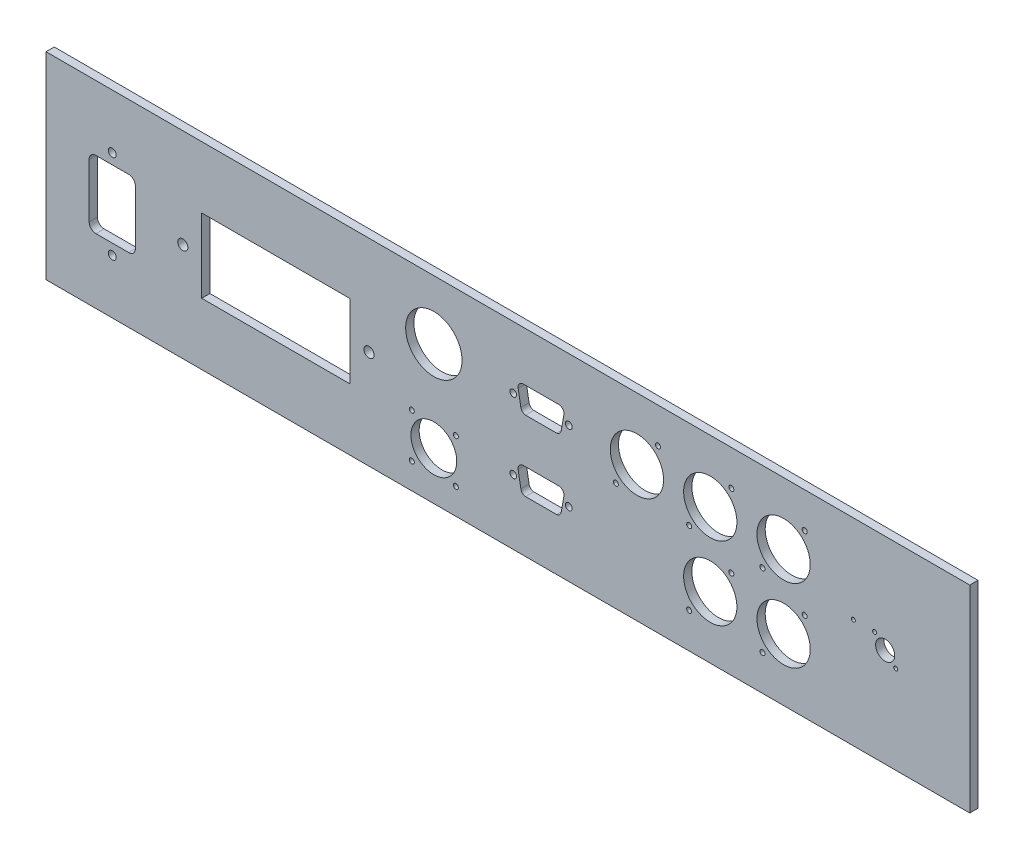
from build123d import *

# Parameters (mm, degrees)
SKETCH1_W             = 415.925
SKETCH1_H             = 88.9
BOSS_EXTRUDE1_DEPTH   = 3.7084
SKETCH2_R             = 4.3053
CUT_EXTRUDE1_DEPTH    = 213.692162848
F_2_56_TAPPED_HOLE1_D = 1.778
SKETCH5_R             = 12
CUT_EXTRUDE2_DEPTH    = 213.692162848
F_4_40_TAPPED_HOLE1_D = 2.2606
LPATTERN2_COUNT       = 2
LPATTERN2_PITCH       = 33.02
LPATTERN2_COUNT_DIR2  = 3
LPATTERN2_PITCH_DIR2  = 33.02
SKETCH10_R            = 1.524
CUT_EXTRUDE3_DEPTH    = 213.692162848
LPATTERN3_COUNT       = 2
LPATTERN3_PITCH       = 31.75
SKETCH11_R            = 12.7
CUT_EXTRUDE4_DEPTH    = 213.692162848
SKETCH12_R            = 10.3251
CUT_EXTRUDE5_DEPTH    = 213.692162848
F_4_40_TAPPED_HOLE2_D = 2.2606
SKETCH15_R            = 1.778
SKETCH15_R_2          = 2.286
SKETCH15_W            = 66.802
SKETCH15_H            = 33.274
CUT_EXTRUDE6_DEPTH    = 213.692162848
SKETCH16_W            = 0.284935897
SKETCH16_H            = 3.175
SKETCH16_W_2          = 0.284935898
CUT_EXTRUDE7_DEPTH    = 1.27


with BuildPart() as part:
    # Sketch1 → Boss-Extrude1 (new body)
    with BuildSketch(Plane.XY):
        Rectangle(SKETCH1_W, SKETCH1_H)
    extrude(amount=BOSS_EXTRUDE1_DEPTH)

    # Sketch2 → Cut-Extrude1 (cut, through all)
    with BuildSketch(Plane(origin=(0, 0, 0), x_dir=(-1, 0, 0), z_dir=(0, 0, -1))):
        with Locations((-169.8625, 0)):
            Circle(SKETCH2_R)
    extrude(amount=-CUT_EXTRUDE1_DEPTH, mode=Mode.SUBTRACT)

    # 2-56 Tapped Hole1 (through all)
    with Locations(Plane(origin=(0, 0, 0), x_dir=(-1, 0, 0), z_dir=(0, 0, -1))):
        with Locations((-174.6123, -4.7498), (-165.1125, 4.75), (-155.5875, 4.75)):
            Hole(F_2_56_TAPPED_HOLE1_D / 2)

    # Sketch5 → Cut-Extrude2 (cut, through all)
    with BuildSketch(Plane(origin=(0, 0, 0), x_dir=(-1, 0, 0), z_dir=(0, 0, -1))):
        with Locations((-124.1425, 16.51)):
            Circle(SKETCH5_R)
    cut_extrude2 = extrude(amount=-CUT_EXTRUDE2_DEPTH, mode=Mode.SUBTRACT)

    # 4-40 Tapped Hole1 (through all)
    with Locations(Plane(origin=(0, 0, 0), x_dir=(-1, 0, 0), z_dir=(0, 0, -1))):
        with Locations((-133.6425, 28.51), (-114.6425, 4.51)):
            f_4_40_tapped_hole1 = Hole(F_4_40_TAPPED_HOLE1_D / 2)

    # LPattern2: Cut-Extrude2, 4-40 Tapped Hole1 2 × 3, 1 skipped
    with Locations(*[(-j * LPATTERN2_PITCH_DIR2, -i * LPATTERN2_PITCH, 0) for i in range(LPATTERN2_COUNT) for j in range(LPATTERN2_COUNT_DIR2) if (i, j) not in ((0, 0), (1, 2))]):
        add(cut_extrude2, mode=Mode.SUBTRACT)
        add(f_4_40_tapped_hole1, mode=Mode.SUBTRACT)

    # Sketch10 → Cut-Extrude3 (cut, symmetric)
    with BuildSketch(Plane(origin=(0, 0, 0), x_dir=(-1, 0, 0), z_dir=(0, 0, -1))):
        with Locations((-27.4193, 16.51)):
            Circle(SKETCH10_R)
        with Locations(Location((-2.4257, 16.51, 0), (0, 0, 180))):
            Circle(SKETCH10_R)
        with BuildLine():
            Line((-6.732640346, 22.327241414), (-23.112359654, 22.327241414))
            ThreePointArc((-23.112359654, 22.327241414), (-24.776519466, 21.392569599), (-25.224026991, 19.537097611))
            Line((-25.224026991, 19.537097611), (-24.010132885, 12.652762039))
            ThreePointArc((-24.010132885, 12.652762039), (-23.296102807, 11.328114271), (-21.932496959, 10.691631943))
            Line((-21.932496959, 10.691631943), (-7.912503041, 10.691631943))
            ThreePointArc((-7.912503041, 10.691631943), (-6.548897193, 11.328114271), (-5.834867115, 12.652762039))
            Line((-5.834867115, 12.652762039), (-4.620973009, 19.537097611))
            ThreePointArc((-4.620973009, 19.537097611), (-5.068480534, 21.392569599), (-6.732640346, 22.327241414))
        make_face()
    cut_extrude3 = extrude(amount=CUT_EXTRUDE3_DEPTH, both=True, mode=Mode.SUBTRACT)

    # LPattern3: Cut-Extrude3 ×2
    with Locations(*[(0, -i * LPATTERN3_PITCH, 0) for i in range(1, LPATTERN3_COUNT)]):
        add(cut_extrude3, mode=Mode.SUBTRACT)

    # Sketch11 → Cut-Extrude4 (cut, through all)
    with BuildSketch(Plane(origin=(0, 0, 0), x_dir=(-1, 0, 0), z_dir=(0, 0, -1))):
        with Locations((33.3375, 17.78)):
            Circle(SKETCH11_R)
    extrude(amount=-CUT_EXTRUDE4_DEPTH, mode=Mode.SUBTRACT)

    # Sketch12 → Cut-Extrude5 (cut, through all)
    with BuildSketch(Plane(origin=(0, 0, 0), x_dir=(-1, 0, 0), z_dir=(0, 0, -1))):
        with Locations((33.3375, -22.86)):
            Circle(SKETCH12_R)
    extrude(amount=-CUT_EXTRUDE5_DEPTH, mode=Mode.SUBTRACT)

    # 4-40 Tapped Hole2 (through all)
    with Locations(Plane(origin=(0, 0, 0), x_dir=(-1, 0, 0), z_dir=(0, 0, -1))):
        with Locations((23.4188, -12.9413), (43.2562, -12.9413), (43.2562, -32.7787), (23.4188, -32.7787)):
            Hole(F_4_40_TAPPED_HOLE2_D / 2)

    # Sketch15 → Cut-Extrude6 (cut, through all)
    with BuildSketch(Plane(origin=(0, 0, 0), x_dir=(-1, 0, 0), z_dir=(0, 0, -1))):
        with Locations((178.1175, 20.0025)):
            Circle(SKETCH15_R)
        with Locations((146.3675, 0)):
            Circle(SKETCH15_R_2)
        with Locations(Location((62.5475, 0, 0), (0, 0, 180))):
            Circle(SKETCH15_R_2)
        with Locations(Location((178.1175, -20.0025, 0), (0, 0, 180))):
            Circle(SKETCH15_R)
        with BuildLine():
            Line((167.7035, -12.192), (167.7035, 12.192))
            ThreePointArc((167.7035, 12.192), (168.596238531, 14.347261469), (170.7515, 15.24))
            Line((170.7515, 15.24), (185.4835, 15.24))
            ThreePointArc((185.4835, 15.24), (187.638761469, 14.347261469), (188.5315, 12.192))
            Line((188.5315, 12.192), (188.5315, -12.192))
            ThreePointArc((188.5315, -12.192), (187.638761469, -14.347261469), (185.4835, -15.24))
            Line((185.4835, -15.24), (170.7515, -15.24))
            ThreePointArc((170.7515, -15.24), (168.596238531, -14.347261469), (167.7035, -12.192))
        make_face()
        with Locations((104.4575, 0)):
            Rectangle(SKETCH15_W, SKETCH15_H)
    extrude(amount=-CUT_EXTRUDE6_DEPTH, mode=Mode.SUBTRACT)

    # Sketch16 → Cut-Extrude7 (cut)
    # profile 1 of 52: a face of its own
    with BuildSketch(Plane(origin=(0, 0, 0), x_dir=(-1, 0, 0), z_dir=(0, 0, -1))):
        Polygon((-176.413625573, 14.969354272), (-174.866830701, 14.969354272), (-174.866830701, 14.643713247), (-176.128689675, 14.643713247), (-176.128689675, 13.66679017), (-174.866830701, 13.66679017), (-174.866830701, 13.341149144), (-176.128689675, 13.341149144), (-176.128689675, 11.794354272), (-176.413625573, 11.794354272), align=None)
    # profile 2 of 52: a face of its own
    with BuildSketch(Plane(origin=(0, 0, 0), x_dir=(-1, 0, 0), z_dir=(0, 0, -1))):
        with Locations((-174.154490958, 13.381854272)):
            Rectangle(SKETCH16_W, SKETCH16_H)
    # profile 3 of 52: a face of its own
    with BuildSketch(Plane(origin=(0, 0, 0), x_dir=(-1, 0, 0), z_dir=(0, 0, -1))):
        with BuildLine():
            Line((-173.197920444, 14.969354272), (-172.578439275, 14.969354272))
            add(Edge.make_bspline(
                [(-172.578439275, 14.969354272), (-172.548114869, 14.969194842), (-172.489338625, 14.968885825), (-172.403868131, 14.964093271), (-172.323813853, 14.957558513), (-172.249152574, 14.947189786), (-172.179918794, 14.934678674), (-172.115903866, 14.919527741), (-172.057311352, 14.901360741), (-171.987359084, 14.872471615), (-171.907602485, 14.82954274), (-171.821243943, 14.766107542), (-171.747398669, 14.688517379), (-171.683729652, 14.600993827), (-171.633110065, 14.50471352), (-171.596489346, 14.401971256), (-171.573304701, 14.294092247), (-171.570920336, 14.220030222), (-171.569715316, 14.182600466)],
                knots=[0, 0, 0, 0, 1.001505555, 1.941167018, 2.826882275, 3.653841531, 4.429895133, 5.150066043, 5.825578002, 6.45369114, 7.647487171, 8.808567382, 9.977351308, 11.170798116, 12.373658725, 13.556498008, 14.765093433, 16, 16, 16, 16], degree=3))
            add(Edge.make_bspline(
                [(-171.569715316, 14.182600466), (-171.570707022, 14.147537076), (-171.572655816, 14.078634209), (-171.591291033, 13.977855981), (-171.620465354, 13.881924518), (-171.661019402, 13.791189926), (-171.713726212, 13.707702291), (-171.776190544, 13.630788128), (-171.851553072, 13.563703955), (-171.908016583, 13.526200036), (-171.936697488, 13.507149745)],
                knots=[0, 0, 0, 0, 1.044552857, 2.05264487, 3.044412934, 4.028983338, 5.005914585, 5.980388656, 6.974128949, 8, 8, 8, 8], degree=3))
            add(Edge.make_bspline(
                [(-171.936697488, 13.507149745), (-171.9006291, 13.49330221), (-171.831621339, 13.466808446), (-171.736656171, 13.419967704), (-171.654836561, 13.369020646), (-171.585533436, 13.313383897), (-171.526262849, 13.253413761), (-171.474507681, 13.188230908), (-171.43034672, 13.116985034), (-171.392507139, 13.04041897), (-171.362980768, 12.959314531), (-171.34086834, 12.87443247), (-171.328197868, 12.786077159), (-171.326394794, 12.725946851), (-171.325484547, 12.695591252)],
                knots=[0, 0, 0, 0, 1.27268992, 2.434971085, 3.483601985, 4.442670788, 5.356604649, 6.2567628, 7.179492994, 8.113709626, 9.066344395, 10.018646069, 10.999752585, 12, 12, 12, 12], degree=3))
            add(Edge.make_bspline(
                [(-171.325484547, 12.695591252), (-171.326370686, 12.664597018), (-171.328114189, 12.603614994), (-171.340977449, 12.514029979), (-171.362757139, 12.42841842), (-171.392757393, 12.346226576), (-171.431911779, 12.267613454), (-171.479562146, 12.192489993), (-171.536377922, 12.121610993), (-171.599934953, 12.054188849), (-171.671837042, 11.993566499), (-171.749412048, 11.939577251), (-171.833636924, 11.89517618), (-171.923128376, 11.857878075), (-172.018890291, 11.82938726), (-172.120492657, 11.809454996), (-172.227847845, 11.796024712), (-172.30151669, 11.794920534), (-172.339296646, 11.794354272)],
                knots=[0, 0, 0, 0, 0.978564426, 1.925352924, 2.850884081, 3.763762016, 4.682927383, 5.618979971, 6.567305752, 7.547517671, 8.540179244, 9.531824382, 10.526200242, 11.540722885, 12.589160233, 13.674978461, 14.80764778, 16, 16, 16, 16], degree=3))
            Line((-172.339296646, 11.794354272), (-173.197920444, 11.794354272))
            Line((-173.197920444, 11.794354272), (-173.197920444, 14.969354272))
        make_face()
        with BuildLine():
            Line((-172.912984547, 14.643713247), (-172.912984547, 13.626085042))
            Line((-172.912984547, 13.626085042), (-172.721543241, 13.626085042))
            add(Edge.make_bspline(
                [(-172.721543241, 13.626085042), (-172.693558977, 13.626447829), (-172.639487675, 13.627148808), (-172.561183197, 13.629156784), (-172.488498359, 13.634779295), (-172.421558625, 13.64040019), (-172.360469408, 13.64953928), (-172.305366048, 13.660417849), (-172.255383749, 13.671923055), (-172.197744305, 13.691489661), (-172.132363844, 13.720407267), (-172.062665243, 13.765285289), (-172.001220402, 13.818738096), (-171.949334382, 13.880415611), (-171.906869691, 13.948329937), (-171.877375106, 14.021397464), (-171.85737507, 14.097797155), (-171.855568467, 14.15024657), (-171.854651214, 14.176876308)],
                knots=[0, 0, 0, 0, 1.156816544, 2.235205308, 3.236616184, 4.169592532, 5.011045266, 5.787822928, 6.49130361, 7.128639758, 8.301311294, 9.436451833, 10.541879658, 11.654887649, 12.756523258, 13.837046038, 14.901820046, 16, 16, 16, 16], degree=3))
            add(Edge.make_bspline(
                [(-171.854651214, 14.176876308), (-171.855128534, 14.194498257), (-171.856064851, 14.229065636), (-171.863733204, 14.279456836), (-171.876766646, 14.326849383), (-171.893507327, 14.371892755), (-171.916901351, 14.413178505), (-171.94444535, 14.452134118), (-171.977724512, 14.487432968), (-172.01560436, 14.520425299), (-172.059155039, 14.549675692), (-172.108350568, 14.575294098), (-172.163856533, 14.595923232), (-172.22473748, 14.613990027), (-172.291930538, 14.626679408), (-172.364660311, 14.637250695), (-172.44352252, 14.64263254), (-172.498082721, 14.643344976), (-172.526285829, 14.643713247)],
                knots=[0, 0, 0, 0, 0.91205012, 1.789085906, 2.630437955, 3.453916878, 4.269457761, 5.079663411, 5.91843418, 6.774407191, 7.675494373, 8.627863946, 9.638891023, 10.736472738, 11.911756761, 13.175263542, 14.539845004, 16, 16, 16, 16], degree=3))
            Line((-172.526285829, 14.643713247), (-172.912984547, 14.643713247))
        make_face(mode=Mode.SUBTRACT)
        with BuildLine():
            Line((-172.912984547, 13.300444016), (-172.912984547, 12.119995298))
            Line((-172.912984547, 12.119995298), (-172.5072053, 12.119995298))
            add(Edge.make_bspline(
                [(-172.5072053, 12.119995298), (-172.47815956, 12.120343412), (-172.422177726, 12.121014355), (-172.341350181, 12.123204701), (-172.266435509, 12.12818698), (-172.197775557, 12.13603), (-172.134628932, 12.144537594), (-172.077753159, 12.155977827), (-172.02668719, 12.169085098), (-171.967474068, 12.189345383), (-171.900795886, 12.220820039), (-171.828940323, 12.268276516), (-171.765053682, 12.324812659), (-171.710801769, 12.390245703), (-171.666339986, 12.461394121), (-171.633995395, 12.536818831), (-171.614046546, 12.615273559), (-171.611631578, 12.668764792), (-171.610420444, 12.695591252)],
                knots=[0, 0, 0, 0, 1.160039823, 2.235823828, 3.228722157, 4.157150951, 4.99529583, 5.772374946, 6.472645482, 7.099169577, 8.269452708, 9.405989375, 10.527446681, 11.663510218, 12.788923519, 13.866172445, 14.929861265, 16, 16, 16, 16], degree=3))
            add(Edge.make_bspline(
                [(-171.610420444, 12.695591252), (-171.610670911, 12.712367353), (-171.611167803, 12.745648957), (-171.618661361, 12.794558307), (-171.629559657, 12.841934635), (-171.643648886, 12.887906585), (-171.664167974, 12.931643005), (-171.688122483, 12.974008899), (-171.716208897, 13.015060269), (-171.759973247, 13.066959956), (-171.823629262, 13.126756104), (-171.914077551, 13.185300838), (-172.016922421, 13.232515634), (-172.091514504, 13.252563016), (-172.130046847, 13.262918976)],
                knots=[0, 0, 0, 0, 0.723448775, 1.435228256, 2.130040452, 2.821711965, 3.505591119, 4.210454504, 4.921174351, 5.648778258, 7.137944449, 8.670945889, 10.280296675, 12, 12, 12, 12], degree=3))
            add(Edge.make_bspline(
                [(-172.130046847, 13.262918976), (-172.145494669, 13.266053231), (-172.178988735, 13.272848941), (-172.233605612, 13.280022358), (-172.295958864, 13.286413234), (-172.366192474, 13.291140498), (-172.444395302, 13.296026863), (-172.530734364, 13.297927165), (-172.624857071, 13.300194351), (-172.690164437, 13.300358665), (-172.724087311, 13.300444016)],
                knots=[0, 0, 0, 0, 0.634451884, 1.375622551, 2.216452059, 3.157844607, 4.20941857, 5.370758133, 6.634282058, 8, 8, 8, 8], degree=3))
            Line((-172.724087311, 13.300444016), (-172.912984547, 13.300444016))
        make_face(mode=Mode.SUBTRACT)
    # profile 4 of 52: a face of its own
    with BuildSketch(Plane(origin=(0, 0, 0), x_dir=(-1, 0, 0), z_dir=(0, 0, -1))):
        Polygon((-170.674202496, 14.969354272), (-168.883176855, 14.969354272), (-168.883176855, 14.643713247), (-170.389266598, 14.643713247), (-170.389266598, 13.66679017), (-168.883176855, 13.66679017), (-168.883176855, 13.341149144), (-170.389266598, 13.341149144), (-170.389266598, 12.119995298), (-168.883176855, 12.119995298), (-168.883176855, 11.794354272), (-170.674202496, 11.794354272), align=None)
    # profile 5 of 52: a face of its own
    with BuildSketch(Plane(origin=(0, 0, 0), x_dir=(-1, 0, 0), z_dir=(0, 0, -1))):
        with BuildLine():
            Line((-168.31330506, 14.969354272), (-167.677923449, 14.969354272))
            add(Edge.make_bspline(
                [(-167.677923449, 14.969354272), (-167.635522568, 14.969213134), (-167.55410818, 14.968942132), (-167.437473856, 14.967431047), (-167.33149499, 14.963100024), (-167.236226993, 14.959372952), (-167.151671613, 14.952576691), (-167.077569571, 14.946080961), (-167.014262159, 14.937577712), (-166.975939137, 14.929680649), (-166.958587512, 14.926105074)],
                knots=[0, 0, 0, 0, 1.410062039, 2.707475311, 3.878576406, 4.937260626, 5.877586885, 6.699081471, 7.410979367, 8, 8, 8, 8], degree=3))
            add(Edge.make_bspline(
                [(-166.958587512, 14.926105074), (-166.935358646, 14.920365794), (-166.889396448, 14.909009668), (-166.823220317, 14.88500703), (-166.760160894, 14.857230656), (-166.700480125, 14.824606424), (-166.644476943, 14.78689216), (-166.591573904, 14.744738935), (-166.541530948, 14.698377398), (-166.496371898, 14.646638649), (-166.453791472, 14.592358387), (-166.417878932, 14.533662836), (-166.38692134, 14.472284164), (-166.3622738, 14.40759815), (-166.342427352, 14.340232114), (-166.328433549, 14.269575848), (-166.320041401, 14.195951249), (-166.319187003, 14.145733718), (-166.318753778, 14.120270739)],
                knots=[0, 0, 0, 0, 1.027469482, 2.033020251, 3.019912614, 3.986113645, 4.951240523, 5.91722682, 6.890402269, 7.87763091, 8.8651537, 9.85103654, 10.82876324, 11.815024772, 12.821070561, 13.842952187, 14.906261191, 16, 16, 16, 16], degree=3))
            add(Edge.make_bspline(
                [(-166.318753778, 14.120270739), (-166.320086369, 14.077966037), (-166.322686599, 13.995418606), (-166.346930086, 13.875620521), (-166.386641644, 13.763870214), (-166.441363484, 13.660308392), (-166.511049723, 13.566953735), (-166.594801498, 13.484956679), (-166.692665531, 13.416340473), (-166.783769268, 13.368758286), (-166.86424572, 13.338284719), (-166.930497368, 13.316843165), (-167.002766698, 13.300276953), (-167.08036128, 13.285435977), (-167.163604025, 13.274231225), (-167.252295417, 13.266024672), (-167.346498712, 13.260895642), (-167.411213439, 13.260131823), (-167.44450498, 13.259738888)],
                knots=[0, 0, 0, 0, 1.260483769, 2.459530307, 3.627416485, 4.787058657, 5.939039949, 7.08810263, 8.267026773, 9.491475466, 10.141966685, 10.831826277, 11.566392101, 12.351337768, 13.187381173, 14.07005841, 15.007169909, 16, 16, 16, 16], degree=3))
            Line((-167.44450498, 13.259738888), (-166.27804865, 11.794354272))
            Line((-166.27804865, 11.794354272), (-166.630402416, 11.794354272))
            Line((-166.630402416, 11.794354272), (-167.796858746, 13.259738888))
            Line((-167.796858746, 13.259738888), (-168.028369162, 13.259738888))
            Line((-168.028369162, 13.259738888), (-168.028369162, 11.794354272))
            Line((-168.028369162, 11.794354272), (-168.31330506, 11.794354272))
            Line((-168.31330506, 11.794354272), (-168.31330506, 14.969354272))
        make_face()
        with BuildLine():
            Line((-168.028369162, 14.643713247), (-168.028369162, 13.585379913))
            Line((-168.028369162, 13.585379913), (-167.44704905, 13.58092779))
            add(Edge.make_bspline(
                [(-167.44704905, 13.58092779), (-167.419907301, 13.580915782), (-167.36729886, 13.580892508), (-167.291188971, 13.584515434), (-167.220322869, 13.588636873), (-167.154971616, 13.594940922), (-167.095106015, 13.603065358), (-167.04075599, 13.613228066), (-166.991832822, 13.625068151), (-166.934774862, 13.643393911), (-166.871060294, 13.672427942), (-166.801816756, 13.714669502), (-166.742850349, 13.76780006), (-166.693032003, 13.828554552), (-166.653000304, 13.895353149), (-166.624777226, 13.967395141), (-166.606868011, 14.042861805), (-166.604755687, 14.094730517), (-166.603689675, 14.120906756)],
                knots=[0, 0, 0, 0, 1.146690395, 2.22261258, 3.21895312, 4.145990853, 4.996080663, 5.770904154, 6.481378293, 7.121626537, 8.300444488, 9.431385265, 10.535395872, 11.636531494, 12.74115979, 13.810798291, 14.895190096, 16, 16, 16, 16], degree=3))
            add(Edge.make_bspline(
                [(-166.603689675, 14.120906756), (-166.604780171, 14.14643972), (-166.606941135, 14.197036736), (-166.624583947, 14.271110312), (-166.654419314, 14.341021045), (-166.694625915, 14.406484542), (-166.743610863, 14.465907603), (-166.801049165, 14.516750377), (-166.865370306, 14.558705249), (-166.92548775, 14.585515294), (-166.979221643, 14.601952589), (-167.025875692, 14.613519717), (-167.078591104, 14.622812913), (-167.137623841, 14.630258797), (-167.202721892, 14.63665864), (-167.274214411, 14.640969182), (-167.351627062, 14.643521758), (-167.405281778, 14.643647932), (-167.433056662, 14.643713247)],
                knots=[0, 0, 0, 0, 1.101028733, 2.181837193, 3.264309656, 4.369019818, 5.486613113, 6.575447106, 7.666700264, 8.788928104, 9.402425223, 10.0903467, 10.862060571, 11.710948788, 12.657782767, 13.684531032, 14.801375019, 16, 16, 16, 16], degree=3))
            Line((-167.433056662, 14.643713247), (-168.028369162, 14.643713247))
        make_face(mode=Mode.SUBTRACT)
    # profile 6 of 52: a face of its own
    with BuildSketch(Plane(origin=(0, 0, 0), x_dir=(-1, 0, 0), z_dir=(0, 0, -1))):
        with Locations((-164.263144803, 13.381854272)):
            Rectangle(SKETCH16_W, SKETCH16_H)
    # profile 7 of 52: a face of its own
    with BuildSketch(Plane(origin=(0, 0, 0), x_dir=(-1, 0, 0), z_dir=(0, 0, -1))):
        Polygon((-163.306574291, 11.794354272), (-163.306574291, 14.969354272), (-163.246788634, 14.969354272), (-161.149202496, 12.470441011), (-161.149202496, 14.969354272), (-160.864266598, 14.969354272), (-160.864266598, 11.794354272), (-160.929140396, 11.794354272), (-163.021638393, 14.287543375), (-163.021638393, 11.794354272), align=None)
    # profile 8 of 52: a face of its own
    with BuildSketch(Plane(origin=(0, 0, 0), x_dir=(-1, 0, 0), z_dir=(0, 0, -1))):
        with BuildLine():
            Line((-128.841003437, 33.98111107), (-128.572603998, 34.14202353))
            add(Edge.make_bspline(
                [(-128.572603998, 34.14202353), (-128.547641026, 34.100236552), (-128.499812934, 34.020174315), (-128.420028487, 33.911990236), (-128.337357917, 33.820040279), (-128.251189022, 33.744859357), (-128.162047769, 33.685669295), (-128.069352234, 33.643757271), (-127.973414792, 33.617617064), (-127.908124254, 33.614441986), (-127.875528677, 33.612856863)],
                knots=[0, 0, 0, 0, 1.272034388, 2.437168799, 3.508375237, 4.49857839, 5.41946034, 6.295179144, 7.148887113, 8, 8, 8, 8], degree=3))
            add(Edge.make_bspline(
                [(-127.875528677, 33.612856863), (-127.847691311, 33.613632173), (-127.792503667, 33.615169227), (-127.711257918, 33.62993824), (-127.632352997, 33.652627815), (-127.557415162, 33.685122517), (-127.487478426, 33.724436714), (-127.426149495, 33.771922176), (-127.373130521, 33.825086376), (-127.329760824, 33.884397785), (-127.296486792, 33.948185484), (-127.270912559, 34.013659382), (-127.256720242, 34.081848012), (-127.25458233, 34.127758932), (-127.253503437, 34.150927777)],
                knots=[0, 0, 0, 0, 1.095163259, 2.171163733, 3.241058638, 4.321873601, 5.38011039, 6.391990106, 7.366004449, 8.327778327, 9.272591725, 10.192022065, 11.087607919, 12, 12, 12, 12], degree=3))
            add(Edge.make_bspline(
                [(-127.253503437, 34.150927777), (-127.254840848, 34.17736269), (-127.257559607, 34.231101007), (-127.280538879, 34.310384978), (-127.316687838, 34.388846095), (-127.350036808, 34.437379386), (-127.367350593, 34.462576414)],
                knots=[0, 0, 0, 0, 0.938893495, 1.908633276, 2.914225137, 4, 4, 4, 4], degree=3))
            add(Edge.make_bspline(
                [(-127.367350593, 34.462576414), (-127.381566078, 34.480761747), (-127.411409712, 34.518939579), (-127.462715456, 34.575767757), (-127.522919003, 34.634385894), (-127.589960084, 34.697032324), (-127.666280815, 34.760793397), (-127.749490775, 34.82870962), (-127.841714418, 34.898198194), (-127.906393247, 34.94480045), (-127.939766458, 34.968846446)],
                knots=[0, 0, 0, 0, 0.722233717, 1.516239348, 2.393582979, 3.351407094, 4.387010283, 5.505090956, 6.712668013, 8, 8, 8, 8], degree=3))
            add(Edge.make_bspline(
                [(-127.939766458, 34.968846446), (-127.973171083, 34.992639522), (-128.037038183, 35.038130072), (-128.126354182, 35.105643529), (-128.206223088, 35.16736904), (-128.27628991, 35.223887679), (-128.33652383, 35.275207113), (-128.387399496, 35.32083453), (-128.427620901, 35.362003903), (-128.449987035, 35.388711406), (-128.460028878, 35.400702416)],
                knots=[0, 0, 0, 0, 1.452282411, 2.77665338, 3.964542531, 5.026858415, 5.96415736, 6.766646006, 7.446254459, 8, 8, 8, 8], degree=3))
            add(Edge.make_bspline(
                [(-128.460028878, 35.400702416), (-128.474064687, 35.419390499), (-128.501667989, 35.456143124), (-128.538104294, 35.513587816), (-128.569073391, 35.572391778), (-128.59335065, 35.632713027), (-128.61379422, 35.693704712), (-128.627544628, 35.756162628), (-128.636154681, 35.819806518), (-128.637036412, 35.862635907), (-128.637477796, 35.884075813)],
                knots=[0, 0, 0, 0, 1.068054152, 2.10047183, 3.106115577, 4.101338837, 5.06977816, 6.043150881, 7.020423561, 8, 8, 8, 8], degree=3))
            add(Edge.make_bspline(
                [(-128.637477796, 35.884075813), (-128.636293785, 35.917667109), (-128.63395107, 35.98413171), (-128.614138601, 36.081223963), (-128.582866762, 36.173921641), (-128.539056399, 36.261307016), (-128.482580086, 36.341104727), (-128.417224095, 36.414232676), (-128.339380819, 36.475708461), (-128.253970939, 36.529422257), (-128.160484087, 36.571464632), (-128.06252091, 36.603179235), (-127.959925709, 36.621149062), (-127.890435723, 36.623727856), (-127.855176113, 36.62503635)],
                knots=[0, 0, 0, 0, 1.005424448, 1.989358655, 2.955360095, 3.929531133, 4.905563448, 5.876582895, 6.856512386, 7.866279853, 8.892233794, 9.918561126, 10.94386622, 12, 12, 12, 12], degree=3))
            add(Edge.make_bspline(
                [(-127.855176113, 36.62503635), (-127.817761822, 36.623745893), (-127.743356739, 36.621179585), (-127.633910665, 36.59886611), (-127.528536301, 36.561944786), (-127.443769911, 36.520045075), (-127.377428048, 36.478197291), (-127.326834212, 36.440079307), (-127.27556481, 36.396196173), (-127.223206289, 36.346431), (-127.170645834, 36.290327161), (-127.117103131, 36.228268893), (-127.062452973, 36.160635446), (-127.027295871, 36.112353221), (-127.009272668, 36.087601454)],
                knots=[0, 0, 0, 0, 1.286793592, 2.559021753, 3.825965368, 5.121522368, 5.803751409, 6.523245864, 7.299691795, 8.125521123, 9.008227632, 9.944561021, 10.946284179, 12, 12, 12, 12], degree=3))
            Line((-127.009272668, 36.087601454), (-127.266859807, 35.892344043))
            add(Edge.make_bspline(
                [(-127.266859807, 35.892344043), (-127.282413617, 35.91238164), (-127.312366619, 35.950969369), (-127.357841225, 36.005009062), (-127.400702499, 36.054372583), (-127.442930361, 36.097248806), (-127.482294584, 36.135985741), (-127.520500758, 36.169150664), (-127.556999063, 36.197068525), (-127.603006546, 36.226862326), (-127.660807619, 36.256395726), (-127.73336502, 36.281386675), (-127.809189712, 36.296404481), (-127.86083302, 36.298390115), (-127.886976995, 36.299395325)],
                knots=[0, 0, 0, 0, 1.181633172, 2.275549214, 3.290209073, 4.226197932, 5.078386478, 5.862611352, 6.581680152, 7.217281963, 8.414376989, 9.595101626, 10.782541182, 12, 12, 12, 12], degree=3))
            add(Edge.make_bspline(
                [(-127.886976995, 36.299395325), (-127.919776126, 36.29829614), (-127.98302616, 36.296176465), (-128.072824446, 36.273026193), (-128.153645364, 36.236575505), (-128.223089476, 36.185489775), (-128.28090802, 36.124964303), (-128.322732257, 36.055314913), (-128.347905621, 35.978405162), (-128.35097746, 35.924755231), (-128.352541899, 35.897432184)],
                knots=[0, 0, 0, 0, 1.14458467, 2.207223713, 3.21896685, 4.227309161, 5.202851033, 6.127160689, 7.046193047, 8, 8, 8, 8], degree=3))
            add(Edge.make_bspline(
                [(-128.352541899, 35.897432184), (-128.352185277, 35.880421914), (-128.351471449, 35.846373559), (-128.34151574, 35.796071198), (-128.328725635, 35.745895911), (-128.308457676, 35.696073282), (-128.280476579, 35.645731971), (-128.243732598, 35.594005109), (-128.197456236, 35.540436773), (-128.162007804, 35.505595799), (-128.143292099, 35.487200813)],
                knots=[0, 0, 0, 0, 0.858281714, 1.717966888, 2.583508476, 3.4729293, 4.427298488, 5.488583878, 6.674047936, 8, 8, 8, 8], degree=3))
            add(Edge.make_bspline(
                [(-128.143292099, 35.487200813), (-128.13634214, 35.480998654), (-128.119830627, 35.466263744), (-128.089644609, 35.442140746), (-128.049782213, 35.412383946), (-128.00128436, 35.375565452), (-127.943256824, 35.33285584), (-127.875693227, 35.284801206), (-127.799346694, 35.229841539), (-127.745170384, 35.191417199), (-127.71652427, 35.171100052)],
                knots=[0, 0, 0, 0, 0.420754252, 0.999615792, 1.744751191, 2.668019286, 3.750313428, 4.999500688, 6.413464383, 8, 8, 8, 8], degree=3))
            add(Edge.make_bspline(
                [(-127.71652427, 35.171100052), (-127.682065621, 35.14602539), (-127.615341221, 35.097471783), (-127.520401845, 35.024523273), (-127.434319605, 34.953178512), (-127.35679227, 34.883893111), (-127.287053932, 34.817192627), (-127.225878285, 34.752274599), (-127.172641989, 34.689604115), (-127.115329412, 34.609256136), (-127.056766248, 34.510576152), (-127.00647288, 34.38967375), (-126.974760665, 34.268301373), (-126.970613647, 34.186724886), (-126.96856754, 34.146475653)],
                knots=[0, 0, 0, 0, 1.163667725, 2.253281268, 3.268753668, 4.215851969, 5.092017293, 5.902905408, 6.650798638, 7.335211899, 8.59617414, 9.77448103, 10.901945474, 12, 12, 12, 12], degree=3))
            add(Edge.make_bspline(
                [(-126.96856754, 34.146475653), (-126.969163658, 34.118010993), (-126.970344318, 34.061634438), (-126.983916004, 33.978853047), (-127.003800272, 33.898452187), (-127.033769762, 33.821425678), (-127.070348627, 33.746364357), (-127.116763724, 33.67523719), (-127.170564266, 33.606469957), (-127.23228061, 33.541896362), (-127.299813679, 33.482618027), (-127.37119103, 33.429886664), (-127.446529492, 33.38591897), (-127.525420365, 33.350040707), (-127.607881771, 33.321979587), (-127.693885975, 33.301647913), (-127.783574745, 33.289169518), (-127.844535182, 33.287874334), (-127.875528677, 33.287215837)],
                knots=[0, 0, 0, 0, 0.983748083, 1.948392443, 2.894712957, 3.844097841, 4.80183111, 5.778335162, 6.776009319, 7.81870978, 8.863265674, 9.881300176, 10.883814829, 11.87499822, 12.874611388, 13.892143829, 14.928324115, 16, 16, 16, 16], degree=3))
            add(Edge.make_bspline(
                [(-127.875528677, 33.287215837), (-127.89950931, 33.287679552), (-127.947168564, 33.288601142), (-128.017662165, 33.296748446), (-128.08673165, 33.308275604), (-128.15351032, 33.326576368), (-128.218858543, 33.348780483), (-128.282492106, 33.376120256), (-128.344441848, 33.408883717), (-128.405054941, 33.446344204), (-128.464177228, 33.489939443), (-128.521254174, 33.540715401), (-128.578158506, 33.59727168), (-128.633210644, 33.66114412), (-128.687524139, 33.73130081), (-128.740028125, 33.80839814), (-128.791809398, 33.892016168), (-128.824299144, 33.950858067), (-128.841003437, 33.98111107)],
                knots=[0, 0, 0, 0, 0.915332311, 1.819136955, 2.706846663, 3.586547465, 4.459518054, 5.340707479, 6.227863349, 7.133153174, 8.059268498, 9.028702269, 10.047606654, 11.120612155, 12.245963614, 13.433783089, 14.680604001, 16, 16, 16, 16], degree=3))
        make_face()
    # profile 9 of 52: a face of its own
    with BuildSketch(Plane(origin=(0, 0, 0), x_dir=(-1, 0, 0), z_dir=(0, 0, -1))):
        with BuildLine():
            Line((-126.317285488, 33.368626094), (-126.317285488, 36.543626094))
            Line((-126.317285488, 36.543626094), (-125.676179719, 36.543626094))
            add(Edge.make_bspline(
                [(-125.676179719, 36.543626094), (-125.620418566, 36.54322462), (-125.512688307, 36.542448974), (-125.357011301, 36.537530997), (-125.212971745, 36.528831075), (-125.081043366, 36.516158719), (-124.960863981, 36.500598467), (-124.8527701, 36.481094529), (-124.756202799, 36.458063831), (-124.696812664, 36.438428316), (-124.668727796, 36.429142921)],
                knots=[0, 0, 0, 0, 1.314313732, 2.53924729, 3.670748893, 4.714932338, 5.66265055, 6.526160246, 7.303039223, 8, 8, 8, 8], degree=3))
            add(Edge.make_bspline(
                [(-124.668727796, 36.429142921), (-124.631993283, 36.415145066), (-124.559357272, 36.387466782), (-124.455936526, 36.335254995), (-124.358577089, 36.276097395), (-124.266756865, 36.209916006), (-124.182573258, 36.134836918), (-124.102737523, 36.054049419), (-124.030515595, 35.96461571), (-123.964377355, 35.868390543), (-123.904745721, 35.766507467), (-123.852912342, 35.659160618), (-123.809864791, 35.546895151), (-123.774129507, 35.430023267), (-123.745965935, 35.308287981), (-123.726750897, 35.181547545), (-123.714077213, 35.050302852), (-123.712803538, 34.961244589), (-123.712157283, 34.916056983)],
                knots=[0, 0, 0, 0, 0.984719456, 1.947108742, 2.898477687, 3.838006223, 4.779231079, 5.722358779, 6.681677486, 7.655904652, 8.64651281, 9.637519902, 10.640069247, 11.656948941, 12.698408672, 13.768548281, 14.867775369, 16, 16, 16, 16], degree=3))
            add(Edge.make_bspline(
                [(-123.712157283, 34.916056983), (-123.712727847, 34.87681286), (-123.713852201, 34.799478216), (-123.723948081, 34.685503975), (-123.738622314, 34.574910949), (-123.761340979, 34.468225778), (-123.788920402, 34.364513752), (-123.824266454, 34.264880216), (-123.864757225, 34.168411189), (-123.911973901, 34.07641105), (-123.9638093, 33.989249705), (-124.019436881, 33.907084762), (-124.078797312, 33.831088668), (-124.142456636, 33.761031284), (-124.209592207, 33.697018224), (-124.280643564, 33.638514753), (-124.355794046, 33.586665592), (-124.434707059, 33.539433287), (-124.519684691, 33.498230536), (-124.612336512, 33.463369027), (-124.713057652, 33.434479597), (-124.821600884, 33.410375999), (-124.938153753, 33.391255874), (-125.06283053, 33.378441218), (-125.195439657, 33.369775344), (-125.28649799, 33.369016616), (-125.333366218, 33.368626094)],
                knots=[0, 0, 0, 0, 1.105936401, 2.179363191, 3.223086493, 4.248585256, 5.251745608, 6.245858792, 7.225916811, 8.198733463, 9.158002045, 10.082870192, 10.993790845, 11.873723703, 12.748670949, 13.606408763, 14.465103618, 15.319838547, 16.196477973, 17.123216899, 18.106603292, 19.147568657, 20.255746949, 21.433717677, 22.679120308, 24, 24, 24, 24], degree=3))
            Line((-125.333366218, 33.368626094), (-126.317285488, 33.368626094))
        make_face()
        with BuildLine():
            Line((-126.032349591, 33.69426712), (-125.66791149, 33.69426712))
            add(Edge.make_bspline(
                [(-125.66791149, 33.69426712), (-125.615543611, 33.694492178), (-125.514821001, 33.694925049), (-125.369988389, 33.69872344), (-125.237654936, 33.704930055), (-125.117801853, 33.713616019), (-125.01049681, 33.725108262), (-124.915515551, 33.737921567), (-124.833169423, 33.753884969), (-124.783340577, 33.768354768), (-124.760314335, 33.775041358)],
                knots=[0, 0, 0, 0, 1.375205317, 2.645023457, 3.804390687, 4.853969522, 5.800190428, 6.637939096, 7.370582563, 8, 8, 8, 8], degree=3))
            add(Edge.make_bspline(
                [(-124.760314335, 33.775041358), (-124.731332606, 33.785248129), (-124.674061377, 33.805417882), (-124.59161925, 33.842209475), (-124.514732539, 33.885790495), (-124.442061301, 33.934233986), (-124.374636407, 33.989248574), (-124.311658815, 34.049637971), (-124.253255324, 34.115709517), (-124.200029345, 34.187381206), (-124.152396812, 34.264206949), (-124.111147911, 34.345431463), (-124.074996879, 34.430164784), (-124.046622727, 34.519708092), (-124.02438359, 34.61326088), (-124.008631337, 34.710829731), (-123.998820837, 34.812396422), (-123.997676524, 34.881477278), (-123.997093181, 34.916693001)],
                knots=[0, 0, 0, 0, 0.998632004, 1.973411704, 2.929992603, 3.868527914, 4.809262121, 5.754881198, 6.702106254, 7.672490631, 8.653608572, 9.636854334, 10.631411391, 11.644891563, 12.686317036, 13.754757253, 14.855430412, 16, 16, 16, 16], degree=3))
            add(Edge.make_bspline(
                [(-123.997093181, 34.916693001), (-123.997558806, 34.953825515), (-123.99847353, 35.026772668), (-124.00997094, 35.133807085), (-124.026772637, 35.236750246), (-124.051069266, 35.335609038), (-124.082030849, 35.430576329), (-124.120670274, 35.521126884), (-124.16481785, 35.608217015), (-124.217344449, 35.689836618), (-124.274871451, 35.767028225), (-124.338714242, 35.837744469), (-124.40785852, 35.902146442), (-124.481550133, 35.961237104), (-124.56186593, 36.012639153), (-124.646913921, 36.058619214), (-124.73794178, 36.097640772), (-124.801271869, 36.118395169), (-124.833456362, 36.1289426)],
                knots=[0, 0, 0, 0, 1.122418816, 2.205001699, 3.251619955, 4.274784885, 5.280384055, 6.268708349, 7.249350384, 8.229342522, 9.199999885, 10.157847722, 11.105861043, 12.055065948, 13.010012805, 13.98527497, 14.976112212, 16, 16, 16, 16], degree=3))
            add(Edge.make_bspline(
                [(-124.833456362, 36.1289426), (-124.860082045, 36.13630536), (-124.916695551, 36.151960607), (-125.009078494, 36.169037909), (-125.113050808, 36.184100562), (-125.229074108, 36.196853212), (-125.357016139, 36.206003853), (-125.496975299, 36.212872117), (-125.649012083, 36.217504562), (-125.754406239, 36.21782089), (-125.809107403, 36.217985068)],
                knots=[0, 0, 0, 0, 0.674548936, 1.434276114, 2.292660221, 3.240891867, 4.284742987, 5.42552168, 6.663806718, 8, 8, 8, 8], degree=3))
            Line((-125.809107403, 36.217985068), (-126.032349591, 36.217985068))
            Line((-126.032349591, 36.217985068), (-126.032349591, 33.69426712))
        make_face(mode=Mode.SUBTRACT)
    # profile 10 of 52: a face of its own
    with BuildSketch(Plane(origin=(0, 0, 0), x_dir=(-1, 0, 0), z_dir=(0, 0, -1))):
        with Locations((-122.918407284, 34.956126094)):
            Rectangle(SKETCH16_W, SKETCH16_H)
    # profile 11 of 52: a face of its own
    with BuildSketch(Plane(origin=(0, 0, 0), x_dir=(-1, 0, 0), z_dir=(0, 0, -1))):
        Polygon((-120.350804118, 36.543626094), (-119.763759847, 36.543626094), (-119.763759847, 33.368626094), (-120.048695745, 33.368626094), (-120.048695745, 36.217985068), (-120.537157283, 36.217985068), align=None)
    # profile 12 of 52: a face of its own
    with BuildSketch(Plane(origin=(0, 0, 0), x_dir=(-1, 0, 0), z_dir=(0, 0, -1))):
        with BuildLine():
            Line((-96.116559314, 33.98111107), (-95.848159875, 34.14202353))
            add(Edge.make_bspline(
                [(-95.848159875, 34.14202353), (-95.823196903, 34.100236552), (-95.775368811, 34.020174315), (-95.695584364, 33.911990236), (-95.612913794, 33.820040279), (-95.526744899, 33.744859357), (-95.437603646, 33.685669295), (-95.344908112, 33.643757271), (-95.248970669, 33.617617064), (-95.183680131, 33.614441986), (-95.151084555, 33.612856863)],
                knots=[0, 0, 0, 0, 1.272034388, 2.437168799, 3.508375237, 4.49857839, 5.41946034, 6.295179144, 7.148887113, 8, 8, 8, 8], degree=3))
            add(Edge.make_bspline(
                [(-95.151084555, 33.612856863), (-95.123247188, 33.613632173), (-95.068059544, 33.615169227), (-94.986813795, 33.62993824), (-94.907908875, 33.652627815), (-94.832971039, 33.685122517), (-94.763034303, 33.724436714), (-94.701705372, 33.771922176), (-94.648686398, 33.825086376), (-94.605316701, 33.884397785), (-94.572042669, 33.948185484), (-94.546468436, 34.013659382), (-94.532276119, 34.081848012), (-94.530138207, 34.127758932), (-94.529059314, 34.150927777)],
                knots=[0, 0, 0, 0, 1.095163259, 2.171163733, 3.241058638, 4.321873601, 5.38011039, 6.391990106, 7.366004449, 8.327778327, 9.272591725, 10.192022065, 11.087607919, 12, 12, 12, 12], degree=3))
            add(Edge.make_bspline(
                [(-94.529059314, 34.150927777), (-94.530396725, 34.17736269), (-94.533115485, 34.231101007), (-94.556094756, 34.310384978), (-94.592243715, 34.388846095), (-94.625592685, 34.437379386), (-94.64290647, 34.462576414)],
                knots=[0, 0, 0, 0, 0.938893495, 1.908633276, 2.914225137, 4, 4, 4, 4], degree=3))
            add(Edge.make_bspline(
                [(-94.64290647, 34.462576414), (-94.657121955, 34.480761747), (-94.686965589, 34.518939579), (-94.738271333, 34.575767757), (-94.79847488, 34.634385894), (-94.865515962, 34.697032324), (-94.941836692, 34.760793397), (-95.025046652, 34.82870962), (-95.117270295, 34.898198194), (-95.181949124, 34.94480045), (-95.215322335, 34.968846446)],
                knots=[0, 0, 0, 0, 0.722233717, 1.516239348, 2.393582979, 3.351407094, 4.387010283, 5.505090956, 6.712668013, 8, 8, 8, 8], degree=3))
            add(Edge.make_bspline(
                [(-95.215322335, 34.968846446), (-95.24872696, 34.992639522), (-95.31259406, 35.038130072), (-95.401910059, 35.105643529), (-95.481778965, 35.16736904), (-95.551845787, 35.223887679), (-95.612079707, 35.275207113), (-95.662955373, 35.32083453), (-95.703176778, 35.362003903), (-95.725542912, 35.388711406), (-95.735584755, 35.400702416)],
                knots=[0, 0, 0, 0, 1.452282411, 2.77665338, 3.964542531, 5.026858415, 5.96415736, 6.766646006, 7.446254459, 8, 8, 8, 8], degree=3))
            add(Edge.make_bspline(
                [(-95.735584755, 35.400702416), (-95.749620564, 35.419390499), (-95.777223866, 35.456143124), (-95.813660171, 35.513587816), (-95.844629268, 35.572391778), (-95.868906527, 35.632713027), (-95.889350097, 35.693704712), (-95.903100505, 35.756162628), (-95.911710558, 35.819806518), (-95.912592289, 35.862635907), (-95.913033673, 35.884075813)],
                knots=[0, 0, 0, 0, 1.068054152, 2.10047183, 3.106115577, 4.101338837, 5.06977816, 6.043150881, 7.020423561, 8, 8, 8, 8], degree=3))
            add(Edge.make_bspline(
                [(-95.913033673, 35.884075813), (-95.911849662, 35.917667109), (-95.909506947, 35.98413171), (-95.889694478, 36.081223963), (-95.858422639, 36.173921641), (-95.814612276, 36.261307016), (-95.758135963, 36.341104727), (-95.692779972, 36.414232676), (-95.614936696, 36.475708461), (-95.529526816, 36.529422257), (-95.436039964, 36.571464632), (-95.338076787, 36.603179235), (-95.235481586, 36.621149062), (-95.1659916, 36.623727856), (-95.13073199, 36.62503635)],
                knots=[0, 0, 0, 0, 1.005424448, 1.989358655, 2.955360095, 3.929531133, 4.905563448, 5.876582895, 6.856512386, 7.866279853, 8.892233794, 9.918561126, 10.94386622, 12, 12, 12, 12], degree=3))
            add(Edge.make_bspline(
                [(-95.13073199, 36.62503635), (-95.093317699, 36.623745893), (-95.018912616, 36.621179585), (-94.909466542, 36.59886611), (-94.804092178, 36.561944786), (-94.719325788, 36.520045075), (-94.652983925, 36.478197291), (-94.602390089, 36.440079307), (-94.551120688, 36.396196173), (-94.498762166, 36.346431), (-94.446201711, 36.290327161), (-94.392659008, 36.228268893), (-94.33800885, 36.160635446), (-94.302851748, 36.112353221), (-94.284828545, 36.087601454)],
                knots=[0, 0, 0, 0, 1.286793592, 2.559021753, 3.825965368, 5.121522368, 5.803751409, 6.523245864, 7.299691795, 8.125521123, 9.008227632, 9.944561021, 10.946284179, 12, 12, 12, 12], degree=3))
            Line((-94.284828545, 36.087601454), (-94.542415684, 35.892344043))
            add(Edge.make_bspline(
                [(-94.542415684, 35.892344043), (-94.557969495, 35.91238164), (-94.587922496, 35.950969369), (-94.633397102, 36.005009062), (-94.676258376, 36.054372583), (-94.718486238, 36.097248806), (-94.757850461, 36.135985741), (-94.796056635, 36.169150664), (-94.83255494, 36.197068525), (-94.878562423, 36.226862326), (-94.936363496, 36.256395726), (-95.008920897, 36.281386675), (-95.084745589, 36.296404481), (-95.136388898, 36.298390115), (-95.162532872, 36.299395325)],
                knots=[0, 0, 0, 0, 1.181633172, 2.275549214, 3.290209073, 4.226197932, 5.078386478, 5.862611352, 6.581680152, 7.217281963, 8.414376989, 9.595101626, 10.782541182, 12, 12, 12, 12], degree=3))
            add(Edge.make_bspline(
                [(-95.162532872, 36.299395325), (-95.195332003, 36.29829614), (-95.258582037, 36.296176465), (-95.348380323, 36.273026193), (-95.429201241, 36.236575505), (-95.498645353, 36.185489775), (-95.556463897, 36.124964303), (-95.598288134, 36.055314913), (-95.623461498, 35.978405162), (-95.626533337, 35.924755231), (-95.628097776, 35.897432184)],
                knots=[0, 0, 0, 0, 1.14458467, 2.207223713, 3.21896685, 4.227309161, 5.202851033, 6.127160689, 7.046193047, 8, 8, 8, 8], degree=3))
            add(Edge.make_bspline(
                [(-95.628097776, 35.897432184), (-95.627741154, 35.880421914), (-95.627027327, 35.846373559), (-95.617071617, 35.796071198), (-95.604281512, 35.745895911), (-95.584013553, 35.696073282), (-95.556032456, 35.645731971), (-95.519288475, 35.594005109), (-95.473012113, 35.540436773), (-95.437563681, 35.505595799), (-95.418847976, 35.487200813)],
                knots=[0, 0, 0, 0, 0.858281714, 1.717966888, 2.583508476, 3.4729293, 4.427298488, 5.488583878, 6.674047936, 8, 8, 8, 8], degree=3))
            add(Edge.make_bspline(
                [(-95.418847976, 35.487200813), (-95.411898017, 35.480998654), (-95.395386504, 35.466263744), (-95.365200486, 35.442140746), (-95.325338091, 35.412383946), (-95.276840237, 35.375565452), (-95.218812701, 35.33285584), (-95.151249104, 35.284801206), (-95.074902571, 35.229841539), (-95.020726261, 35.191417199), (-94.992080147, 35.171100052)],
                knots=[0, 0, 0, 0, 0.420754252, 0.999615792, 1.744751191, 2.668019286, 3.750313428, 4.999500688, 6.413464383, 8, 8, 8, 8], degree=3))
            add(Edge.make_bspline(
                [(-94.992080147, 35.171100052), (-94.957621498, 35.14602539), (-94.890897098, 35.097471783), (-94.795957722, 35.024523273), (-94.709875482, 34.953178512), (-94.632348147, 34.883893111), (-94.562609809, 34.817192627), (-94.501434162, 34.752274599), (-94.448197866, 34.689604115), (-94.390885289, 34.609256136), (-94.332322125, 34.510576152), (-94.282028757, 34.38967375), (-94.250316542, 34.268301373), (-94.246169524, 34.186724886), (-94.244123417, 34.146475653)],
                knots=[0, 0, 0, 0, 1.163667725, 2.253281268, 3.268753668, 4.215851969, 5.092017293, 5.902905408, 6.650798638, 7.335211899, 8.59617414, 9.77448103, 10.901945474, 12, 12, 12, 12], degree=3))
            add(Edge.make_bspline(
                [(-94.244123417, 34.146475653), (-94.244719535, 34.118010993), (-94.245900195, 34.061634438), (-94.259471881, 33.978853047), (-94.279356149, 33.898452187), (-94.30932564, 33.821425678), (-94.345904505, 33.746364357), (-94.392319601, 33.67523719), (-94.446120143, 33.606469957), (-94.507836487, 33.541896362), (-94.575369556, 33.482618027), (-94.646746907, 33.429886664), (-94.722085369, 33.38591897), (-94.800976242, 33.350040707), (-94.883437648, 33.321979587), (-94.969441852, 33.301647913), (-95.059130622, 33.289169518), (-95.120091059, 33.287874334), (-95.151084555, 33.287215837)],
                knots=[0, 0, 0, 0, 0.983748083, 1.948392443, 2.894712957, 3.844097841, 4.80183111, 5.778335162, 6.776009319, 7.81870978, 8.863265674, 9.881300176, 10.883814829, 11.87499822, 12.874611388, 13.892143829, 14.928324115, 16, 16, 16, 16], degree=3))
            add(Edge.make_bspline(
                [(-95.151084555, 33.287215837), (-95.175065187, 33.287679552), (-95.222724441, 33.288601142), (-95.293218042, 33.296748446), (-95.362287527, 33.308275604), (-95.429066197, 33.326576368), (-95.49441442, 33.348780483), (-95.558047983, 33.376120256), (-95.619997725, 33.408883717), (-95.680610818, 33.446344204), (-95.739733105, 33.489939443), (-95.796810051, 33.540715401), (-95.853714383, 33.59727168), (-95.908766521, 33.66114412), (-95.963080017, 33.73130081), (-96.015584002, 33.80839814), (-96.067365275, 33.892016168), (-96.099855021, 33.950858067), (-96.116559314, 33.98111107)],
                knots=[0, 0, 0, 0, 0.915332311, 1.819136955, 2.706846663, 3.586547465, 4.459518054, 5.340707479, 6.227863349, 7.133153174, 8.059268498, 9.028702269, 10.047606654, 11.120612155, 12.245963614, 13.433783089, 14.680604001, 16, 16, 16, 16], degree=3))
        make_face()
    # profile 13 of 52: a face of its own
    with BuildSketch(Plane(origin=(0, 0, 0), x_dir=(-1, 0, 0), z_dir=(0, 0, -1))):
        with BuildLine():
            Line((-93.592841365, 33.368626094), (-93.592841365, 36.543626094))
            Line((-93.592841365, 36.543626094), (-92.951735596, 36.543626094))
            add(Edge.make_bspline(
                [(-92.951735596, 36.543626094), (-92.895974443, 36.54322462), (-92.788244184, 36.542448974), (-92.632567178, 36.537530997), (-92.488527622, 36.528831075), (-92.356599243, 36.516158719), (-92.236419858, 36.500598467), (-92.128325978, 36.481094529), (-92.031758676, 36.458063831), (-91.972368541, 36.438428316), (-91.944283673, 36.429142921)],
                knots=[0, 0, 0, 0, 1.314313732, 2.53924729, 3.670748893, 4.714932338, 5.66265055, 6.526160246, 7.303039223, 8, 8, 8, 8], degree=3))
            add(Edge.make_bspline(
                [(-91.944283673, 36.429142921), (-91.90754916, 36.415145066), (-91.834913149, 36.387466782), (-91.731492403, 36.335254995), (-91.634132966, 36.276097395), (-91.542312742, 36.209916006), (-91.458129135, 36.134836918), (-91.3782934, 36.054049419), (-91.306071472, 35.96461571), (-91.239933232, 35.868390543), (-91.180301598, 35.766507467), (-91.128468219, 35.659160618), (-91.085420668, 35.546895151), (-91.049685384, 35.430023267), (-91.021521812, 35.308287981), (-91.002306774, 35.181547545), (-90.98963309, 35.050302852), (-90.988359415, 34.961244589), (-90.98771316, 34.916056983)],
                knots=[0, 0, 0, 0, 0.984719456, 1.947108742, 2.898477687, 3.838006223, 4.779231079, 5.722358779, 6.681677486, 7.655904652, 8.64651281, 9.637519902, 10.640069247, 11.656948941, 12.698408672, 13.768548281, 14.867775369, 16, 16, 16, 16], degree=3))
            add(Edge.make_bspline(
                [(-90.98771316, 34.916056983), (-90.988283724, 34.87681286), (-90.989408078, 34.799478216), (-90.999503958, 34.685503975), (-91.014178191, 34.574910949), (-91.036896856, 34.468225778), (-91.064476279, 34.364513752), (-91.099822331, 34.264880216), (-91.140313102, 34.168411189), (-91.187529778, 34.07641105), (-91.239365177, 33.989249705), (-91.294992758, 33.907084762), (-91.354353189, 33.831088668), (-91.418012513, 33.761031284), (-91.485148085, 33.697018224), (-91.556199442, 33.638514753), (-91.631349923, 33.586665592), (-91.710262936, 33.539433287), (-91.795240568, 33.498230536), (-91.887892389, 33.463369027), (-91.988613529, 33.434479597), (-92.097156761, 33.410375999), (-92.213709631, 33.391255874), (-92.338386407, 33.378441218), (-92.470995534, 33.369775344), (-92.562053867, 33.369016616), (-92.608922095, 33.368626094)],
                knots=[0, 0, 0, 0, 1.105936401, 2.179363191, 3.223086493, 4.248585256, 5.251745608, 6.245858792, 7.225916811, 8.198733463, 9.158002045, 10.082870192, 10.993790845, 11.873723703, 12.748670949, 13.606408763, 14.465103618, 15.319838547, 16.196477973, 17.123216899, 18.106603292, 19.147568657, 20.255746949, 21.433717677, 22.679120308, 24, 24, 24, 24], degree=3))
            Line((-92.608922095, 33.368626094), (-93.592841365, 33.368626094))
        make_face()
        with BuildLine():
            Line((-93.307905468, 33.69426712), (-92.943467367, 33.69426712))
            add(Edge.make_bspline(
                [(-92.943467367, 33.69426712), (-92.891099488, 33.694492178), (-92.790376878, 33.694925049), (-92.645544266, 33.69872344), (-92.513210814, 33.704930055), (-92.39335773, 33.713616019), (-92.286052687, 33.725108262), (-92.191071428, 33.737921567), (-92.108725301, 33.753884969), (-92.058896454, 33.768354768), (-92.035870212, 33.775041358)],
                knots=[0, 0, 0, 0, 1.375205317, 2.645023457, 3.804390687, 4.853969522, 5.800190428, 6.637939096, 7.370582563, 8, 8, 8, 8], degree=3))
            add(Edge.make_bspline(
                [(-92.035870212, 33.775041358), (-92.006888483, 33.785248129), (-91.949617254, 33.805417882), (-91.867175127, 33.842209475), (-91.790288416, 33.885790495), (-91.717617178, 33.934233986), (-91.650192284, 33.989248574), (-91.587214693, 34.049637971), (-91.528811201, 34.115709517), (-91.475585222, 34.187381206), (-91.427952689, 34.264206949), (-91.386703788, 34.345431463), (-91.350552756, 34.430164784), (-91.322178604, 34.519708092), (-91.299939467, 34.61326088), (-91.284187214, 34.710829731), (-91.274376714, 34.812396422), (-91.273232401, 34.881477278), (-91.272649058, 34.916693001)],
                knots=[0, 0, 0, 0, 0.998632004, 1.973411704, 2.929992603, 3.868527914, 4.809262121, 5.754881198, 6.702106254, 7.672490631, 8.653608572, 9.636854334, 10.631411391, 11.644891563, 12.686317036, 13.754757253, 14.855430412, 16, 16, 16, 16], degree=3))
            add(Edge.make_bspline(
                [(-91.272649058, 34.916693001), (-91.273114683, 34.953825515), (-91.274029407, 35.026772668), (-91.285526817, 35.133807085), (-91.302328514, 35.236750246), (-91.326625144, 35.335609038), (-91.357586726, 35.430576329), (-91.396226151, 35.521126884), (-91.440373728, 35.608217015), (-91.492900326, 35.689836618), (-91.550427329, 35.767028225), (-91.614270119, 35.837744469), (-91.683414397, 35.902146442), (-91.75710601, 35.961237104), (-91.837421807, 36.012639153), (-91.922469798, 36.058619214), (-92.013497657, 36.097640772), (-92.076827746, 36.118395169), (-92.109012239, 36.1289426)],
                knots=[0, 0, 0, 0, 1.122418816, 2.205001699, 3.251619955, 4.274784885, 5.280384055, 6.268708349, 7.249350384, 8.229342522, 9.199999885, 10.157847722, 11.105861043, 12.055065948, 13.010012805, 13.98527497, 14.976112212, 16, 16, 16, 16], degree=3))
            add(Edge.make_bspline(
                [(-92.109012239, 36.1289426), (-92.135637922, 36.13630536), (-92.192251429, 36.151960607), (-92.284634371, 36.169037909), (-92.388606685, 36.184100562), (-92.504629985, 36.196853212), (-92.632572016, 36.206003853), (-92.772531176, 36.212872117), (-92.92456796, 36.217504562), (-93.029962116, 36.21782089), (-93.084663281, 36.217985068)],
                knots=[0, 0, 0, 0, 0.674548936, 1.434276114, 2.292660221, 3.240891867, 4.284742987, 5.42552168, 6.663806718, 8, 8, 8, 8], degree=3))
            Line((-93.084663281, 36.217985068), (-93.307905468, 36.217985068))
            Line((-93.307905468, 36.217985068), (-93.307905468, 33.69426712))
        make_face(mode=Mode.SUBTRACT)
    # profile 14 of 52: a face of its own
    with BuildSketch(Plane(origin=(0, 0, 0), x_dir=(-1, 0, 0), z_dir=(0, 0, -1))):
        with Locations((-90.193963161, 34.956126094)):
            Rectangle(SKETCH16_W, SKETCH16_H)
    # profile 15 of 52: a face of its own
    with BuildSketch(Plane(origin=(0, 0, 0), x_dir=(-1, 0, 0), z_dir=(0, 0, -1))):
        with BuildLine():
            Line((-87.894123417, 35.566703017), (-88.179059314, 35.566703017))
            add(Edge.make_bspline(
                [(-88.179059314, 35.566703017), (-88.177202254, 35.604504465), (-88.173555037, 35.678745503), (-88.156475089, 35.786989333), (-88.132035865, 35.890453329), (-88.097481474, 35.988306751), (-88.054567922, 36.081414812), (-88.003105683, 36.169407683), (-87.942151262, 36.25194969), (-87.873020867, 36.328275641), (-87.797937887, 36.398295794), (-87.716924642, 36.458761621), (-87.631793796, 36.509849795), (-87.542803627, 36.552559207), (-87.448950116, 36.584617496), (-87.351084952, 36.608404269), (-87.248778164, 36.622715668), (-87.179073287, 36.624253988), (-87.143622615, 36.62503635)],
                knots=[0, 0, 0, 0, 1.10065271, 2.161652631, 3.183658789, 4.190468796, 5.17591951, 6.163126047, 7.15150782, 8.156236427, 9.156009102, 10.134482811, 11.092018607, 12.041330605, 13.001268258, 13.972401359, 14.968799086, 16, 16, 16, 16], degree=3))
            add(Edge.make_bspline(
                [(-87.143622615, 36.62503635), (-87.10880822, 36.624221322), (-87.040399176, 36.62261982), (-86.940557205, 36.608866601), (-86.845509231, 36.587325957), (-86.755441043, 36.557104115), (-86.671071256, 36.516478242), (-86.591766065, 36.467676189), (-86.51658133, 36.411233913), (-86.448902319, 36.34478224), (-86.386755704, 36.273841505), (-86.333141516, 36.19810605), (-86.287228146, 36.119883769), (-86.248957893, 36.038578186), (-86.220785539, 35.953423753), (-86.199396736, 35.865660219), (-86.187306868, 35.774379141), (-86.185451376, 35.712596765), (-86.184508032, 35.68118619)],
                knots=[0, 0, 0, 0, 1.111607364, 2.184268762, 3.212621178, 4.221274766, 5.211760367, 6.196651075, 7.1921475, 8.207485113, 9.220403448, 10.201281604, 11.166441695, 12.114753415, 13.065576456, 14.026450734, 14.996634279, 16, 16, 16, 16], degree=3))
            add(Edge.make_bspline(
                [(-86.184508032, 35.68118619), (-86.186044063, 35.63696494), (-86.189089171, 35.549298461), (-86.215137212, 35.420470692), (-86.255819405, 35.295653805), (-86.304802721, 35.195199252), (-86.35421701, 35.114251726), (-86.398746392, 35.047605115), (-86.450875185, 34.975845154), (-86.511362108, 34.899212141), (-86.578955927, 34.81710582), (-86.65426889, 34.729575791), (-86.737838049, 34.6375264), (-86.796492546, 34.574656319), (-86.826885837, 34.542078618)],
                knots=[0, 0, 0, 0, 1.184426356, 2.348067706, 3.509069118, 4.696110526, 5.333549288, 6.050745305, 6.844228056, 7.710549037, 8.667450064, 9.695053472, 10.805634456, 12, 12, 12, 12], degree=3))
            Line((-86.826885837, 34.542078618), (-87.621271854, 33.69426712))
            Line((-87.621271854, 33.69426712), (-86.143802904, 33.69426712))
            Line((-86.143802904, 33.69426712), (-86.143802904, 33.368626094))
            Line((-86.143802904, 33.368626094), (-88.301174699, 33.368626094))
            Line((-88.301174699, 33.368626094), (-87.069844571, 34.682638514))
            add(Edge.make_bspline(
                [(-87.069844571, 34.682638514), (-87.039865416, 34.713933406), (-86.982281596, 34.77404449), (-86.900835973, 34.861804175), (-86.82768489, 34.94321983), (-86.762354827, 35.018137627), (-86.706263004, 35.087653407), (-86.656486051, 35.149515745), (-86.616602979, 35.206442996), (-86.573318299, 35.272429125), (-86.531395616, 35.352994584), (-86.495370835, 35.451450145), (-86.473404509, 35.552802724), (-86.470769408, 35.621293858), (-86.46944393, 35.655745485)],
                knots=[0, 0, 0, 0, 1.329631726, 2.553950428, 3.673215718, 4.687767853, 5.603093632, 6.413772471, 7.123043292, 7.734684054, 8.834405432, 9.900288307, 10.943827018, 12, 12, 12, 12], degree=3))
            add(Edge.make_bspline(
                [(-86.46944393, 35.655745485), (-86.470020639, 35.677409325), (-86.471157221, 35.720104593), (-86.481188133, 35.782702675), (-86.496346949, 35.84308647), (-86.518068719, 35.901441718), (-86.546740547, 35.957181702), (-86.581641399, 36.010374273), (-86.621909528, 36.061799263), (-86.668492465, 36.110016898), (-86.719665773, 36.154177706), (-86.77372627, 36.193297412), (-86.830921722, 36.225990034), (-86.891010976, 36.252790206), (-86.953826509, 36.273813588), (-87.019489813, 36.288381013), (-87.087819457, 36.297527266), (-87.134476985, 36.298764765), (-87.158251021, 36.299395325)],
                knots=[0, 0, 0, 0, 0.991446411, 1.95395049, 2.89581595, 3.838931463, 4.798493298, 5.75982156, 6.748411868, 7.785213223, 8.824556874, 9.840280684, 10.836137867, 11.835679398, 12.848801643, 13.863922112, 14.911575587, 16, 16, 16, 16], degree=3))
            add(Edge.make_bspline(
                [(-87.158251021, 36.299395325), (-87.183080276, 36.298746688), (-87.231840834, 36.297472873), (-87.303431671, 36.288562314), (-87.371726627, 36.273190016), (-87.436897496, 36.252165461), (-87.499054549, 36.225442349), (-87.557895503, 36.192157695), (-87.613288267, 36.152439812), (-87.66533697, 36.107408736), (-87.713292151, 36.057273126), (-87.755426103, 36.001384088), (-87.792241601, 35.940762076), (-87.824362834, 35.875570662), (-87.850448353, 35.805218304), (-87.87038114, 35.729954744), (-87.886153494, 35.650106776), (-87.891422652, 35.594966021), (-87.894123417, 35.566703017)],
                knots=[0, 0, 0, 0, 1.031018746, 2.02475058, 2.990194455, 3.934040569, 4.864654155, 5.795059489, 6.735614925, 7.690564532, 8.649604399, 9.611025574, 10.590972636, 11.591080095, 12.624614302, 13.701020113, 14.821632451, 16, 16, 16, 16], degree=3))
        make_face()
    # profile 16 of 52: a face of its own
    with BuildSketch(Plane(origin=(0, 0, 0), x_dir=(-1, 0, 0), z_dir=(0, 0, -1))):
        Polygon((-68.51158684, 33.368626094), (-68.092451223, 36.543626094), (-68.051746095, 36.543626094), (-66.740913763, 33.938497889), (-65.433261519, 36.543626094), (-65.391920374, 36.543626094), (-64.970240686, 33.368626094), (-65.256448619, 33.368626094), (-65.560465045, 35.653201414), (-66.706568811, 33.368626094), (-66.770806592, 33.368626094), (-67.921362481, 35.658289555), (-68.22474289, 33.368626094), align=None)
    # profile 17 of 52: a face of its own
    with BuildSketch(Plane(origin=(0, 0, 0), x_dir=(-1, 0, 0), z_dir=(0, 0, -1))):
        with BuildLine():
            add(Edge.make_bspline(
                [(-62.833221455, 36.62503635), (-62.774431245, 36.623547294), (-62.658962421, 36.620622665), (-62.489258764, 36.598235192), (-62.327247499, 36.559504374), (-62.171608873, 36.507921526), (-62.02420453, 36.439110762), (-61.883924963, 36.355939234), (-61.751103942, 36.25753559), (-61.627531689, 36.144660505), (-61.514450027, 36.021848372), (-61.414822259, 35.890786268), (-61.331326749, 35.75226664), (-61.262759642, 35.606705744), (-61.208967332, 35.454432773), (-61.171847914, 35.294635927), (-61.148136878, 35.128350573), (-61.145364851, 35.014933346), (-61.143958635, 34.957398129)],
                knots=[0, 0, 0, 0, 1.065120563, 2.091984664, 3.0946048, 4.079830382, 5.057816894, 6.036188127, 7.030412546, 8.04752943, 9.064399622, 10.05169764, 11.02544977, 11.989514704, 12.962713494, 13.945757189, 14.957906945, 16, 16, 16, 16], degree=3))
            add(Edge.make_bspline(
                [(-61.143958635, 34.957398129), (-61.145364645, 34.900286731), (-61.148136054, 34.78771355), (-61.171874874, 34.622483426), (-61.209104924, 34.463651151), (-61.262260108, 34.31148188), (-61.330500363, 34.16581509), (-61.41455184, 34.027034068), (-61.51355851, 33.895093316), (-61.626231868, 33.771438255), (-61.749059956, 33.658047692), (-61.880804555, 33.559242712), (-62.018502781, 33.474221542), (-62.163926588, 33.406382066), (-62.315147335, 33.352160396), (-62.473518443, 33.315191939), (-62.638297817, 33.291345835), (-62.750666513, 33.28860761), (-62.80778075, 33.287215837)],
                knots=[0, 0, 0, 0, 1.043624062, 2.057103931, 3.04512605, 4.022047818, 4.998200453, 5.980619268, 6.982898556, 8.009068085, 9.034988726, 10.034168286, 11.015286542, 11.987931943, 12.962482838, 13.94673481, 14.956375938, 16, 16, 16, 16], degree=3))
            add(Edge.make_bspline(
                [(-62.80778075, 33.287215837), (-62.865315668, 33.288621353), (-62.978732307, 33.291391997), (-63.145226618, 33.315142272), (-63.305135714, 33.352281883), (-63.458002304, 33.4053583), (-63.603911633, 33.473953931), (-63.743149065, 33.557596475), (-63.87515572, 33.656844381), (-63.998837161, 33.769481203), (-64.112002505, 33.89210111), (-64.210662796, 34.02348647), (-64.294324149, 34.161059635), (-64.362689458, 34.305202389), (-64.416813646, 34.455217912), (-64.453738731, 34.612106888), (-64.477629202, 34.774974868), (-64.480382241, 34.88586664), (-64.481779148, 34.942133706)],
                knots=[0, 0, 0, 0, 1.053102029, 2.075944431, 3.073151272, 4.055350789, 5.033113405, 6.020478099, 7.024410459, 8.052272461, 9.079885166, 10.07527673, 11.055994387, 12.023226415, 12.992069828, 13.970394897, 14.97016774, 16, 16, 16, 16], degree=3))
            add(Edge.make_bspline(
                [(-64.481779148, 34.942133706), (-64.481294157, 34.979900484), (-64.480330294, 35.054957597), (-64.468726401, 35.166415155), (-64.451888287, 35.276080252), (-64.427756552, 35.38364104), (-64.396195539, 35.488834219), (-64.358955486, 35.592385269), (-64.313471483, 35.693244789), (-64.262054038, 35.79189058), (-64.204666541, 35.886784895), (-64.141279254, 35.976482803), (-64.074118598, 36.061736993), (-64.000491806, 36.140338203), (-63.922825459, 36.21457302), (-63.839859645, 36.283300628), (-63.752100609, 36.347140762), (-63.659170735, 36.404672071), (-63.563359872, 36.456705), (-63.464593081, 36.501356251), (-63.364211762, 36.539679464), (-63.26174576, 36.570740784), (-63.157467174, 36.595262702), (-63.051148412, 36.611960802), (-62.942874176, 36.62359429), (-62.869929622, 36.624553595), (-62.833221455, 36.62503635)],
                knots=[0, 0, 0, 0, 1.037015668, 2.060948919, 3.074880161, 4.083647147, 5.086022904, 6.090072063, 7.104153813, 8.122640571, 9.144368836, 10.147691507, 11.138137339, 12.123020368, 13.103399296, 14.087645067, 15.080126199, 16.082011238, 17.087798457, 18.072939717, 19.057185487, 20.037253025, 21.01195951, 21.997135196, 22.992090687, 24, 24, 24, 24], degree=3))
        make_face()
        with BuildLine():
            add(Edge.make_bspline(
                [(-62.819229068, 36.299395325), (-62.849359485, 36.299028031), (-62.909332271, 36.298296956), (-62.998490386, 36.288666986), (-63.086475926, 36.274942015), (-63.173307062, 36.255364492), (-63.258620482, 36.228690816), (-63.343211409, 36.197992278), (-63.426308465, 36.16059886), (-63.507637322, 36.118350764), (-63.586481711, 36.071588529), (-63.660878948, 36.019906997), (-63.731021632, 35.964518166), (-63.796738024, 35.90529277), (-63.857835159, 35.841929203), (-63.915515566, 35.775388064), (-63.967467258, 35.70376742), (-64.015079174, 35.629009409), (-64.057685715, 35.551211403), (-64.095572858, 35.471192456), (-64.126564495, 35.38829984), (-64.151839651, 35.303432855), (-64.172794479, 35.216725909), (-64.186069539, 35.127521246), (-64.195805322, 35.036267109), (-64.19649461, 34.974597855), (-64.19684325, 34.943405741)],
                knots=[0, 0, 0, 0, 1.008559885, 2.007477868, 2.99961109, 3.989939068, 4.984837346, 5.991145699, 7.001802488, 8.033829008, 9.059044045, 10.069351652, 11.065060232, 12.050310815, 13.029377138, 14.011219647, 14.996725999, 15.989392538, 16.977580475, 17.965360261, 18.951710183, 19.937753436, 20.929683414, 21.935841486, 22.955955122, 24, 24, 24, 24], degree=3))
            add(Edge.make_bspline(
                [(-64.19684325, 34.943405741), (-64.195686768, 34.897538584), (-64.193411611, 34.807303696), (-64.173492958, 34.675071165), (-64.142811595, 34.547991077), (-64.097583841, 34.426758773), (-64.041022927, 34.310332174), (-63.971148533, 34.199744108), (-63.888363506, 34.094964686), (-63.794325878, 33.996725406), (-63.691525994, 33.907058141), (-63.582367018, 33.828351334), (-63.468018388, 33.761757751), (-63.348181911, 33.707506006), (-63.223497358, 33.664516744), (-63.093161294, 33.635053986), (-62.958041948, 33.615663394), (-62.86593914, 33.613801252), (-62.819229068, 33.612856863)],
                knots=[0, 0, 0, 0, 1.032063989, 2.030389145, 3.003944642, 3.970395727, 4.937377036, 5.913328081, 6.909231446, 7.93887556, 8.970685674, 9.976071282, 10.964166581, 11.944589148, 12.933237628, 13.927779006, 14.949070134, 16, 16, 16, 16], degree=3))
            add(Edge.make_bspline(
                [(-62.819229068, 33.612856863), (-62.787833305, 33.613288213), (-62.72556608, 33.614143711), (-62.632950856, 33.622760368), (-62.542004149, 33.636577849), (-62.452853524, 33.656472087), (-62.365600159, 33.681370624), (-62.279879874, 33.710950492), (-62.19660571, 33.747854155), (-62.114727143, 33.788628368), (-62.03635341, 33.835110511), (-61.96153632, 33.885037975), (-61.892161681, 33.940345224), (-61.826494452, 33.998690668), (-61.765146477, 34.06125073), (-61.708532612, 34.127944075), (-61.656843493, 34.199191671), (-61.609249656, 34.273836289), (-61.56679241, 34.351847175), (-61.529799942, 34.43215624), (-61.498416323, 34.514565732), (-61.473081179, 34.599194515), (-61.453227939, 34.685881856), (-61.439548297, 34.774743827), (-61.429979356, 34.865602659), (-61.429258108, 34.927056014), (-61.428894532, 34.958034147)],
                knots=[0, 0, 0, 0, 1.047197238, 2.076906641, 3.100256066, 4.114471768, 5.12198147, 6.126382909, 7.136867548, 8.15857795, 9.17633901, 10.174870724, 11.156907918, 12.133735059, 13.104061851, 14.077631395, 15.04955518, 16.038496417, 17.029181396, 18.010275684, 18.986308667, 19.968651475, 20.955262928, 21.950658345, 22.966943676, 24, 24, 24, 24], degree=3))
            add(Edge.make_bspline(
                [(-61.428894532, 34.958034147), (-61.429258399, 34.988800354), (-61.429980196, 35.049830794), (-61.439543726, 35.140055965), (-61.453242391, 35.228278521), (-61.472984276, 35.314152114), (-61.498429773, 35.397698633), (-61.529805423, 35.478839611), (-61.566803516, 35.557877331), (-61.609265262, 35.634616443), (-61.656995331, 35.708253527), (-61.709150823, 35.778650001), (-61.766632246, 35.844483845), (-61.827797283, 35.907380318), (-61.894173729, 35.965997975), (-61.96546091, 36.020356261), (-62.040793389, 36.071767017), (-62.120555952, 36.118145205), (-62.202873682, 36.160975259), (-62.287341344, 36.197670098), (-62.373002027, 36.228850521), (-62.4596379, 36.255445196), (-62.547978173, 36.274865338), (-62.637425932, 36.288679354), (-62.727857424, 36.298293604), (-62.788675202, 36.299026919), (-62.819229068, 36.299395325)],
                knots=[0, 0, 0, 0, 1.02996197, 2.043119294, 3.035359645, 4.018872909, 4.991431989, 5.957985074, 6.929999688, 7.912076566, 8.892894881, 9.867085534, 10.843653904, 11.817741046, 12.803660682, 13.806313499, 14.818574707, 15.856120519, 16.894564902, 17.924820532, 18.937903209, 19.946497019, 20.957711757, 21.963978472, 22.977135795, 24, 24, 24, 24], degree=3))
        make_face(mode=Mode.SUBTRACT)
    # profile 18 of 52: a face of its own
    with BuildSketch(Plane(origin=(0, 0, 0), x_dir=(-1, 0, 0), z_dir=(0, 0, -1))):
        Polygon((-60.492676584, 33.368626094), (-60.492676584, 36.543626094), (-60.432890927, 36.543626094), (-58.335304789, 34.044712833), (-58.335304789, 36.543626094), (-58.050368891, 36.543626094), (-58.050368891, 33.368626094), (-58.115242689, 33.368626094), (-60.207740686, 35.861815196), (-60.207740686, 33.368626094), align=None)
    # profile 19 of 52: a face of its own
    with BuildSketch(Plane(origin=(0, 0, 0), x_dir=(-1, 0, 0), z_dir=(0, 0, -1))):
        with Locations((-57.093798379, 34.956126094)):
            Rectangle(SKETCH16_W, SKETCH16_H)
    # profile 20 of 52: a face of its own
    with BuildSketch(Plane(origin=(0, 0, 0), x_dir=(-1, 0, 0), z_dir=(0, 0, -1))):
        Polygon((-56.503574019, 36.217985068), (-56.503574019, 36.543626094), (-54.834663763, 36.543626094), (-54.834663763, 36.217985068), (-55.526650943, 36.217985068), (-55.526650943, 33.368626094), (-55.81158684, 33.368626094), (-55.81158684, 36.217985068), align=None)
    # profile 21 of 52: a face of its own
    with BuildSketch(Plane(origin=(0, 0, 0), x_dir=(-1, 0, 0), z_dir=(0, 0, -1))):
        with BuildLine():
            add(Edge.make_bspline(
                [(-52.860465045, 36.62503635), (-52.801674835, 36.623547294), (-52.686206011, 36.620622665), (-52.516502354, 36.598235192), (-52.354491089, 36.559504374), (-52.198852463, 36.507921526), (-52.05144812, 36.439110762), (-51.911168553, 36.355939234), (-51.778347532, 36.25753559), (-51.654775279, 36.144660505), (-51.541693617, 36.021848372), (-51.442065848, 35.890786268), (-51.358570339, 35.75226664), (-51.290003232, 35.606705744), (-51.236210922, 35.454432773), (-51.199091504, 35.294635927), (-51.175380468, 35.128350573), (-51.172608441, 35.014933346), (-51.171202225, 34.957398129)],
                knots=[0, 0, 0, 0, 1.065120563, 2.091984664, 3.0946048, 4.079830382, 5.057816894, 6.036188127, 7.030412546, 8.04752943, 9.064399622, 10.05169764, 11.02544977, 11.989514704, 12.962713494, 13.945757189, 14.957906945, 16, 16, 16, 16], degree=3))
            add(Edge.make_bspline(
                [(-51.171202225, 34.957398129), (-51.172608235, 34.900286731), (-51.175379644, 34.78771355), (-51.199118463, 34.622483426), (-51.236348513, 34.463651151), (-51.289503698, 34.31148188), (-51.357743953, 34.16581509), (-51.44179543, 34.027034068), (-51.5408021, 33.895093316), (-51.653475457, 33.771438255), (-51.776303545, 33.658047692), (-51.908048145, 33.559242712), (-52.045746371, 33.474221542), (-52.191170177, 33.406382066), (-52.342390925, 33.352160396), (-52.500762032, 33.315191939), (-52.665541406, 33.291345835), (-52.777910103, 33.28860761), (-52.83502434, 33.287215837)],
                knots=[0, 0, 0, 0, 1.043624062, 2.057103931, 3.04512605, 4.022047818, 4.998200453, 5.980619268, 6.982898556, 8.009068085, 9.034988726, 10.034168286, 11.015286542, 11.987931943, 12.962482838, 13.94673481, 14.956375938, 16, 16, 16, 16], degree=3))
            add(Edge.make_bspline(
                [(-52.83502434, 33.287215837), (-52.892559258, 33.288621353), (-53.005975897, 33.291391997), (-53.172470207, 33.315142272), (-53.332379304, 33.352281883), (-53.485245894, 33.4053583), (-53.631155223, 33.473953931), (-53.770392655, 33.557596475), (-53.90239931, 33.656844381), (-54.026080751, 33.769481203), (-54.139246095, 33.89210111), (-54.237906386, 34.02348647), (-54.321567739, 34.161059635), (-54.389933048, 34.305202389), (-54.444057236, 34.455217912), (-54.480982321, 34.612106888), (-54.504872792, 34.774974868), (-54.507625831, 34.88586664), (-54.509022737, 34.942133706)],
                knots=[0, 0, 0, 0, 1.053102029, 2.075944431, 3.073151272, 4.055350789, 5.033113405, 6.020478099, 7.024410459, 8.052272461, 9.079885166, 10.07527673, 11.055994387, 12.023226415, 12.992069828, 13.970394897, 14.97016774, 16, 16, 16, 16], degree=3))
            add(Edge.make_bspline(
                [(-54.509022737, 34.942133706), (-54.508537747, 34.979900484), (-54.507573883, 35.054957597), (-54.495969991, 35.166415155), (-54.479131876, 35.276080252), (-54.455000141, 35.38364104), (-54.423439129, 35.488834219), (-54.386199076, 35.592385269), (-54.340715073, 35.693244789), (-54.289297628, 35.79189058), (-54.231910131, 35.886784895), (-54.168522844, 35.976482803), (-54.101362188, 36.061736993), (-54.027735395, 36.140338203), (-53.950069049, 36.21457302), (-53.867103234, 36.283300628), (-53.779344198, 36.347140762), (-53.686414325, 36.404672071), (-53.590603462, 36.456705), (-53.49183667, 36.501356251), (-53.391455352, 36.539679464), (-53.28898935, 36.570740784), (-53.184710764, 36.595262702), (-53.078392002, 36.611960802), (-52.970117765, 36.62359429), (-52.897173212, 36.624553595), (-52.860465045, 36.62503635)],
                knots=[0, 0, 0, 0, 1.037015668, 2.060948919, 3.074880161, 4.083647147, 5.086022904, 6.090072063, 7.104153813, 8.122640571, 9.144368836, 10.147691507, 11.138137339, 12.123020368, 13.103399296, 14.087645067, 15.080126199, 16.082011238, 17.087798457, 18.072939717, 19.057185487, 20.037253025, 21.01195951, 21.997135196, 22.992090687, 24, 24, 24, 24], degree=3))
        make_face()
        with BuildLine():
            add(Edge.make_bspline(
                [(-52.846472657, 36.299395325), (-52.876603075, 36.299028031), (-52.936575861, 36.298296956), (-53.025733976, 36.288666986), (-53.113719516, 36.274942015), (-53.200550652, 36.255364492), (-53.285864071, 36.228690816), (-53.370454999, 36.197992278), (-53.453552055, 36.16059886), (-53.534880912, 36.118350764), (-53.613725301, 36.071588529), (-53.688122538, 36.019906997), (-53.758265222, 35.964518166), (-53.823981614, 35.90529277), (-53.885078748, 35.841929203), (-53.942759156, 35.775388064), (-53.994710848, 35.70376742), (-54.042322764, 35.629009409), (-54.084929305, 35.551211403), (-54.122816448, 35.471192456), (-54.153808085, 35.38829984), (-54.17908324, 35.303432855), (-54.200038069, 35.216725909), (-54.213313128, 35.127521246), (-54.223048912, 35.036267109), (-54.2237382, 34.974597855), (-54.22408684, 34.943405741)],
                knots=[0, 0, 0, 0, 1.008559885, 2.007477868, 2.99961109, 3.989939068, 4.984837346, 5.991145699, 7.001802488, 8.033829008, 9.059044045, 10.069351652, 11.065060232, 12.050310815, 13.029377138, 14.011219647, 14.996725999, 15.989392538, 16.977580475, 17.965360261, 18.951710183, 19.937753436, 20.929683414, 21.935841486, 22.955955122, 24, 24, 24, 24], degree=3))
            add(Edge.make_bspline(
                [(-54.22408684, 34.943405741), (-54.222930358, 34.897538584), (-54.2206552, 34.807303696), (-54.200736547, 34.675071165), (-54.170055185, 34.547991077), (-54.124827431, 34.426758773), (-54.068266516, 34.310332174), (-53.998392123, 34.199744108), (-53.915607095, 34.094964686), (-53.821569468, 33.996725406), (-53.718769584, 33.907058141), (-53.609610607, 33.828351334), (-53.495261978, 33.761757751), (-53.375425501, 33.707506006), (-53.250740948, 33.664516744), (-53.120404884, 33.635053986), (-52.985285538, 33.615663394), (-52.89318273, 33.613801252), (-52.846472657, 33.612856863)],
                knots=[0, 0, 0, 0, 1.032063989, 2.030389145, 3.003944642, 3.970395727, 4.937377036, 5.913328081, 6.909231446, 7.93887556, 8.970685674, 9.976071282, 10.964166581, 11.944589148, 12.933237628, 13.927779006, 14.949070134, 16, 16, 16, 16], degree=3))
            add(Edge.make_bspline(
                [(-52.846472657, 33.612856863), (-52.815076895, 33.613288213), (-52.752809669, 33.614143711), (-52.660194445, 33.622760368), (-52.569247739, 33.636577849), (-52.480097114, 33.656472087), (-52.392843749, 33.681370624), (-52.307123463, 33.710950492), (-52.2238493, 33.747854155), (-52.141970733, 33.788628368), (-52.063596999, 33.835110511), (-51.988779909, 33.885037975), (-51.919405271, 33.940345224), (-51.853738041, 33.998690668), (-51.792390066, 34.06125073), (-51.735776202, 34.127944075), (-51.684087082, 34.199191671), (-51.636493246, 34.273836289), (-51.594036, 34.351847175), (-51.557043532, 34.43215624), (-51.525659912, 34.514565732), (-51.500324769, 34.599194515), (-51.480471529, 34.685881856), (-51.466791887, 34.774743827), (-51.457222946, 34.865602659), (-51.456501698, 34.927056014), (-51.456138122, 34.958034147)],
                knots=[0, 0, 0, 0, 1.047197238, 2.076906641, 3.100256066, 4.114471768, 5.12198147, 6.126382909, 7.136867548, 8.15857795, 9.17633901, 10.174870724, 11.156907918, 12.133735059, 13.104061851, 14.077631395, 15.04955518, 16.038496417, 17.029181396, 18.010275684, 18.986308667, 19.968651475, 20.955262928, 21.950658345, 22.966943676, 24, 24, 24, 24], degree=3))
            add(Edge.make_bspline(
                [(-51.456138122, 34.958034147), (-51.456501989, 34.988800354), (-51.457223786, 35.049830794), (-51.466787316, 35.140055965), (-51.480485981, 35.228278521), (-51.500227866, 35.314152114), (-51.525673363, 35.397698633), (-51.557049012, 35.478839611), (-51.594047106, 35.557877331), (-51.636508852, 35.634616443), (-51.68423892, 35.708253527), (-51.736394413, 35.778650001), (-51.793875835, 35.844483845), (-51.855040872, 35.907380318), (-51.921417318, 35.965997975), (-51.992704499, 36.020356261), (-52.068036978, 36.071767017), (-52.147799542, 36.118145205), (-52.230117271, 36.160975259), (-52.314584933, 36.197670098), (-52.400245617, 36.228850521), (-52.48688149, 36.255445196), (-52.575221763, 36.274865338), (-52.664669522, 36.288679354), (-52.755101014, 36.298293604), (-52.815918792, 36.299026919), (-52.846472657, 36.299395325)],
                knots=[0, 0, 0, 0, 1.02996197, 2.043119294, 3.035359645, 4.018872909, 4.991431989, 5.957985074, 6.929999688, 7.912076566, 8.892894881, 9.867085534, 10.843653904, 11.817741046, 12.803660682, 13.806313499, 14.818574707, 15.856120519, 16.894564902, 17.924820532, 18.937903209, 19.946497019, 20.957711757, 21.963978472, 22.977135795, 24, 24, 24, 24], degree=3))
        make_face(mode=Mode.SUBTRACT)
    # profile 22 of 52: a face of its own
    with BuildSketch(Plane(origin=(0, 0, 0), x_dir=(-1, 0, 0), z_dir=(0, 0, -1))):
        with BuildLine():
            Line((-50.519920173, 36.543626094), (-49.884538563, 36.543626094))
            add(Edge.make_bspline(
                [(-49.884538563, 36.543626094), (-49.842137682, 36.543484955), (-49.760723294, 36.543213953), (-49.64408897, 36.541702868), (-49.538110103, 36.537371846), (-49.442842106, 36.533644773), (-49.358286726, 36.526848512), (-49.284184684, 36.520352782), (-49.220877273, 36.511849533), (-49.18255425, 36.503952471), (-49.165202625, 36.500376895)],
                knots=[0, 0, 0, 0, 1.410062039, 2.707475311, 3.878576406, 4.937260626, 5.877586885, 6.699081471, 7.410979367, 8, 8, 8, 8], degree=3))
            add(Edge.make_bspline(
                [(-49.165202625, 36.500376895), (-49.141973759, 36.494637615), (-49.096011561, 36.48328149), (-49.02983543, 36.459278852), (-48.966776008, 36.431502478), (-48.907095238, 36.398878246), (-48.851092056, 36.361163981), (-48.798189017, 36.319010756), (-48.748146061, 36.272649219), (-48.702987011, 36.22091047), (-48.660406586, 36.166630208), (-48.624494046, 36.107934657), (-48.593536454, 36.046555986), (-48.568888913, 35.981869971), (-48.549042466, 35.914503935), (-48.535048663, 35.84384767), (-48.526656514, 35.770223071), (-48.525802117, 35.720005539), (-48.525368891, 35.69454256)],
                knots=[0, 0, 0, 0, 1.027469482, 2.033020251, 3.019912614, 3.986113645, 4.951240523, 5.91722682, 6.890402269, 7.87763091, 8.8651537, 9.85103654, 10.82876324, 11.815024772, 12.821070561, 13.842952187, 14.906261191, 16, 16, 16, 16], degree=3))
            add(Edge.make_bspline(
                [(-48.525368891, 35.69454256), (-48.526701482, 35.652237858), (-48.529301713, 35.569690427), (-48.5535452, 35.449892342), (-48.593256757, 35.338142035), (-48.647978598, 35.234580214), (-48.717664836, 35.141225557), (-48.801416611, 35.059228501), (-48.899280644, 34.990612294), (-48.990384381, 34.943030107), (-49.070860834, 34.91255654), (-49.137112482, 34.891114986), (-49.209381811, 34.874548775), (-49.286976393, 34.859707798), (-49.370219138, 34.848503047), (-49.458910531, 34.840296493), (-49.553113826, 34.835167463), (-49.617828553, 34.834403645), (-49.651120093, 34.834010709)],
                knots=[0, 0, 0, 0, 1.260483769, 2.459530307, 3.627416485, 4.787058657, 5.939039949, 7.08810263, 8.267026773, 9.491475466, 10.141966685, 10.831826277, 11.566392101, 12.351337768, 13.187381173, 14.07005841, 15.007169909, 16, 16, 16, 16], degree=3))
            Line((-49.651120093, 34.834010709), (-48.484663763, 33.368626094))
            Line((-48.484663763, 33.368626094), (-48.837017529, 33.368626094))
            Line((-48.837017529, 33.368626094), (-50.003473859, 34.834010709))
            Line((-50.003473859, 34.834010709), (-50.234984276, 34.834010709))
            Line((-50.234984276, 34.834010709), (-50.234984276, 33.368626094))
            Line((-50.234984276, 33.368626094), (-50.519920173, 33.368626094))
            Line((-50.519920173, 33.368626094), (-50.519920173, 36.543626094))
        make_face()
        with BuildLine():
            Line((-50.234984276, 36.217985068), (-50.234984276, 35.159651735))
            Line((-50.234984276, 35.159651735), (-49.653664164, 35.155199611))
            add(Edge.make_bspline(
                [(-49.653664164, 35.155199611), (-49.626522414, 35.155187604), (-49.573913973, 35.15516433), (-49.497804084, 35.158787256), (-49.426937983, 35.162908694), (-49.361586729, 35.169212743), (-49.301721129, 35.17733718), (-49.247371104, 35.187499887), (-49.198447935, 35.199339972), (-49.141389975, 35.217665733), (-49.077675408, 35.246699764), (-49.008431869, 35.288941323), (-48.949465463, 35.342071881), (-48.899647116, 35.402826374), (-48.859615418, 35.469624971), (-48.83139234, 35.541666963), (-48.813483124, 35.617133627), (-48.811370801, 35.669002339), (-48.810304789, 35.695178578)],
                knots=[0, 0, 0, 0, 1.146690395, 2.22261258, 3.21895312, 4.145990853, 4.996080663, 5.770904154, 6.481378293, 7.121626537, 8.300444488, 9.431385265, 10.535395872, 11.636531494, 12.74115979, 13.810798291, 14.895190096, 16, 16, 16, 16], degree=3))
            add(Edge.make_bspline(
                [(-48.810304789, 35.695178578), (-48.811395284, 35.720711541), (-48.813556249, 35.771308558), (-48.83119906, 35.845382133), (-48.861034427, 35.915292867), (-48.901241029, 35.980756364), (-48.950225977, 36.040179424), (-49.007664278, 36.091022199), (-49.071985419, 36.13297707), (-49.132102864, 36.159787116), (-49.185836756, 36.176224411), (-49.232490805, 36.187791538), (-49.285206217, 36.197084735), (-49.344238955, 36.204530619), (-49.409337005, 36.210930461), (-49.480829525, 36.215241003), (-49.558242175, 36.21779358), (-49.611896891, 36.217919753), (-49.639671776, 36.217985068)],
                knots=[0, 0, 0, 0, 1.101028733, 2.181837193, 3.264309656, 4.369019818, 5.486613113, 6.575447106, 7.666700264, 8.788928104, 9.402425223, 10.0903467, 10.862060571, 11.710948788, 12.657782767, 13.684531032, 14.801375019, 16, 16, 16, 16], degree=3))
            Line((-49.639671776, 36.217985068), (-50.234984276, 36.217985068))
        make_face(mode=Mode.SUBTRACT)
    # profile 23 of 52: a face of its own
    with BuildSketch(Plane(origin=(0, 0, 0), x_dir=(-1, 0, 0), z_dir=(0, 0, -1))):
        Polygon((-25.317410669, 26.282624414), (-25.317410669, 29.457624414), (-25.257625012, 29.457624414), (-23.160038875, 26.958711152), (-23.160038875, 29.457624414), (-22.875102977, 29.457624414), (-22.875102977, 26.282624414), (-22.939976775, 26.282624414), (-25.032474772, 28.775813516), (-25.032474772, 26.282624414), align=None)
    # profile 24 of 52: a face of its own
    with BuildSketch(Plane(origin=(0, 0, 0), x_dir=(-1, 0, 0), z_dir=(0, 0, -1))):
        Polygon((-20.75843631, 29.457624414), (-19.293051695, 26.282624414), (-19.60279228, 26.282624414), (-20.07217329, 27.300252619), (-21.511481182, 27.300252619), (-21.994218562, 26.282624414), (-22.305231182, 26.282624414), (-20.799141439, 29.457624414), align=None)
        Polygon((-20.781968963, 28.838779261), (-21.356928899, 27.625893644), (-20.22227345, 27.625893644), align=None, mode=Mode.SUBTRACT)
    # profile 25 of 52: a face of its own
    with BuildSketch(Plane(origin=(0, 0, 0), x_dir=(-1, 0, 0), z_dir=(0, 0, -1))):
        Polygon((-18.967410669, 29.457624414), (-18.662122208, 29.457624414), (-17.603788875, 26.955531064), (-16.545455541, 29.457624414), (-16.24016708, 29.457624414), (-17.58343631, 26.282624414), (-17.624141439, 26.282624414), align=None)
    # profile 26 of 52: a face of its own
    with BuildSketch(Plane(origin=(0, 0, 0), x_dir=(-1, 0, 0), z_dir=(0, 0, -1))):
        with BuildLine():
            Line((-15.670295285, 29.457624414), (-15.047634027, 29.457624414))
            add(Edge.make_bspline(
                [(-15.047634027, 29.457624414), (-15.00480699, 29.457577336), (-14.922748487, 29.457487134), (-14.805078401, 29.454752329), (-14.698208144, 29.451099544), (-14.602368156, 29.44603597), (-14.517263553, 29.44005192), (-14.443279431, 29.431658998), (-14.379834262, 29.42289573), (-14.341819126, 29.413986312), (-14.324481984, 29.409923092)],
                knots=[0, 0, 0, 0, 1.415646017, 2.712440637, 3.8905458, 4.950247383, 5.884950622, 6.709939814, 7.411656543, 8, 8, 8, 8], degree=3))
            add(Edge.make_bspline(
                [(-14.324481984, 29.409923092), (-14.302534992, 29.403916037), (-14.259158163, 29.392043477), (-14.196655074, 29.368263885), (-14.137188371, 29.340067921), (-14.080554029, 29.307933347), (-14.027447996, 29.270481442), (-13.977077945, 29.229230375), (-13.929888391, 29.183227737), (-13.8861447, 29.132989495), (-13.845972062, 29.079359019), (-13.811382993, 29.02153571), (-13.782420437, 28.960492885), (-13.757579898, 28.896273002), (-13.739701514, 28.82833678), (-13.726233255, 28.757156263), (-13.717684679, 28.682739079), (-13.716865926, 28.631884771), (-13.716449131, 28.60599681)],
                knots=[0, 0, 0, 0, 0.999701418, 1.975846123, 2.934577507, 3.890451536, 4.834027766, 5.787354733, 6.749476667, 7.726910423, 8.712836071, 9.690891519, 10.682875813, 11.679750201, 12.712814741, 13.765529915, 14.8625177, 16, 16, 16, 16], degree=3))
            add(Edge.make_bspline(
                [(-13.716449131, 28.60599681), (-13.716831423, 28.579891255), (-13.717579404, 28.528813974), (-13.726556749, 28.454090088), (-13.738649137, 28.382681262), (-13.757242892, 28.314745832), (-13.781595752, 28.25068724), (-13.810163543, 28.189526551), (-13.844620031, 28.132304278), (-13.884212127, 28.078812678), (-13.928255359, 28.029001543), (-13.976563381, 27.983231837), (-14.028941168, 27.941771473), (-14.08522226, 27.904527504), (-14.145955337, 27.872363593), (-14.21021929, 27.843555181), (-14.278572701, 27.819360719), (-14.32587341, 27.806633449), (-14.349922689, 27.800162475)],
                knots=[0, 0, 0, 0, 1.121902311, 2.195077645, 3.232258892, 4.234102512, 5.217864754, 6.176164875, 7.132989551, 8.084763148, 9.034132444, 9.988522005, 10.94243251, 11.903244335, 12.886203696, 13.894208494, 14.929344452, 16, 16, 16, 16], degree=3))
            add(Edge.make_bspline(
                [(-14.349922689, 27.800162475), (-14.369813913, 27.795932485), (-14.413406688, 27.786662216), (-14.485200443, 27.776313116), (-14.568789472, 27.767479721), (-14.664059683, 27.760856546), (-14.770925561, 27.755186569), (-14.889444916, 27.750679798), (-15.0198504, 27.74820343), (-15.110810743, 27.748075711), (-15.158301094, 27.748009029)],
                knots=[0, 0, 0, 0, 0.601384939, 1.31797006, 2.144135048, 3.087295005, 4.142315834, 5.309527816, 6.595305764, 8, 8, 8, 8], degree=3))
            Line((-15.158301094, 27.748009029), (-15.385359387, 27.748009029))
            Line((-15.385359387, 27.748009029), (-15.385359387, 26.282624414))
            Line((-15.385359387, 26.282624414), (-15.670295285, 26.282624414))
            Line((-15.670295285, 26.282624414), (-15.670295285, 29.457624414))
        make_face()
        with BuildLine():
            Line((-15.385359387, 29.131983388), (-15.385359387, 28.073650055))
            Line((-15.385359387, 28.073650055), (-14.82947998, 28.066653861))
            add(Edge.make_bspline(
                [(-14.82947998, 28.066653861), (-14.802338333, 28.066639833), (-14.749941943, 28.066612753), (-14.674253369, 28.07022792), (-14.604032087, 28.07440126), (-14.539493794, 28.080511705), (-14.480609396, 28.089148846), (-14.427280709, 28.097868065), (-14.379921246, 28.110482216), (-14.324495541, 28.127466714), (-14.262734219, 28.156434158), (-14.195544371, 28.19848013), (-14.138602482, 28.252074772), (-14.089328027, 28.312334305), (-14.050224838, 28.379371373), (-14.021599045, 28.451098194), (-14.004779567, 28.526779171), (-14.002524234, 28.578566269), (-14.001385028, 28.604724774)],
                knots=[0, 0, 0, 0, 1.160613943, 2.240541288, 3.23993089, 4.169200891, 5.011653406, 5.7853311, 6.478053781, 7.106038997, 8.262395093, 9.384106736, 10.481365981, 11.59014053, 12.70357646, 13.786202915, 14.881775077, 16, 16, 16, 16], degree=3))
            add(Edge.make_bspline(
                [(-14.001385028, 28.604724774), (-14.002530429, 28.630250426), (-14.004807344, 28.680992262), (-14.021730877, 28.755358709), (-14.050169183, 28.826329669), (-14.089590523, 28.892526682), (-14.137434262, 28.952569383), (-14.193041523, 29.004727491), (-14.25628141, 29.046657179), (-14.31510802, 29.073720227), (-14.367360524, 29.090244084), (-14.412746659, 29.101805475), (-14.463991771, 29.111036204), (-14.521112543, 29.11851061), (-14.583666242, 29.124909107), (-14.652190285, 29.129250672), (-14.72642509, 29.131791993), (-14.777960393, 29.131918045), (-14.804675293, 29.131983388)],
                knots=[0, 0, 0, 0, 1.120700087, 2.227813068, 3.331159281, 4.466773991, 5.599788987, 6.693661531, 7.80175334, 8.91857717, 9.525282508, 10.207424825, 10.974604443, 11.810962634, 12.737642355, 13.736264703, 14.826523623, 16, 16, 16, 16], degree=3))
            Line((-14.804675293, 29.131983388), (-15.385359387, 29.131983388))
        make_face(mode=Mode.SUBTRACT)
    # profile 27 of 52: a face of its own
    with BuildSketch(Plane(origin=(0, 0, 0), x_dir=(-1, 0, 0), z_dir=(0, 0, -1))):
        with BuildLine():
            Line((-13.06516708, 29.457624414), (-12.429785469, 29.457624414))
            add(Edge.make_bspline(
                [(-12.429785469, 29.457624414), (-12.387384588, 29.457483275), (-12.3059702, 29.457212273), (-12.189335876, 29.455701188), (-12.08335701, 29.451370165), (-11.988089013, 29.447643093), (-11.903533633, 29.440846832), (-11.82943159, 29.434351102), (-11.766124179, 29.425847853), (-11.727801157, 29.417950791), (-11.710449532, 29.414375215)],
                knots=[0, 0, 0, 0, 1.410062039, 2.707475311, 3.878576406, 4.937260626, 5.877586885, 6.699081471, 7.410979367, 8, 8, 8, 8], degree=3))
            add(Edge.make_bspline(
                [(-11.710449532, 29.414375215), (-11.687220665, 29.408635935), (-11.641258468, 29.397279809), (-11.575082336, 29.373277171), (-11.512022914, 29.345500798), (-11.452342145, 29.312876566), (-11.396338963, 29.275162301), (-11.343435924, 29.233009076), (-11.293392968, 29.186647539), (-11.248233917, 29.13490879), (-11.205653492, 29.080628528), (-11.169740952, 29.021932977), (-11.13878336, 28.960554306), (-11.114135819, 28.895868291), (-11.094289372, 28.828502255), (-11.080295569, 28.757845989), (-11.07190342, 28.684221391), (-11.071049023, 28.634003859), (-11.070615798, 28.60854088)],
                knots=[0, 0, 0, 0, 1.027469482, 2.033020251, 3.019912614, 3.986113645, 4.951240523, 5.91722682, 6.890402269, 7.87763091, 8.8651537, 9.85103654, 10.82876324, 11.815024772, 12.821070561, 13.842952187, 14.906261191, 16, 16, 16, 16], degree=3))
            add(Edge.make_bspline(
                [(-11.070615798, 28.60854088), (-11.071948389, 28.566236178), (-11.074548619, 28.483688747), (-11.098792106, 28.363890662), (-11.138503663, 28.252140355), (-11.193225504, 28.148578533), (-11.262911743, 28.055223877), (-11.346663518, 27.973226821), (-11.444527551, 27.904610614), (-11.535631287, 27.857028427), (-11.61610774, 27.82655486), (-11.682359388, 27.805113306), (-11.754628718, 27.788547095), (-11.8322233, 27.773706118), (-11.915466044, 27.762501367), (-12.004157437, 27.754294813), (-12.098360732, 27.749165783), (-12.163075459, 27.748401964), (-12.196367, 27.748009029)],
                knots=[0, 0, 0, 0, 1.260483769, 2.459530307, 3.627416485, 4.787058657, 5.939039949, 7.08810263, 8.267026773, 9.491475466, 10.141966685, 10.831826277, 11.566392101, 12.351337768, 13.187381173, 14.07005841, 15.007169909, 16, 16, 16, 16], degree=3))
            Line((-12.196367, 27.748009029), (-11.029910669, 26.282624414))
            Line((-11.029910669, 26.282624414), (-11.382264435, 26.282624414))
            Line((-11.382264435, 26.282624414), (-12.548720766, 27.748009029))
            Line((-12.548720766, 27.748009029), (-12.780231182, 27.748009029))
            Line((-12.780231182, 27.748009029), (-12.780231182, 26.282624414))
            Line((-12.780231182, 26.282624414), (-13.06516708, 26.282624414))
            Line((-13.06516708, 26.282624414), (-13.06516708, 29.457624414))
        make_face()
        with BuildLine():
            Line((-12.780231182, 29.131983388), (-12.780231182, 28.073650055))
            Line((-12.780231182, 28.073650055), (-12.19891107, 28.069197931))
            add(Edge.make_bspline(
                [(-12.19891107, 28.069197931), (-12.17176932, 28.069185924), (-12.119160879, 28.06916265), (-12.043050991, 28.072785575), (-11.972184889, 28.076907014), (-11.906833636, 28.083211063), (-11.846968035, 28.0913355), (-11.79261801, 28.101498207), (-11.743694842, 28.113338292), (-11.686636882, 28.131664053), (-11.622922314, 28.160698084), (-11.553678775, 28.202939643), (-11.494712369, 28.256070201), (-11.444894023, 28.316824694), (-11.404862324, 28.383623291), (-11.376639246, 28.455665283), (-11.358730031, 28.531131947), (-11.356617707, 28.583000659), (-11.355551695, 28.609176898)],
                knots=[0, 0, 0, 0, 1.146690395, 2.22261258, 3.21895312, 4.145990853, 4.996080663, 5.770904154, 6.481378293, 7.121626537, 8.300444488, 9.431385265, 10.535395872, 11.636531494, 12.74115979, 13.810798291, 14.895190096, 16, 16, 16, 16], degree=3))
            add(Edge.make_bspline(
                [(-11.355551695, 28.609176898), (-11.356642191, 28.634709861), (-11.358803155, 28.685306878), (-11.376445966, 28.759380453), (-11.406281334, 28.829291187), (-11.446487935, 28.894754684), (-11.495472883, 28.954177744), (-11.552911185, 29.005020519), (-11.617232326, 29.04697539), (-11.67734977, 29.073785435), (-11.731083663, 29.090222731), (-11.777737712, 29.101789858), (-11.830453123, 29.111083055), (-11.889485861, 29.118528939), (-11.954583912, 29.124928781), (-12.026076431, 29.129239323), (-12.103489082, 29.1317919), (-12.157143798, 29.131918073), (-12.184918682, 29.131983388)],
                knots=[0, 0, 0, 0, 1.101028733, 2.181837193, 3.264309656, 4.369019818, 5.486613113, 6.575447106, 7.666700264, 8.788928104, 9.402425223, 10.0903467, 10.862060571, 11.710948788, 12.657782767, 13.684531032, 14.801375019, 16, 16, 16, 16], degree=3))
            Line((-12.184918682, 29.131983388), (-12.780231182, 29.131983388))
        make_face(mode=Mode.SUBTRACT)
    # profile 28 of 52: a face of its own
    with BuildSketch(Plane(origin=(0, 0, 0), x_dir=(-1, 0, 0), z_dir=(0, 0, -1))):
        with BuildLine():
            add(Edge.make_bspline(
                [(-8.892891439, 29.53903467), (-8.834101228, 29.537545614), (-8.718632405, 29.534620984), (-8.548928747, 29.512233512), (-8.386917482, 29.473502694), (-8.231278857, 29.421919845), (-8.083874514, 29.353109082), (-7.943594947, 29.269937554), (-7.810773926, 29.171533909), (-7.687201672, 29.058658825), (-7.57412001, 28.935846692), (-7.474492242, 28.804784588), (-7.390996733, 28.66626496), (-7.322429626, 28.520704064), (-7.268637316, 28.368431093), (-7.231517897, 28.208634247), (-7.207806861, 28.042348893), (-7.205034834, 27.928931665), (-7.203628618, 27.871396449)],
                knots=[0, 0, 0, 0, 1.065120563, 2.091984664, 3.0946048, 4.079830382, 5.057816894, 6.036188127, 7.030412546, 8.04752943, 9.064399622, 10.05169764, 11.02544977, 11.989514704, 12.962713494, 13.945757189, 14.957906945, 16, 16, 16, 16], degree=3))
            add(Edge.make_bspline(
                [(-7.203628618, 27.871396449), (-7.205034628, 27.814285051), (-7.207806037, 27.70171187), (-7.231544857, 27.536481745), (-7.268774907, 27.377649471), (-7.321930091, 27.2254802), (-7.390170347, 27.07981341), (-7.474221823, 26.941032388), (-7.573228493, 26.809091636), (-7.685901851, 26.685436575), (-7.808729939, 26.572046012), (-7.940474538, 26.473241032), (-8.078172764, 26.388219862), (-8.223596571, 26.320380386), (-8.374817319, 26.266158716), (-8.533188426, 26.229190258), (-8.6979678, 26.205344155), (-8.810336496, 26.20260593), (-8.867450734, 26.201214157)],
                knots=[0, 0, 0, 0, 1.043624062, 2.057103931, 3.04512605, 4.022047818, 4.998200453, 5.980619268, 6.982898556, 8.009068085, 9.034988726, 10.034168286, 11.015286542, 11.987931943, 12.962482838, 13.94673481, 14.956375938, 16, 16, 16, 16], degree=3))
            add(Edge.make_bspline(
                [(-8.867450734, 26.201214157), (-8.924985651, 26.202619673), (-9.03840229, 26.205390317), (-9.204896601, 26.229140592), (-9.364805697, 26.266280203), (-9.517672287, 26.31935662), (-9.663581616, 26.387952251), (-9.802819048, 26.471594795), (-9.934825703, 26.570842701), (-10.058507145, 26.683479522), (-10.171672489, 26.80609943), (-10.27033278, 26.93748479), (-10.353994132, 27.075057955), (-10.422359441, 27.219200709), (-10.476483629, 27.369216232), (-10.513408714, 27.526105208), (-10.537299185, 27.688973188), (-10.540052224, 27.79986496), (-10.541449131, 27.856132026)],
                knots=[0, 0, 0, 0, 1.053102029, 2.075944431, 3.073151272, 4.055350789, 5.033113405, 6.020478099, 7.024410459, 8.052272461, 9.079885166, 10.07527673, 11.055994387, 12.023226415, 12.992069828, 13.970394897, 14.97016774, 16, 16, 16, 16], degree=3))
            add(Edge.make_bspline(
                [(-10.541449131, 27.856132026), (-10.54096414, 27.893898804), (-10.540000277, 27.968955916), (-10.528396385, 28.080413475), (-10.51155827, 28.190078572), (-10.487426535, 28.29763936), (-10.455865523, 28.402832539), (-10.418625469, 28.506383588), (-10.373141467, 28.607243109), (-10.321724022, 28.7058889), (-10.264336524, 28.800783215), (-10.200949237, 28.890481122), (-10.133788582, 28.975735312), (-10.060161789, 29.054336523), (-9.982495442, 29.12857134), (-9.899529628, 29.197298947), (-9.811770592, 29.261139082), (-9.718840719, 29.318670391), (-9.623029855, 29.37070332), (-9.524263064, 29.415354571), (-9.423881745, 29.453677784), (-9.321415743, 29.484739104), (-9.217137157, 29.509261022), (-9.110818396, 29.525959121), (-9.002544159, 29.53759261), (-8.929599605, 29.538551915), (-8.892891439, 29.53903467)],
                knots=[0, 0, 0, 0, 1.037015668, 2.060948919, 3.074880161, 4.083647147, 5.086022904, 6.090072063, 7.104153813, 8.122640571, 9.144368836, 10.147691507, 11.138137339, 12.123020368, 13.103399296, 14.087645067, 15.080126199, 16.082011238, 17.087798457, 18.072939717, 19.057185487, 20.037253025, 21.01195951, 21.997135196, 22.992090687, 24, 24, 24, 24], degree=3))
        make_face()
        with BuildLine():
            add(Edge.make_bspline(
                [(-8.878899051, 29.213393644), (-8.909029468, 29.213026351), (-8.969002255, 29.212295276), (-9.05816037, 29.202665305), (-9.14614591, 29.188940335), (-9.232977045, 29.169362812), (-9.318290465, 29.142689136), (-9.402881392, 29.111990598), (-9.485978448, 29.07459718), (-9.567307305, 29.032349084), (-9.646151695, 28.985586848), (-9.720548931, 28.933905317), (-9.790691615, 28.878516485), (-9.856408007, 28.81929109), (-9.917505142, 28.755927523), (-9.97518555, 28.689386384), (-10.027137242, 28.61776574), (-10.074749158, 28.543007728), (-10.117355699, 28.465209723), (-10.155242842, 28.385190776), (-10.186234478, 28.30229816), (-10.211509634, 28.217431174), (-10.232464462, 28.130724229), (-10.245739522, 28.041519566), (-10.255475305, 27.950265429), (-10.256164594, 27.888596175), (-10.256513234, 27.857404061)],
                knots=[0, 0, 0, 0, 1.008559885, 2.007477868, 2.99961109, 3.989939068, 4.984837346, 5.991145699, 7.001802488, 8.033829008, 9.059044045, 10.069351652, 11.065060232, 12.050310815, 13.029377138, 14.011219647, 14.996725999, 15.989392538, 16.977580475, 17.965360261, 18.951710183, 19.937753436, 20.929683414, 21.935841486, 22.955955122, 24, 24, 24, 24], degree=3))
            add(Edge.make_bspline(
                [(-10.256513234, 27.857404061), (-10.255356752, 27.811536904), (-10.253081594, 27.721302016), (-10.233162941, 27.589069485), (-10.202481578, 27.461989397), (-10.157253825, 27.340757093), (-10.10069291, 27.224330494), (-10.030818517, 27.113742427), (-9.948033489, 27.008963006), (-9.853995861, 26.910723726), (-9.751195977, 26.821056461), (-9.642037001, 26.742349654), (-9.527688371, 26.675756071), (-9.407851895, 26.621504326), (-9.283167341, 26.578515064), (-9.152831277, 26.549052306), (-9.017711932, 26.529661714), (-8.925609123, 26.527799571), (-8.878899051, 26.526855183)],
                knots=[0, 0, 0, 0, 1.032063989, 2.030389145, 3.003944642, 3.970395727, 4.937377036, 5.913328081, 6.909231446, 7.93887556, 8.970685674, 9.976071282, 10.964166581, 11.944589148, 12.933237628, 13.927779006, 14.949070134, 16, 16, 16, 16], degree=3))
            add(Edge.make_bspline(
                [(-8.878899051, 26.526855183), (-8.847503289, 26.527286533), (-8.785236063, 26.528142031), (-8.692620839, 26.536758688), (-8.601674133, 26.550576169), (-8.512523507, 26.570470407), (-8.425270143, 26.595368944), (-8.339549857, 26.624948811), (-8.256275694, 26.661852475), (-8.174397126, 26.702626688), (-8.096023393, 26.749108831), (-8.021206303, 26.799036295), (-7.951831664, 26.854343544), (-7.886164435, 26.912688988), (-7.82481646, 26.97524905), (-7.768202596, 27.041942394), (-7.716513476, 27.113189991), (-7.668919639, 27.187834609), (-7.626462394, 27.265845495), (-7.589469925, 27.34615456), (-7.558086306, 27.428564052), (-7.532751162, 27.513192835), (-7.512897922, 27.599880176), (-7.49921828, 27.688742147), (-7.48964934, 27.779600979), (-7.488928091, 27.841054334), (-7.488564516, 27.872032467)],
                knots=[0, 0, 0, 0, 1.047197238, 2.076906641, 3.100256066, 4.114471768, 5.12198147, 6.126382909, 7.136867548, 8.15857795, 9.17633901, 10.174870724, 11.156907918, 12.133735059, 13.104061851, 14.077631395, 15.04955518, 16.038496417, 17.029181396, 18.010275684, 18.986308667, 19.968651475, 20.955262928, 21.950658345, 22.966943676, 24, 24, 24, 24], degree=3))
            add(Edge.make_bspline(
                [(-7.488564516, 27.872032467), (-7.488928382, 27.902798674), (-7.489650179, 27.963829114), (-7.49921371, 28.054054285), (-7.512912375, 28.142276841), (-7.53265426, 28.228150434), (-7.558099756, 28.311696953), (-7.589475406, 28.392837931), (-7.626473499, 28.471875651), (-7.668935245, 28.548614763), (-7.716665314, 28.622251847), (-7.768820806, 28.692648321), (-7.826302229, 28.758482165), (-7.887467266, 28.821378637), (-7.953843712, 28.879996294), (-8.025130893, 28.934354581), (-8.100463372, 28.985765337), (-8.180225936, 29.032143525), (-8.262543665, 29.074973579), (-8.347011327, 29.111668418), (-8.43267201, 29.14284884), (-8.519307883, 29.169443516), (-8.607648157, 29.188863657), (-8.697095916, 29.202677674), (-8.787527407, 29.212291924), (-8.848345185, 29.213025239), (-8.878899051, 29.213393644)],
                knots=[0, 0, 0, 0, 1.02996197, 2.043119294, 3.035359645, 4.018872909, 4.991431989, 5.957985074, 6.929999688, 7.912076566, 8.892894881, 9.867085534, 10.843653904, 11.817741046, 12.803660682, 13.806313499, 14.818574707, 15.856120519, 16.894564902, 17.924820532, 18.937903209, 19.946497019, 20.957711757, 21.963978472, 22.977135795, 24, 24, 24, 24], degree=3))
        make_face(mode=Mode.SUBTRACT)
    # profile 29 of 52: a face of its own
    with BuildSketch(Plane(origin=(0, 0, 0), x_dir=(-1, 0, 0), z_dir=(0, 0, -1))):
        with BuildLine():
            Line((-3.621577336, 28.875032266), (-3.870896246, 28.684226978))
            add(Edge.make_bspline(
                [(-3.870896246, 28.684226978), (-3.888681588, 28.70542325), (-3.924012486, 28.747530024), (-3.980853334, 28.806657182), (-4.040091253, 28.862052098), (-4.101703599, 28.91397866), (-4.166799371, 28.960621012), (-4.233801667, 29.004409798), (-4.303831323, 29.043659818), (-4.400670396, 29.091251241), (-4.527350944, 29.140913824), (-4.686821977, 29.182554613), (-4.853292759, 29.209062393), (-4.966864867, 29.211933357), (-5.024632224, 29.213393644)],
                knots=[0, 0, 0, 0, 0.757959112, 1.505699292, 2.245454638, 2.979532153, 3.711538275, 4.438200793, 5.171680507, 5.909471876, 7.393775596, 8.890124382, 10.418191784, 12, 12, 12, 12], degree=3))
            add(Edge.make_bspline(
                [(-5.024632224, 29.213393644), (-5.056457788, 29.213027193), (-5.119813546, 29.21229769), (-5.213837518, 29.202673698), (-5.306105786, 29.189147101), (-5.39655833, 29.169076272), (-5.485080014, 29.14370111), (-5.57224955, 29.113379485), (-5.65680488, 29.075864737), (-5.739915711, 29.034400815), (-5.819543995, 28.987567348), (-5.894886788, 28.936483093), (-5.965669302, 28.881719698), (-6.031947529, 28.823071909), (-6.093789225, 28.760803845), (-6.150746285, 28.694251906), (-6.202621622, 28.623628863), (-6.250443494, 28.549865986), (-6.293272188, 28.473178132), (-6.329131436, 28.393281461), (-6.360886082, 28.311544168), (-6.386013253, 28.227042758), (-6.405901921, 28.14037182), (-6.419624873, 28.051298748), (-6.429139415, 27.960009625), (-6.42986529, 27.898134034), (-6.430231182, 27.866944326)],
                knots=[0, 0, 0, 0, 1.054917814, 2.100044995, 3.131103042, 4.146048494, 5.169673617, 6.183595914, 7.203665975, 8.234915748, 9.262203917, 10.264457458, 11.251630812, 12.227803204, 13.197192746, 14.159520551, 15.12972552, 16.100847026, 17.073214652, 18.039054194, 19.002613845, 19.979014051, 20.95965708, 21.949030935, 22.966165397, 24, 24, 24, 24], degree=3))
            add(Edge.make_bspline(
                [(-6.430231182, 27.866944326), (-6.429086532, 27.820016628), (-6.426839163, 27.727880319), (-6.406838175, 27.592924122), (-6.37644427, 27.463637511), (-6.330891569, 27.340828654), (-6.274722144, 27.222983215), (-6.203746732, 27.112095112), (-6.121544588, 27.006488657), (-6.026952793, 26.908659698), (-5.923170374, 26.819293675), (-5.811820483, 26.740598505), (-5.69318045, 26.674998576), (-5.568560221, 26.620410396), (-5.437000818, 26.578448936), (-5.298738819, 26.548908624), (-5.154074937, 26.529638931), (-5.055224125, 26.527794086), (-5.004915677, 26.526855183)],
                knots=[0, 0, 0, 0, 1.029171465, 2.020641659, 2.987623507, 3.938342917, 4.889210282, 5.84687017, 6.821220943, 7.821438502, 8.827599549, 9.822697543, 10.807740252, 11.797342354, 12.80366471, 13.83203677, 14.896651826, 16, 16, 16, 16], degree=3))
            add(Edge.make_bspline(
                [(-5.004915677, 26.526855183), (-4.94948681, 26.528387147), (-4.840389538, 26.53140242), (-4.680398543, 26.556946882), (-4.527240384, 26.598365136), (-4.380906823, 26.65632968), (-4.241810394, 26.731681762), (-4.109733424, 26.823029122), (-3.984564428, 26.931240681), (-3.909297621, 27.013866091), (-3.870896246, 27.05602185)],
                knots=[0, 0, 0, 0, 1.028121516, 2.023589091, 2.998037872, 3.967518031, 4.937445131, 5.927275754, 6.942489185, 8, 8, 8, 8], degree=3))
            Line((-3.870896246, 27.05602185), (-3.621577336, 26.867124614))
            add(Edge.make_bspline(
                [(-3.621577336, 26.867124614), (-3.641641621, 26.841236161), (-3.681674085, 26.78958326), (-3.746496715, 26.716765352), (-3.814783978, 26.648272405), (-3.887043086, 26.584656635), (-3.962442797, 26.524645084), (-4.042336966, 26.469942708), (-4.125675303, 26.419785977), (-4.212175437, 26.373860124), (-4.301745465, 26.333113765), (-4.394278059, 26.298230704), (-4.489374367, 26.268181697), (-4.587038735, 26.243460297), (-4.687473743, 26.224164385), (-4.790316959, 26.211265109), (-4.895790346, 26.202427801), (-4.966947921, 26.201622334), (-5.003007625, 26.201214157)],
                knots=[0, 0, 0, 0, 0.986787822, 1.968848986, 2.935600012, 3.899624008, 4.868462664, 5.837806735, 6.815139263, 7.798259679, 8.787526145, 9.778297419, 10.776456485, 11.791383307, 12.812564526, 13.85620153, 14.913611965, 16, 16, 16, 16], degree=3))
            add(Edge.make_bspline(
                [(-5.003007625, 26.201214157), (-5.037155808, 26.201451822), (-5.104679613, 26.201921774), (-5.20437348, 26.209534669), (-5.301428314, 26.219921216), (-5.395566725, 26.235560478), (-5.487302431, 26.254015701), (-5.575803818, 26.278754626), (-5.661941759, 26.306467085), (-5.745370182, 26.339038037), (-5.826160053, 26.375792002), (-5.904050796, 26.417331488), (-5.979006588, 26.46330718), (-6.051764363, 26.512705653), (-6.121249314, 26.567113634), (-6.188063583, 26.62577551), (-6.25258183, 26.688493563), (-6.292498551, 26.733719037), (-6.312567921, 26.756457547)],
                knots=[0, 0, 0, 0, 1.114604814, 2.203992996, 3.262667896, 4.300477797, 5.318619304, 6.316056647, 7.298880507, 8.271930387, 9.238335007, 10.195173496, 11.151986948, 12.108099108, 13.064862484, 14.031167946, 15.010108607, 16, 16, 16, 16], degree=3))
            add(Edge.make_bspline(
                [(-6.312567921, 26.756457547), (-6.344713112, 26.795955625), (-6.408615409, 26.874474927), (-6.490372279, 27.001734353), (-6.560356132, 27.134601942), (-6.616940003, 27.273775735), (-6.661174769, 27.418943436), (-6.691819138, 27.570178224), (-6.71173238, 27.727338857), (-6.71400957, 27.834233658), (-6.71516708, 27.888568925)],
                knots=[0, 0, 0, 0, 0.994628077, 1.977248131, 2.950237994, 3.925870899, 4.908910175, 5.911660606, 6.938484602, 8, 8, 8, 8], degree=3))
            add(Edge.make_bspline(
                [(-6.71516708, 27.888568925), (-6.713756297, 27.945678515), (-6.71098067, 28.058038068), (-6.68739877, 28.222933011), (-6.649463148, 28.380913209), (-6.595581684, 28.531683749), (-6.527268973, 28.676037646), (-6.442880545, 28.812872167), (-6.34339678, 28.943062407), (-6.229597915, 29.064632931), (-6.104804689, 29.17579363), (-5.97116548, 29.273589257), (-5.828941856, 29.354975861), (-5.679700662, 29.423008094), (-5.522324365, 29.475299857), (-5.357148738, 29.511905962), (-5.184484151, 29.534690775), (-5.066680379, 29.537571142), (-5.00682373, 29.53903467)],
                knots=[0, 0, 0, 0, 1.032925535, 2.032216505, 3.007276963, 3.968222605, 4.92396291, 5.891752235, 6.871517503, 7.883894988, 8.900124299, 9.891468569, 10.874487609, 11.85992873, 12.854644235, 13.869047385, 14.917252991, 16, 16, 16, 16], degree=3))
            add(Edge.make_bspline(
                [(-5.00682373, 29.53903467), (-4.970343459, 29.538597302), (-4.898134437, 29.537731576), (-4.791315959, 29.529289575), (-4.687318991, 29.515216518), (-4.586071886, 29.496061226), (-4.487082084, 29.472287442), (-4.391106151, 29.441317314), (-4.297580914, 29.405905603), (-4.207096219, 29.365121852), (-4.120086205, 29.319341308), (-4.036577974, 29.269071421), (-3.957234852, 29.214374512), (-3.881498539, 29.155715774), (-3.810635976, 29.091854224), (-3.742635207, 29.024546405), (-3.679805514, 28.951853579), (-3.641022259, 28.900686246), (-3.621577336, 28.875032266)],
                knots=[0, 0, 0, 0, 1.096760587, 2.17092713, 3.219439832, 4.250915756, 5.268269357, 6.278326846, 7.281116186, 8.274029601, 9.260640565, 10.235837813, 11.203064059, 12.156899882, 13.114053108, 14.069676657, 15.032185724, 16, 16, 16, 16], degree=3))
        make_face()
    # profile 30 of 52: a face of its own
    with BuildSketch(Plane(origin=(0, 0, 0), x_dir=(-1, 0, 0), z_dir=(0, 0, -1))):
        Polygon((-27.507629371, -2.622637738), (-25.960834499, -2.622637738), (-25.960834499, -2.948278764), (-27.222693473, -2.948278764), (-27.222693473, -3.925201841), (-25.960834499, -3.925201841), (-25.960834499, -4.250842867), (-27.222693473, -4.250842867), (-27.222693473, -5.797637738), (-27.507629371, -5.797637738), align=None)
    # profile 31 of 52: a face of its own
    with BuildSketch(Plane(origin=(0, 0, 0), x_dir=(-1, 0, 0), z_dir=(0, 0, -1))):
        with BuildLine():
            add(Edge.make_bspline(
                [(-23.905225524, -2.541227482), (-23.846435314, -2.542716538), (-23.73096649, -2.545641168), (-23.561262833, -2.56802864), (-23.399251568, -2.606759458), (-23.243612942, -2.658342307), (-23.096208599, -2.72715307), (-22.955929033, -2.810324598), (-22.823108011, -2.908728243), (-22.699535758, -3.021603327), (-22.586454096, -3.14441546), (-22.486826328, -3.275477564), (-22.403330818, -3.413997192), (-22.334763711, -3.559558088), (-22.280971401, -3.711831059), (-22.243851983, -3.871627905), (-22.220140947, -4.037913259), (-22.21736892, -4.151330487), (-22.215962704, -4.208865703)],
                knots=[0, 0, 0, 0, 1.065120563, 2.091984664, 3.0946048, 4.079830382, 5.057816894, 6.036188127, 7.030412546, 8.04752943, 9.064399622, 10.05169764, 11.02544977, 11.989514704, 12.962713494, 13.945757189, 14.957906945, 16, 16, 16, 16], degree=3))
            add(Edge.make_bspline(
                [(-22.215962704, -4.208865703), (-22.217368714, -4.265977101), (-22.220140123, -4.378550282), (-22.243878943, -4.543780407), (-22.281108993, -4.702612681), (-22.334264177, -4.854781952), (-22.402504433, -5.000448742), (-22.486555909, -5.139229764), (-22.585562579, -5.271170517), (-22.698235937, -5.394825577), (-22.821064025, -5.50821614), (-22.952808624, -5.60702112), (-23.09050685, -5.69204229), (-23.235930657, -5.759881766), (-23.387151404, -5.814103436), (-23.545522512, -5.851071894), (-23.710301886, -5.874917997), (-23.822670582, -5.877656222), (-23.879784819, -5.879047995)],
                knots=[0, 0, 0, 0, 1.043624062, 2.057103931, 3.04512605, 4.022047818, 4.998200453, 5.980619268, 6.982898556, 8.009068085, 9.034988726, 10.034168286, 11.015286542, 11.987931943, 12.962482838, 13.94673481, 14.956375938, 16, 16, 16, 16], degree=3))
            add(Edge.make_bspline(
                [(-23.879784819, -5.879047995), (-23.937319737, -5.87764248), (-24.050736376, -5.874871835), (-24.217230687, -5.851121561), (-24.377139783, -5.813981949), (-24.530006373, -5.760905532), (-24.675915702, -5.692309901), (-24.815153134, -5.608667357), (-24.947159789, -5.509419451), (-25.07084123, -5.39678263), (-25.184006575, -5.274162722), (-25.282666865, -5.142777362), (-25.366328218, -5.005204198), (-25.434693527, -4.861061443), (-25.488817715, -4.71104592), (-25.5257428, -4.554156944), (-25.549633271, -4.391288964), (-25.55238631, -4.280397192), (-25.553783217, -4.224130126)],
                knots=[0, 0, 0, 0, 1.053102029, 2.075944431, 3.073151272, 4.055350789, 5.033113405, 6.020478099, 7.024410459, 8.052272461, 9.079885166, 10.07527673, 11.055994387, 12.023226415, 12.992069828, 13.970394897, 14.97016774, 16, 16, 16, 16], degree=3))
            add(Edge.make_bspline(
                [(-25.553783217, -4.224130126), (-25.553298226, -4.186363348), (-25.552334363, -4.111306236), (-25.54073047, -3.999848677), (-25.523892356, -3.89018358), (-25.499760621, -3.782622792), (-25.468199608, -3.677429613), (-25.430959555, -3.573878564), (-25.385475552, -3.473019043), (-25.334058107, -3.374373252), (-25.27667061, -3.279478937), (-25.213283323, -3.18978103), (-25.146122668, -3.10452684), (-25.072495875, -3.025925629), (-24.994829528, -2.951690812), (-24.911863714, -2.882963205), (-24.824104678, -2.819123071), (-24.731174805, -2.761591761), (-24.635363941, -2.709558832), (-24.53659715, -2.664907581), (-24.436215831, -2.626584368), (-24.333749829, -2.595523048), (-24.229471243, -2.57100113), (-24.123152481, -2.554303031), (-24.014878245, -2.542669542), (-23.941933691, -2.541710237), (-23.905225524, -2.541227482)],
                knots=[0, 0, 0, 0, 1.037015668, 2.060948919, 3.074880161, 4.083647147, 5.086022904, 6.090072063, 7.104153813, 8.122640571, 9.144368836, 10.147691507, 11.138137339, 12.123020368, 13.103399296, 14.087645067, 15.080126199, 16.082011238, 17.087798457, 18.072939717, 19.057185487, 20.037253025, 21.01195951, 21.997135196, 22.992090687, 24, 24, 24, 24], degree=3))
        make_face()
        with BuildLine():
            add(Edge.make_bspline(
                [(-23.891233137, -2.866868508), (-23.921363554, -2.867235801), (-23.98133634, -2.867966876), (-24.070494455, -2.877596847), (-24.158479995, -2.891321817), (-24.245311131, -2.91089934), (-24.330624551, -2.937573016), (-24.415215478, -2.968271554), (-24.498312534, -3.005664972), (-24.579641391, -3.047913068), (-24.658485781, -3.094675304), (-24.732883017, -3.146356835), (-24.803025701, -3.201745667), (-24.868742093, -3.260971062), (-24.929839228, -3.324334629), (-24.987519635, -3.390875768), (-25.039471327, -3.462496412), (-25.087083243, -3.537254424), (-25.129689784, -3.615052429), (-25.167576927, -3.695071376), (-25.198568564, -3.777963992), (-25.22384372, -3.862830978), (-25.244798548, -3.949537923), (-25.258073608, -4.038742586), (-25.267809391, -4.129996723), (-25.268498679, -4.191665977), (-25.268847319, -4.222858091)],
                knots=[0, 0, 0, 0, 1.008559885, 2.007477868, 2.99961109, 3.989939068, 4.984837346, 5.991145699, 7.001802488, 8.033829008, 9.059044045, 10.069351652, 11.065060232, 12.050310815, 13.029377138, 14.011219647, 14.996725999, 15.989392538, 16.977580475, 17.965360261, 18.951710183, 19.937753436, 20.929683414, 21.935841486, 22.955955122, 24, 24, 24, 24], degree=3))
            add(Edge.make_bspline(
                [(-25.268847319, -4.222858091), (-25.267690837, -4.268725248), (-25.26541568, -4.358960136), (-25.245497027, -4.491192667), (-25.214815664, -4.618272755), (-25.16958791, -4.739505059), (-25.113026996, -4.855931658), (-25.043152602, -4.966519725), (-24.960367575, -5.071299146), (-24.866329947, -5.169538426), (-24.763530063, -5.259205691), (-24.654371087, -5.337912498), (-24.540022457, -5.404506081), (-24.42018598, -5.458757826), (-24.295501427, -5.501747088), (-24.165165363, -5.531209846), (-24.030046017, -5.550600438), (-23.937943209, -5.552462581), (-23.891233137, -5.553406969)],
                knots=[0, 0, 0, 0, 1.032063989, 2.030389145, 3.003944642, 3.970395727, 4.937377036, 5.913328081, 6.909231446, 7.93887556, 8.970685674, 9.976071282, 10.964166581, 11.944589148, 12.933237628, 13.927779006, 14.949070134, 16, 16, 16, 16], degree=3))
            add(Edge.make_bspline(
                [(-23.891233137, -5.553406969), (-23.859837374, -5.552975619), (-23.797570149, -5.552120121), (-23.704954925, -5.543503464), (-23.614008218, -5.529685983), (-23.524857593, -5.509791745), (-23.437604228, -5.484893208), (-23.351883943, -5.455313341), (-23.268609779, -5.418409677), (-23.186731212, -5.377635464), (-23.108357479, -5.331153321), (-23.033540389, -5.281225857), (-22.96416575, -5.225918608), (-22.898498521, -5.167573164), (-22.837150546, -5.105013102), (-22.780536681, -5.038319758), (-22.728847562, -4.967072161), (-22.681253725, -4.892427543), (-22.63879648, -4.814416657), (-22.601804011, -4.734107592), (-22.570420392, -4.6516981), (-22.545085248, -4.567069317), (-22.525232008, -4.480381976), (-22.511552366, -4.391520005), (-22.501983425, -4.300661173), (-22.501262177, -4.239207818), (-22.500898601, -4.208229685)],
                knots=[0, 0, 0, 0, 1.047197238, 2.076906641, 3.100256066, 4.114471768, 5.12198147, 6.126382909, 7.136867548, 8.15857795, 9.17633901, 10.174870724, 11.156907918, 12.133735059, 13.104061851, 14.077631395, 15.04955518, 16.038496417, 17.029181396, 18.010275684, 18.986308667, 19.968651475, 20.955262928, 21.950658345, 22.966943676, 24, 24, 24, 24], degree=3))
            add(Edge.make_bspline(
                [(-22.500898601, -4.208229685), (-22.501262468, -4.177463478), (-22.501984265, -4.116433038), (-22.511547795, -4.026207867), (-22.52524646, -3.937985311), (-22.544988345, -3.852111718), (-22.570433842, -3.768565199), (-22.601809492, -3.687424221), (-22.638807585, -3.608386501), (-22.681269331, -3.531647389), (-22.7289994, -3.458010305), (-22.781154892, -3.387613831), (-22.838636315, -3.321779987), (-22.899801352, -3.258883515), (-22.966177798, -3.200265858), (-23.037464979, -3.145907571), (-23.112797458, -3.094496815), (-23.192560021, -3.048118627), (-23.274877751, -3.005288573), (-23.359345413, -2.968593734), (-23.445006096, -2.937413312), (-23.531641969, -2.910818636), (-23.619982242, -2.891398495), (-23.709430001, -2.877584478), (-23.799861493, -2.867970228), (-23.860679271, -2.867236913), (-23.891233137, -2.866868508)],
                knots=[0, 0, 0, 0, 1.02996197, 2.043119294, 3.035359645, 4.018872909, 4.991431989, 5.957985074, 6.929999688, 7.912076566, 8.892894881, 9.867085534, 10.843653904, 11.817741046, 12.803660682, 13.806313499, 14.818574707, 15.856120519, 16.894564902, 17.924820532, 18.937903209, 19.946497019, 20.957711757, 21.963978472, 22.977135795, 24, 24, 24, 24], degree=3))
        make_face(mode=Mode.SUBTRACT)
    # profile 32 of 52: a face of its own
    with BuildSketch(Plane(origin=(0, 0, 0), x_dir=(-1, 0, 0), z_dir=(0, 0, -1))):
        with BuildLine():
            Line((-18.633911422, -3.205229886), (-18.883230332, -3.396035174))
            add(Edge.make_bspline(
                [(-18.883230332, -3.396035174), (-18.901015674, -3.374838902), (-18.936346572, -3.332732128), (-18.99318742, -3.27360497), (-19.052425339, -3.218210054), (-19.114037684, -3.166283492), (-19.179133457, -3.11964114), (-19.246135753, -3.075852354), (-19.316165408, -3.036602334), (-19.413004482, -2.989010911), (-19.53968503, -2.939348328), (-19.699156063, -2.897707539), (-19.865626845, -2.871199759), (-19.979198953, -2.868328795), (-20.03696631, -2.866868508)],
                knots=[0, 0, 0, 0, 0.757959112, 1.505699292, 2.245454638, 2.979532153, 3.711538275, 4.438200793, 5.171680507, 5.909471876, 7.393775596, 8.890124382, 10.418191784, 12, 12, 12, 12], degree=3))
            add(Edge.make_bspline(
                [(-20.03696631, -2.866868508), (-20.068791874, -2.867234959), (-20.132147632, -2.867964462), (-20.226171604, -2.877588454), (-20.318439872, -2.891115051), (-20.408892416, -2.91118588), (-20.4974141, -2.936561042), (-20.584583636, -2.966882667), (-20.669138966, -3.004397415), (-20.752249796, -3.045861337), (-20.831878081, -3.092694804), (-20.907220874, -3.143779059), (-20.978003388, -3.198542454), (-21.044281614, -3.257190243), (-21.10612331, -3.319458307), (-21.163080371, -3.386010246), (-21.214955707, -3.456633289), (-21.26277758, -3.530396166), (-21.305606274, -3.60708402), (-21.341465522, -3.686980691), (-21.373220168, -3.768717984), (-21.398347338, -3.853219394), (-21.418236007, -3.939890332), (-21.431958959, -4.028963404), (-21.441473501, -4.120252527), (-21.442199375, -4.182128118), (-21.442565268, -4.213317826)],
                knots=[0, 0, 0, 0, 1.054917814, 2.100044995, 3.131103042, 4.146048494, 5.169673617, 6.183595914, 7.203665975, 8.234915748, 9.262203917, 10.264457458, 11.251630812, 12.227803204, 13.197192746, 14.159520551, 15.12972552, 16.100847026, 17.073214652, 18.039054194, 19.002613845, 19.979014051, 20.95965708, 21.949030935, 22.966165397, 24, 24, 24, 24], degree=3))
            add(Edge.make_bspline(
                [(-21.442565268, -4.213317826), (-21.441420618, -4.260245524), (-21.439173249, -4.352381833), (-21.41917226, -4.48733803), (-21.388778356, -4.616624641), (-21.343225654, -4.739433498), (-21.28705623, -4.857278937), (-21.216080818, -4.96816704), (-21.133878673, -5.073773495), (-21.039286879, -5.171602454), (-20.93550446, -5.260968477), (-20.824154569, -5.339663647), (-20.705514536, -5.405263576), (-20.580894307, -5.459851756), (-20.449334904, -5.501813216), (-20.311072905, -5.531353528), (-20.166409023, -5.550623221), (-20.06755821, -5.552468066), (-20.017249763, -5.553406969)],
                knots=[0, 0, 0, 0, 1.029171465, 2.020641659, 2.987623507, 3.938342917, 4.889210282, 5.84687017, 6.821220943, 7.821438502, 8.827599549, 9.822697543, 10.807740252, 11.797342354, 12.80366471, 13.83203677, 14.896651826, 16, 16, 16, 16], degree=3))
            add(Edge.make_bspline(
                [(-20.017249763, -5.553406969), (-19.961820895, -5.551875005), (-19.852723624, -5.548859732), (-19.692732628, -5.52331527), (-19.53957447, -5.481897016), (-19.393240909, -5.423932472), (-19.25414448, -5.34858039), (-19.122067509, -5.25723303), (-18.996898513, -5.149021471), (-18.921631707, -5.066396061), (-18.883230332, -5.024240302)],
                knots=[0, 0, 0, 0, 1.028121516, 2.023589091, 2.998037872, 3.967518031, 4.937445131, 5.927275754, 6.942489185, 8, 8, 8, 8], degree=3))
            Line((-18.883230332, -5.024240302), (-18.633911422, -5.213137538))
            add(Edge.make_bspline(
                [(-18.633911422, -5.213137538), (-18.653975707, -5.239025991), (-18.694008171, -5.290678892), (-18.758830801, -5.3634968), (-18.827118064, -5.431989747), (-18.899377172, -5.495605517), (-18.974776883, -5.555617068), (-19.054671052, -5.610319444), (-19.138009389, -5.660476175), (-19.224509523, -5.706402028), (-19.31407955, -5.747148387), (-19.406612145, -5.782031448), (-19.501708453, -5.812080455), (-19.599372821, -5.836801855), (-19.699807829, -5.856097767), (-19.802651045, -5.868997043), (-19.908124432, -5.877834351), (-19.979282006, -5.878639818), (-20.01534171, -5.879047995)],
                knots=[0, 0, 0, 0, 0.986787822, 1.968848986, 2.935600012, 3.899624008, 4.868462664, 5.837806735, 6.815139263, 7.798259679, 8.787526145, 9.778297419, 10.776456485, 11.791383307, 12.812564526, 13.85620153, 14.913611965, 16, 16, 16, 16], degree=3))
            add(Edge.make_bspline(
                [(-20.01534171, -5.879047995), (-20.049489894, -5.87881033), (-20.117013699, -5.878340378), (-20.216707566, -5.870727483), (-20.3137624, -5.860340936), (-20.407900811, -5.844701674), (-20.499636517, -5.826246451), (-20.588137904, -5.801507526), (-20.674275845, -5.773795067), (-20.757704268, -5.741224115), (-20.838494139, -5.70447015), (-20.916384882, -5.662930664), (-20.991340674, -5.616954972), (-21.064098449, -5.567556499), (-21.1335834, -5.513148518), (-21.200397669, -5.454486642), (-21.264915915, -5.39176859), (-21.304832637, -5.346543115), (-21.324902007, -5.323804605)],
                knots=[0, 0, 0, 0, 1.114604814, 2.203992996, 3.262667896, 4.300477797, 5.318619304, 6.316056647, 7.298880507, 8.271930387, 9.238335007, 10.195173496, 11.151986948, 12.108099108, 13.064862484, 14.031167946, 15.010108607, 16, 16, 16, 16], degree=3))
            add(Edge.make_bspline(
                [(-21.324902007, -5.323804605), (-21.357047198, -5.284306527), (-21.420949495, -5.205787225), (-21.502706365, -5.078527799), (-21.572690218, -4.94566021), (-21.629274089, -4.806486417), (-21.673508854, -4.661318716), (-21.704153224, -4.510083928), (-21.724066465, -4.352923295), (-21.726343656, -4.246028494), (-21.727501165, -4.191693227)],
                knots=[0, 0, 0, 0, 0.994628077, 1.977248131, 2.950237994, 3.925870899, 4.908910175, 5.911660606, 6.938484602, 8, 8, 8, 8], degree=3))
            add(Edge.make_bspline(
                [(-21.727501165, -4.191693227), (-21.726090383, -4.134583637), (-21.723314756, -4.022224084), (-21.699732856, -3.857329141), (-21.661797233, -3.699348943), (-21.60791577, -3.548578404), (-21.539603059, -3.404224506), (-21.45521463, -3.267389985), (-21.355730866, -3.137199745), (-21.241932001, -3.015629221), (-21.117138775, -2.904468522), (-20.983499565, -2.806672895), (-20.841275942, -2.725286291), (-20.692034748, -2.657254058), (-20.534658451, -2.604962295), (-20.369482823, -2.56835619), (-20.196818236, -2.545571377), (-20.079014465, -2.54269101), (-20.019157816, -2.541227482)],
                knots=[0, 0, 0, 0, 1.032925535, 2.032216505, 3.007276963, 3.968222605, 4.92396291, 5.891752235, 6.871517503, 7.883894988, 8.900124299, 9.891468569, 10.874487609, 11.85992873, 12.854644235, 13.869047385, 14.917252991, 16, 16, 16, 16], degree=3))
            add(Edge.make_bspline(
                [(-20.019157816, -2.541227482), (-19.982677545, -2.54166485), (-19.910468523, -2.542530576), (-19.803650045, -2.550972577), (-19.699653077, -2.565045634), (-19.598405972, -2.584200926), (-19.49941617, -2.60797471), (-19.403440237, -2.638944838), (-19.309915, -2.674356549), (-19.219430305, -2.7151403), (-19.132420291, -2.760920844), (-19.048912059, -2.811190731), (-18.969568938, -2.86588764), (-18.893832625, -2.924546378), (-18.822970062, -2.988407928), (-18.754969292, -3.055715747), (-18.6921396, -3.128408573), (-18.653356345, -3.179575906), (-18.633911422, -3.205229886)],
                knots=[0, 0, 0, 0, 1.096760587, 2.17092713, 3.219439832, 4.250915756, 5.268269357, 6.278326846, 7.281116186, 8.274029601, 9.260640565, 10.235837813, 11.203064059, 12.156899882, 13.114053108, 14.069676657, 15.032185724, 16, 16, 16, 16], degree=3))
        make_face()
    # profile 33 of 52: a face of its own
    with BuildSketch(Plane(origin=(0, 0, 0), x_dir=(-1, 0, 0), z_dir=(0, 0, -1))):
        Polygon((-16.680065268, -2.622637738), (-15.214680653, -5.797637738), (-15.524421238, -5.797637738), (-15.993802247, -4.780009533), (-17.43311014, -4.780009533), (-17.91584752, -5.797637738), (-18.22686014, -5.797637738), (-16.720770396, -2.622637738), align=None)
        Polygon((-16.70359792, -3.241482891), (-17.278557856, -4.454368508), (-16.143902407, -4.454368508), align=None, mode=Mode.SUBTRACT)
    # profile 34 of 52: a face of its own
    with BuildSketch(Plane(origin=(0, 0, 0), x_dir=(-1, 0, 0), z_dir=(0, 0, -1))):
        Polygon((-14.644808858, -2.622637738), (-14.35987296, -2.622637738), (-14.35987296, -5.471996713), (-13.138719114, -5.471996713), (-13.138719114, -5.797637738), (-14.644808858, -5.797637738), align=None)
    # profile 35 of 52: a face of its own
    with BuildSketch(Plane(origin=(0, 0, 0), x_dir=(-1, 0, 0), z_dir=(0, 0, -1))):
        with BuildLine():
            Line((-11.388398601, -5.797637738), (-11.388398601, -2.622637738))
            Line((-11.388398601, -2.622637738), (-10.747292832, -2.622637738))
            add(Edge.make_bspline(
                [(-10.747292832, -2.622637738), (-10.691531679, -2.623039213), (-10.58380142, -2.623814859), (-10.428124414, -2.628732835), (-10.284084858, -2.637432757), (-10.152156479, -2.650105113), (-10.031977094, -2.665665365), (-9.923883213, -2.685169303), (-9.827315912, -2.708200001), (-9.767925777, -2.727835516), (-9.739840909, -2.737120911)],
                knots=[0, 0, 0, 0, 1.314313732, 2.53924729, 3.670748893, 4.714932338, 5.66265055, 6.526160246, 7.303039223, 8, 8, 8, 8], degree=3))
            add(Edge.make_bspline(
                [(-9.739840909, -2.737120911), (-9.703106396, -2.751118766), (-9.630470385, -2.77879705), (-9.527049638, -2.831008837), (-9.429690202, -2.890166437), (-9.337869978, -2.956347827), (-9.253686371, -3.031426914), (-9.173850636, -3.112214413), (-9.101628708, -3.201648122), (-9.035490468, -3.297873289), (-8.975858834, -3.399756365), (-8.924025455, -3.507103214), (-8.880977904, -3.619368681), (-8.84524262, -3.736240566), (-8.817079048, -3.857975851), (-8.79786401, -3.984716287), (-8.785190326, -4.11596098), (-8.783916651, -4.205019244), (-8.783270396, -4.250206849)],
                knots=[0, 0, 0, 0, 0.984719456, 1.947108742, 2.898477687, 3.838006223, 4.779231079, 5.722358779, 6.681677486, 7.655904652, 8.64651281, 9.637519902, 10.640069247, 11.656948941, 12.698408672, 13.768548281, 14.867775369, 16, 16, 16, 16], degree=3))
            add(Edge.make_bspline(
                [(-8.783270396, -4.250206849), (-8.78384096, -4.289450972), (-8.784965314, -4.366785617), (-8.795061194, -4.480759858), (-8.809735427, -4.591352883), (-8.832454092, -4.698038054), (-8.860033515, -4.80175008), (-8.895379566, -4.901383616), (-8.935870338, -4.997852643), (-8.983087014, -5.089852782), (-9.034922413, -5.177014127), (-9.090549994, -5.25917907), (-9.149910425, -5.335175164), (-9.213569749, -5.405232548), (-9.28070532, -5.469245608), (-9.351756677, -5.527749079), (-9.426907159, -5.57959824), (-9.505820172, -5.626830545), (-9.590797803, -5.668033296), (-9.683449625, -5.702894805), (-9.784170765, -5.731784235), (-9.892713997, -5.755887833), (-10.009266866, -5.775007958), (-10.133943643, -5.787822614), (-10.26655277, -5.796488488), (-10.357611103, -5.797247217), (-10.404479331, -5.797637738)],
                knots=[0, 0, 0, 0, 1.105936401, 2.179363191, 3.223086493, 4.248585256, 5.251745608, 6.245858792, 7.225916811, 8.198733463, 9.158002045, 10.082870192, 10.993790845, 11.873723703, 12.748670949, 13.606408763, 14.465103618, 15.319838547, 16.196477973, 17.123216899, 18.106603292, 19.147568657, 20.255746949, 21.433717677, 22.679120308, 24, 24, 24, 24], degree=3))
            Line((-10.404479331, -5.797637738), (-11.388398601, -5.797637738))
        make_face()
        with BuildLine():
            Line((-11.103462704, -5.471996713), (-10.739024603, -5.471996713))
            add(Edge.make_bspline(
                [(-10.739024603, -5.471996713), (-10.686656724, -5.471771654), (-10.585934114, -5.471338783), (-10.441101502, -5.467540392), (-10.308768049, -5.461333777), (-10.188914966, -5.452647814), (-10.081609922, -5.44115557), (-9.986628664, -5.428342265), (-9.904282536, -5.412378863), (-9.85445369, -5.397909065), (-9.831427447, -5.391222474)],
                knots=[0, 0, 0, 0, 1.375205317, 2.645023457, 3.804390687, 4.853969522, 5.800190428, 6.637939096, 7.370582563, 8, 8, 8, 8], degree=3))
            add(Edge.make_bspline(
                [(-9.831427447, -5.391222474), (-9.802445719, -5.381015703), (-9.74517449, -5.36084595), (-9.662732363, -5.324054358), (-9.585845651, -5.280473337), (-9.513174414, -5.232029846), (-9.44574952, -5.177015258), (-9.382771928, -5.116625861), (-9.324368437, -5.050554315), (-9.271142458, -4.978882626), (-9.223509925, -4.902056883), (-9.182261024, -4.820832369), (-9.146109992, -4.736099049), (-9.11773584, -4.64655574), (-9.095496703, -4.553002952), (-9.07974445, -4.455434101), (-9.06993395, -4.35386741), (-9.068789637, -4.284786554), (-9.068206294, -4.249570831)],
                knots=[0, 0, 0, 0, 0.998632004, 1.973411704, 2.929992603, 3.868527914, 4.809262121, 5.754881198, 6.702106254, 7.672490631, 8.653608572, 9.636854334, 10.631411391, 11.644891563, 12.686317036, 13.754757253, 14.855430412, 16, 16, 16, 16], degree=3))
            add(Edge.make_bspline(
                [(-9.068206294, -4.249570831), (-9.068671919, -4.212438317), (-9.069586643, -4.139491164), (-9.081084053, -4.032456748), (-9.09788575, -3.929513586), (-9.122182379, -3.830654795), (-9.153143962, -3.735687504), (-9.191783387, -3.645136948), (-9.235930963, -3.558046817), (-9.288457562, -3.476427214), (-9.345984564, -3.399235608), (-9.409827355, -3.328519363), (-9.478971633, -3.26411739), (-9.552663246, -3.205026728), (-9.632979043, -3.153624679), (-9.718027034, -3.107644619), (-9.809054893, -3.06862306), (-9.872384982, -3.047868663), (-9.904569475, -3.037321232)],
                knots=[0, 0, 0, 0, 1.122418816, 2.205001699, 3.251619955, 4.274784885, 5.280384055, 6.268708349, 7.249350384, 8.229342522, 9.199999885, 10.157847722, 11.105861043, 12.055065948, 13.010012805, 13.98527497, 14.976112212, 16, 16, 16, 16], degree=3))
            add(Edge.make_bspline(
                [(-9.904569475, -3.037321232), (-9.931195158, -3.029958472), (-9.987808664, -3.014303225), (-10.080191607, -2.997225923), (-10.184163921, -2.98216327), (-10.300187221, -2.96941062), (-10.428129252, -2.960259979), (-10.568088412, -2.953391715), (-10.720125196, -2.94875927), (-10.825519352, -2.948442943), (-10.880220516, -2.948278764)],
                knots=[0, 0, 0, 0, 0.674548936, 1.434276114, 2.292660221, 3.240891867, 4.284742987, 5.42552168, 6.663806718, 8, 8, 8, 8], degree=3))
            Line((-10.880220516, -2.948278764), (-11.103462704, -2.948278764))
            Line((-11.103462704, -2.948278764), (-11.103462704, -5.471996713))
        make_face(mode=Mode.SUBTRACT)
    # profile 36 of 52: a face of its own
    with BuildSketch(Plane(origin=(0, 0, 0), x_dir=(-1, 0, 0), z_dir=(0, 0, -1))):
        with Locations((-7.989520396, -4.210137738)):
            Rectangle(SKETCH16_W_2, SKETCH16_H)
    # profile 37 of 52: a face of its own
    with BuildSketch(Plane(origin=(0, 0, 0), x_dir=(-1, 0, 0), z_dir=(0, 0, -1))):
        Polygon((-5.730385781, -2.622637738), (-4.265001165, -5.797637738), (-4.57474175, -5.797637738), (-5.04412276, -4.780009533), (-6.483430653, -4.780009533), (-6.966168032, -5.797637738), (-7.277180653, -5.797637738), (-5.771090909, -2.622637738), align=None)
        Polygon((-5.753918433, -3.241482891), (-6.328878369, -4.454368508), (-5.19422292, -4.454368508), align=None, mode=Mode.SUBTRACT)
    # profile 38 of 52: a face of its own
    with BuildSketch(Plane(origin=(0, 0, 0), x_dir=(-1, 0, 0), z_dir=(0, 0, -1))):
        with BuildLine():
            Line((-0.723655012, -3.164524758), (-0.967885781, -3.396035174))
            add(Edge.make_bspline(
                [(-0.967885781, -3.396035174), (-1.012080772, -3.354460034), (-1.0994169, -3.272301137), (-1.241802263, -3.165701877), (-1.390359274, -3.074383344), (-1.544312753, -3.000082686), (-1.699850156, -2.940798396), (-1.854906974, -2.898590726), (-2.007892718, -2.871673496), (-2.109644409, -2.868454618), (-2.159782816, -2.866868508)],
                knots=[0, 0, 0, 0, 1.08915593, 2.152340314, 3.188132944, 4.216796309, 5.218260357, 6.173443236, 7.099959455, 8, 8, 8, 8], degree=3))
            add(Edge.make_bspline(
                [(-2.159782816, -2.866868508), (-2.190548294, -2.867243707), (-2.251999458, -2.867993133), (-2.343277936, -2.877558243), (-2.433599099, -2.891314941), (-2.522792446, -2.911219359), (-2.611031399, -2.936446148), (-2.698009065, -2.968001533), (-2.783887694, -3.004790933), (-2.867858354, -3.047301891), (-2.94926581, -3.094001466), (-3.026152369, -3.145752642), (-3.099008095, -3.200896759), (-3.166463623, -3.260814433), (-3.228906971, -3.324962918), (-3.287824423, -3.392148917), (-3.341143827, -3.464208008), (-3.389305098, -3.539814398), (-3.432268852, -3.617640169), (-3.470195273, -3.696936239), (-3.502033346, -3.777439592), (-3.527224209, -3.859251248), (-3.548007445, -3.941738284), (-3.562628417, -4.025471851), (-3.570871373, -4.110541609), (-3.572297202, -4.167507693), (-3.573013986, -4.19614535)],
                knots=[0, 0, 0, 0, 1.02818874, 2.053710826, 3.065248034, 4.081641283, 5.106893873, 6.131558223, 7.173050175, 8.228653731, 9.27666206, 10.308777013, 11.325269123, 12.329503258, 13.32196095, 14.316845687, 15.314881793, 16.315733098, 17.311955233, 18.285320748, 19.252783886, 20.203351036, 21.145449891, 22.095197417, 23.042428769, 24, 24, 24, 24], degree=3))
            add(Edge.make_bspline(
                [(-3.573013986, -4.19614535), (-3.572328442, -4.225419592), (-3.570959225, -4.283888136), (-3.562195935, -4.371149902), (-3.54593246, -4.45711566), (-3.524190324, -4.542067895), (-3.496993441, -4.626152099), (-3.463091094, -4.709003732), (-3.42293587, -4.79061973), (-3.376456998, -4.870264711), (-3.325488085, -4.947846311), (-3.268389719, -5.020925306), (-3.207737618, -5.090474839), (-3.141322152, -5.154950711), (-3.071272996, -5.216077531), (-2.995497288, -5.272171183), (-2.915485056, -5.324312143), (-2.831114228, -5.371843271), (-2.743300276, -5.4143053), (-2.653260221, -5.45206412), (-2.560706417, -5.483160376), (-2.466125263, -5.508504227), (-2.369629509, -5.529278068), (-2.270729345, -5.542642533), (-2.17015196, -5.552340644), (-2.102353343, -5.55304973), (-2.068196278, -5.553406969)],
                knots=[0, 0, 0, 0, 0.93586088, 1.869166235, 2.799637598, 3.729985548, 4.670839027, 5.622275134, 6.589130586, 7.576015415, 8.568469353, 9.55398029, 10.53834874, 11.515998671, 12.510579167, 13.508179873, 14.527009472, 15.561807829, 16.601455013, 17.643573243, 18.680854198, 19.719860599, 20.772568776, 21.833555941, 22.908541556, 24, 24, 24, 24], degree=3))
            add(Edge.make_bspline(
                [(-2.068196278, -5.553406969), (-2.027031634, -5.552546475), (-1.946198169, -5.550856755), (-1.827374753, -5.537702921), (-1.713253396, -5.517159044), (-1.604154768, -5.487072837), (-1.499952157, -5.448697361), (-1.40026356, -5.40243726), (-1.305873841, -5.346518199), (-1.216499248, -5.283404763), (-1.134169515, -5.213087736), (-1.059916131, -5.137210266), (-0.994923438, -5.056140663), (-0.938222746, -4.970356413), (-0.89131561, -4.879147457), (-0.852813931, -4.782960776), (-0.823301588, -4.681753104), (-0.811186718, -4.611819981), (-0.805065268, -4.576483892)],
                knots=[0, 0, 0, 0, 1.13008108, 2.219097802, 3.278683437, 4.311054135, 5.322181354, 6.324827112, 7.324222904, 8.330512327, 9.32562643, 10.293043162, 11.24128371, 12.174520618, 13.111833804, 14.052305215, 15.015860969, 16, 16, 16, 16], degree=3))
            Line((-0.805065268, -4.576483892), (-1.863398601, -4.576483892))
            Line((-1.863398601, -4.576483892), (-1.863398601, -4.250842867))
            Line((-1.863398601, -4.250842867), (-0.520129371, -4.250842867))
            add(Edge.make_bspline(
                [(-0.520129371, -4.250842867), (-0.521676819, -4.311537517), (-0.524705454, -4.430327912), (-0.545949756, -4.603565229), (-0.580254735, -4.767188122), (-0.627118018, -4.921368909), (-0.687783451, -5.065889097), (-0.761599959, -5.200895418), (-0.849748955, -5.325515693), (-0.949090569, -5.440767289), (-1.060578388, -5.543573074), (-1.181199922, -5.633929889), (-1.311154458, -5.710041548), (-1.450319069, -5.77196372), (-1.598238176, -5.820290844), (-1.755254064, -5.85455506), (-1.921153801, -5.87508367), (-2.034852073, -5.877706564), (-2.093000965, -5.879047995)],
                knots=[0, 0, 0, 0, 1.140356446, 2.231883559, 3.274166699, 4.278491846, 5.25512956, 6.21435461, 7.1637429, 8.11826594, 9.068280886, 10.0076534, 10.945064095, 11.891975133, 12.864533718, 13.863980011, 14.907571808, 16, 16, 16, 16], degree=3))
            add(Edge.make_bspline(
                [(-2.093000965, -5.879047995), (-2.128842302, -5.87853172), (-2.19953297, -5.877513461), (-2.303936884, -5.870276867), (-2.405462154, -5.85913663), (-2.50409399, -5.842313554), (-2.600195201, -5.821708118), (-2.693285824, -5.795322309), (-2.783720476, -5.764779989), (-2.871638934, -5.730040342), (-2.956243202, -5.68978891), (-3.037910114, -5.645058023), (-3.117091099, -5.596078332), (-3.193246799, -5.542002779), (-3.266774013, -5.483235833), (-3.337198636, -5.419659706), (-3.404914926, -5.351468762), (-3.447333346, -5.303046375), (-3.468707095, -5.278647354)],
                knots=[0, 0, 0, 0, 1.107784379, 2.184907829, 3.233506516, 4.263428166, 5.276301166, 6.270063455, 7.25232949, 8.225834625, 9.190232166, 10.146266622, 11.1027726, 12.066435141, 13.031522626, 14.010570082, 14.99756817, 16, 16, 16, 16], degree=3))
            add(Edge.make_bspline(
                [(-3.468707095, -5.278647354), (-3.499718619, -5.239938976), (-3.561226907, -5.163164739), (-3.640400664, -5.040156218), (-3.707893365, -4.912791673), (-3.762655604, -4.780716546), (-3.805416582, -4.644054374), (-3.836083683, -4.502979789), (-3.854051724, -4.357311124), (-3.85664029, -4.258736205), (-3.857949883, -4.208865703)],
                knots=[0, 0, 0, 0, 1.023165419, 2.029347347, 3.013907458, 3.994755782, 4.975994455, 5.96558838, 6.970761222, 8, 8, 8, 8], degree=3))
            add(Edge.make_bspline(
                [(-3.857949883, -4.208865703), (-3.857467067, -4.171522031), (-3.856507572, -4.097309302), (-3.844872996, -3.987130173), (-3.828180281, -3.878907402), (-3.803644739, -3.772729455), (-3.772714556, -3.668525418), (-3.734112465, -3.566246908), (-3.689168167, -3.465833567), (-3.636929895, -3.367976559), (-3.578796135, -3.273974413), (-3.51570415, -3.184205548), (-3.446758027, -3.100304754), (-3.373083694, -3.021209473), (-3.293802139, -2.947913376), (-3.20965609, -2.879737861), (-3.120580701, -2.816591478), (-3.026295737, -2.759468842), (-2.928208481, -2.708157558), (-2.826554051, -2.663173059), (-2.721363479, -2.625995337), (-2.613424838, -2.594450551), (-2.501921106, -2.571123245), (-2.38766144, -2.554206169), (-2.270050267, -2.542630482), (-2.190551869, -2.541699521), (-2.150242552, -2.541227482)],
                knots=[0, 0, 0, 0, 1.008945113, 2.00506715, 2.99143336, 3.967273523, 4.948097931, 5.927297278, 6.919902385, 7.919676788, 8.923139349, 9.905703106, 10.883022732, 11.856032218, 12.825136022, 13.798837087, 14.781400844, 15.773989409, 16.776158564, 17.77167057, 18.775803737, 19.789618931, 20.80898985, 21.851988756, 22.910860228, 24, 24, 24, 24], degree=3))
            add(Edge.make_bspline(
                [(-2.150242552, -2.541227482), (-2.117369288, -2.541753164), (-2.052185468, -2.542795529), (-1.955188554, -2.550020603), (-1.859690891, -2.561472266), (-1.76555088, -2.577099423), (-1.673089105, -2.598384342), (-1.582042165, -2.623855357), (-1.492278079, -2.65351151), (-1.404078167, -2.688879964), (-1.316849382, -2.729024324), (-1.230106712, -2.774212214), (-1.144146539, -2.825216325), (-1.058819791, -2.882188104), (-0.973588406, -2.944149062), (-0.889800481, -3.012871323), (-0.805433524, -3.085644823), (-0.751184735, -3.137970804), (-0.723655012, -3.164524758)],
                knots=[0, 0, 0, 0, 0.985871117, 1.954866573, 2.915460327, 3.869826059, 4.81536089, 5.759505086, 6.70452669, 7.649098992, 8.607881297, 9.583363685, 10.581137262, 11.603961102, 12.659522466, 13.73993555, 14.853081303, 16, 16, 16, 16], degree=3))
        make_face()
    # profile 39 of 52: a face of its own
    with BuildSketch(Plane(origin=(0, 0, 0), x_dir=(-1, 0, 0), z_dir=(0, 0, -1))):
        with BuildLine():
            add(Edge.make_bspline(
                [(0.355030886, -5.3091762), (0.372711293, -5.310226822), (0.407371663, -5.312286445), (0.457481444, -5.326416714), (0.502833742, -5.35150707), (0.54323085, -5.384946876), (0.576528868, -5.425492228), (0.602513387, -5.470482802), (0.616520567, -5.521012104), (0.618565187, -5.555873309), (0.619614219, -5.573759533)],
                knots=[0, 0, 0, 0, 1.020151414, 1.999887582, 2.974338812, 3.990962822, 5.007586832, 5.987933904, 6.967670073, 8, 8, 8, 8], degree=3))
            add(Edge.make_bspline(
                [(0.619614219, -5.573759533), (0.618529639, -5.591215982), (0.616390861, -5.625639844), (0.602545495, -5.675788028), (0.576330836, -5.72080672), (0.543460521, -5.761902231), (0.502823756, -5.795412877), (0.457374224, -5.820289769), (0.407489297, -5.835431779), (0.372730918, -5.837360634), (0.355030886, -5.838342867)],
                knots=[0, 0, 0, 0, 1.009421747, 1.99056486, 2.972319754, 3.999869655, 5.017953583, 5.993804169, 6.978383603, 8, 8, 8, 8], degree=3))
            add(Edge.make_bspline(
                [(0.355030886, -5.838342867), (0.3373181, -5.837396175), (0.302738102, -5.835547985), (0.253039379, -5.819978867), (0.207313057, -5.795646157), (0.166684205, -5.761839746), (0.133538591, -5.721018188), (0.108478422, -5.675477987), (0.093428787, -5.625783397), (0.091449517, -5.591244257), (0.090447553, -5.573759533)],
                knots=[0, 0, 0, 0, 1.022052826, 1.995314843, 2.982371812, 4.00089066, 5.028879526, 6.005146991, 6.990147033, 8, 8, 8, 8], degree=3))
            add(Edge.make_bspline(
                [(0.090447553, -5.573759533), (0.091411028, -5.555844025), (0.093292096, -5.520866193), (0.108510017, -5.470792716), (0.133344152, -5.425282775), (0.166913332, -5.385008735), (0.207303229, -5.351274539), (0.252929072, -5.326722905), (0.302857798, -5.312171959), (0.337338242, -5.310192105), (0.355030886, -5.3091762)],
                knots=[0, 0, 0, 0, 1.032775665, 2.016367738, 2.991239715, 4.008302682, 5.025365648, 6.011011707, 6.979408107, 8, 8, 8, 8], degree=3))
        make_face()
    # profile 40 of 52: a face of its own
    with BuildSketch(Plane(origin=(0, 0, 0), x_dir=(-1, 0, 0), z_dir=(0, 0, -1))):
        with BuildLine():
            Line((22.799432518, 35.398311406), (23.067831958, 35.559223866))
            add(Edge.make_bspline(
                [(23.067831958, 35.559223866), (23.09279493, 35.517436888), (23.140623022, 35.437374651), (23.220407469, 35.329190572), (23.303078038, 35.237240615), (23.389246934, 35.162059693), (23.478388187, 35.102869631), (23.571083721, 35.060957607), (23.667021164, 35.0348174), (23.732311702, 35.031642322), (23.764907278, 35.030057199)],
                knots=[0, 0, 0, 0, 1.272034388, 2.437168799, 3.508375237, 4.49857839, 5.41946034, 6.295179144, 7.148887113, 8, 8, 8, 8], degree=3))
            add(Edge.make_bspline(
                [(23.764907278, 35.030057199), (23.792744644, 35.030832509), (23.847932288, 35.032369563), (23.929178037, 35.047138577), (24.008082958, 35.069828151), (24.083020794, 35.102322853), (24.15295753, 35.141637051), (24.214286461, 35.189122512), (24.267305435, 35.242286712), (24.310675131, 35.301598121), (24.343949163, 35.36538582), (24.369523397, 35.430859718), (24.383715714, 35.499048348), (24.385853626, 35.544959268), (24.386932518, 35.568128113)],
                knots=[0, 0, 0, 0, 1.095163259, 2.171163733, 3.241058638, 4.321873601, 5.38011039, 6.391990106, 7.366004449, 8.327778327, 9.272591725, 10.192022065, 11.087607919, 12, 12, 12, 12], degree=3))
            add(Edge.make_bspline(
                [(24.386932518, 35.568128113), (24.385595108, 35.594563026), (24.382876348, 35.648301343), (24.359897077, 35.727585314), (24.323748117, 35.806046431), (24.290399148, 35.854579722), (24.273085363, 35.87977675)],
                knots=[0, 0, 0, 0, 0.938893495, 1.908633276, 2.914225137, 4, 4, 4, 4], degree=3))
            add(Edge.make_bspline(
                [(24.273085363, 35.87977675), (24.258869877, 35.897962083), (24.229026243, 35.936139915), (24.1777205, 35.992968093), (24.117516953, 36.05158623), (24.050475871, 36.11423266), (23.97415514, 36.177993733), (23.890945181, 36.245909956), (23.798721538, 36.31539853), (23.734042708, 36.362000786), (23.700669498, 36.386046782)],
                knots=[0, 0, 0, 0, 0.722233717, 1.516239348, 2.393582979, 3.351407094, 4.387010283, 5.505090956, 6.712668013, 8, 8, 8, 8], degree=3))
            add(Edge.make_bspline(
                [(23.700669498, 36.386046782), (23.667264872, 36.409839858), (23.603397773, 36.455330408), (23.514081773, 36.522843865), (23.434212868, 36.584569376), (23.364146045, 36.641088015), (23.303912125, 36.692407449), (23.25303646, 36.738034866), (23.212815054, 36.779204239), (23.190448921, 36.805911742), (23.180407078, 36.817902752)],
                knots=[0, 0, 0, 0, 1.452282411, 2.77665338, 3.964542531, 5.026858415, 5.96415736, 6.766646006, 7.446254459, 8, 8, 8, 8], degree=3))
            add(Edge.make_bspline(
                [(23.180407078, 36.817902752), (23.166371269, 36.836590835), (23.138767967, 36.87334346), (23.102331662, 36.930788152), (23.071362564, 36.989592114), (23.047085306, 37.049913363), (23.026641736, 37.110905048), (23.012891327, 37.173362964), (23.004281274, 37.237006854), (23.003399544, 37.279836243), (23.002958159, 37.301276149)],
                knots=[0, 0, 0, 0, 1.068054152, 2.10047183, 3.106115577, 4.101338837, 5.06977816, 6.043150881, 7.020423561, 8, 8, 8, 8], degree=3))
            add(Edge.make_bspline(
                [(23.002958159, 37.301276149), (23.00414217, 37.334867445), (23.006484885, 37.401332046), (23.026297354, 37.498424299), (23.057569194, 37.591121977), (23.101379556, 37.678507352), (23.157855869, 37.758305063), (23.22321186, 37.831433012), (23.301055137, 37.892908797), (23.386465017, 37.946622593), (23.479951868, 37.988664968), (23.577915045, 38.020379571), (23.680510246, 38.038349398), (23.750000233, 38.040928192), (23.785259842, 38.042236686)],
                knots=[0, 0, 0, 0, 1.005424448, 1.989358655, 2.955360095, 3.929531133, 4.905563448, 5.876582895, 6.856512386, 7.866279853, 8.892233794, 9.918561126, 10.94386622, 12, 12, 12, 12], degree=3))
            add(Edge.make_bspline(
                [(23.785259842, 38.042236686), (23.822674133, 38.040946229), (23.897079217, 38.038379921), (24.006525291, 38.016066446), (24.111899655, 37.979145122), (24.196666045, 37.937245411), (24.263007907, 37.895397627), (24.313601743, 37.857279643), (24.364871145, 37.813396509), (24.417229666, 37.763631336), (24.469790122, 37.707527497), (24.523332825, 37.645469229), (24.577982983, 37.577835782), (24.613140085, 37.529553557), (24.631163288, 37.50480179)],
                knots=[0, 0, 0, 0, 1.286793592, 2.559021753, 3.825965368, 5.121522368, 5.803751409, 6.523245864, 7.299691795, 8.125521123, 9.008227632, 9.944561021, 10.946284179, 12, 12, 12, 12], degree=3))
            Line((24.631163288, 37.50480179), (24.373576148, 37.309544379))
            add(Edge.make_bspline(
                [(24.373576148, 37.309544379), (24.358022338, 37.329581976), (24.328069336, 37.368169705), (24.28259473, 37.422209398), (24.239733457, 37.471572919), (24.197505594, 37.514449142), (24.158141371, 37.553186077), (24.119935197, 37.586351), (24.083436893, 37.614268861), (24.03742941, 37.644062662), (23.979628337, 37.673596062), (23.907070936, 37.698587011), (23.831246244, 37.713604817), (23.779602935, 37.715590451), (23.753458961, 37.716595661)],
                knots=[0, 0, 0, 0, 1.181633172, 2.275549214, 3.290209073, 4.226197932, 5.078386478, 5.862611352, 6.581680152, 7.217281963, 8.414376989, 9.595101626, 10.782541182, 12, 12, 12, 12], degree=3))
            add(Edge.make_bspline(
                [(23.753458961, 37.716595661), (23.72065983, 37.715496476), (23.657409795, 37.713376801), (23.56761151, 37.690226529), (23.486790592, 37.653775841), (23.417346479, 37.602690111), (23.359527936, 37.542164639), (23.317703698, 37.472515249), (23.292530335, 37.395605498), (23.289458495, 37.341955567), (23.287894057, 37.31463252)],
                knots=[0, 0, 0, 0, 1.14458467, 2.207223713, 3.21896685, 4.227309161, 5.202851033, 6.127160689, 7.046193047, 8, 8, 8, 8], degree=3))
            add(Edge.make_bspline(
                [(23.287894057, 37.31463252), (23.288250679, 37.29762225), (23.288964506, 37.263573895), (23.298920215, 37.213271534), (23.311710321, 37.163096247), (23.33197828, 37.113273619), (23.359959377, 37.062932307), (23.396703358, 37.011205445), (23.442979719, 36.957637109), (23.478428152, 36.922796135), (23.497143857, 36.904401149)],
                knots=[0, 0, 0, 0, 0.858281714, 1.717966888, 2.583508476, 3.4729293, 4.427298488, 5.488583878, 6.674047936, 8, 8, 8, 8], degree=3))
            add(Edge.make_bspline(
                [(23.497143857, 36.904401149), (23.504093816, 36.89819899), (23.520605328, 36.88346408), (23.550791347, 36.859341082), (23.590653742, 36.829584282), (23.639151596, 36.792765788), (23.697179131, 36.750056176), (23.764742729, 36.702001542), (23.841089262, 36.647041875), (23.895265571, 36.608617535), (23.923911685, 36.588300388)],
                knots=[0, 0, 0, 0, 0.420754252, 0.999615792, 1.744751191, 2.668019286, 3.750313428, 4.999500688, 6.413464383, 8, 8, 8, 8], degree=3))
            add(Edge.make_bspline(
                [(23.923911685, 36.588300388), (23.958370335, 36.563225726), (24.025094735, 36.514672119), (24.120034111, 36.441723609), (24.206116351, 36.370378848), (24.283643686, 36.301093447), (24.353382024, 36.234392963), (24.414557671, 36.169474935), (24.467793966, 36.106804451), (24.525106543, 36.026456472), (24.583669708, 35.927776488), (24.633963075, 35.806874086), (24.665675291, 35.685501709), (24.669822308, 35.603925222), (24.671868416, 35.563675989)],
                knots=[0, 0, 0, 0, 1.163667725, 2.253281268, 3.268753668, 4.215851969, 5.092017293, 5.902905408, 6.650798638, 7.335211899, 8.59617414, 9.77448103, 10.901945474, 12, 12, 12, 12], degree=3))
            add(Edge.make_bspline(
                [(24.671868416, 35.563675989), (24.671272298, 35.535211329), (24.670091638, 35.478834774), (24.656519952, 35.396053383), (24.636635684, 35.315652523), (24.606666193, 35.238626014), (24.570087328, 35.163564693), (24.523672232, 35.092437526), (24.469871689, 35.023670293), (24.408155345, 34.959096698), (24.340622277, 34.899818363), (24.269244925, 34.847087), (24.193906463, 34.803119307), (24.11501559, 34.767241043), (24.032554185, 34.739179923), (23.946549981, 34.718848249), (23.85686121, 34.706369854), (23.795900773, 34.705074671), (23.764907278, 34.704416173)],
                knots=[0, 0, 0, 0, 0.983748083, 1.948392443, 2.894712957, 3.844097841, 4.80183111, 5.778335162, 6.776009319, 7.81870978, 8.863265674, 9.881300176, 10.883814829, 11.87499822, 12.874611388, 13.892143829, 14.928324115, 16, 16, 16, 16], degree=3))
            add(Edge.make_bspline(
                [(23.764907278, 34.704416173), (23.740926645, 34.704879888), (23.693267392, 34.705801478), (23.62277379, 34.713948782), (23.553704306, 34.72547594), (23.486925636, 34.743776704), (23.421577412, 34.765980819), (23.35794385, 34.793320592), (23.295994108, 34.826084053), (23.235381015, 34.86354454), (23.176258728, 34.907139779), (23.119181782, 34.957915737), (23.062277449, 35.014472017), (23.007225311, 35.078344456), (22.952911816, 35.148501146), (22.90040783, 35.225598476), (22.848626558, 35.309216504), (22.816136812, 35.368058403), (22.799432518, 35.398311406)],
                knots=[0, 0, 0, 0, 0.915332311, 1.819136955, 2.706846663, 3.586547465, 4.459518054, 5.340707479, 6.227863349, 7.133153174, 8.059268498, 9.028702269, 10.047606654, 11.120612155, 12.245963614, 13.433783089, 14.680604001, 16, 16, 16, 16], degree=3))
        make_face()
    # profile 41 of 52: a face of its own
    with BuildSketch(Plane(origin=(0, 0, 0), x_dir=(-1, 0, 0), z_dir=(0, 0, -1))):
        with BuildLine():
            add(Edge.make_bspline(
                [(26.808887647, 38.042236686), (26.867677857, 38.04074763), (26.983146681, 38.037823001), (27.152850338, 38.015435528), (27.314861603, 37.97670471), (27.470500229, 37.925121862), (27.617904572, 37.856311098), (27.758184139, 37.77313957), (27.89100516, 37.674735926), (28.014577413, 37.561860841), (28.127659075, 37.439048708), (28.227286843, 37.307986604), (28.310782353, 37.169466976), (28.37934946, 37.02390608), (28.43314177, 36.871633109), (28.470261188, 36.711836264), (28.493972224, 36.545550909), (28.496744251, 36.432133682), (28.498150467, 36.374598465)],
                knots=[0, 0, 0, 0, 1.065120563, 2.091984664, 3.0946048, 4.079830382, 5.057816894, 6.036188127, 7.030412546, 8.04752943, 9.064399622, 10.05169764, 11.02544977, 11.989514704, 12.962713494, 13.945757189, 14.957906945, 16, 16, 16, 16], degree=3))
            add(Edge.make_bspline(
                [(28.498150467, 36.374598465), (28.496744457, 36.317487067), (28.493973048, 36.204913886), (28.470234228, 36.039683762), (28.433004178, 35.880851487), (28.379848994, 35.728682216), (28.311608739, 35.583015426), (28.227557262, 35.444234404), (28.128550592, 35.312293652), (28.015877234, 35.188638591), (27.893049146, 35.075248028), (27.761304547, 34.976443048), (27.623606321, 34.891421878), (27.478182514, 34.823582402), (27.326961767, 34.769360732), (27.168590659, 34.732392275), (27.003811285, 34.708546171), (26.891442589, 34.705807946), (26.834328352, 34.704416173)],
                knots=[0, 0, 0, 0, 1.043624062, 2.057103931, 3.04512605, 4.022047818, 4.998200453, 5.980619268, 6.982898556, 8.009068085, 9.034988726, 10.034168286, 11.015286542, 11.987931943, 12.962482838, 13.94673481, 14.956375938, 16, 16, 16, 16], degree=3))
            add(Edge.make_bspline(
                [(26.834328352, 34.704416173), (26.776793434, 34.705821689), (26.663376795, 34.708592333), (26.496882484, 34.732342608), (26.336973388, 34.769482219), (26.184106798, 34.822558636), (26.038197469, 34.891154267), (25.898960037, 34.974796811), (25.766953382, 35.074044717), (25.643271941, 35.186681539), (25.530106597, 35.309301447), (25.431446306, 35.440686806), (25.347784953, 35.578259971), (25.279419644, 35.722402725), (25.225295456, 35.872418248), (25.188370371, 36.029307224), (25.1644799, 36.192175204), (25.161726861, 36.303066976), (25.160329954, 36.359334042)],
                knots=[0, 0, 0, 0, 1.053102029, 2.075944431, 3.073151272, 4.055350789, 5.033113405, 6.020478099, 7.024410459, 8.052272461, 9.079885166, 10.07527673, 11.055994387, 12.023226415, 12.992069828, 13.970394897, 14.97016774, 16, 16, 16, 16], degree=3))
            add(Edge.make_bspline(
                [(25.160329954, 36.359334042), (25.160814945, 36.397100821), (25.161778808, 36.472157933), (25.173382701, 36.583615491), (25.190220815, 36.693280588), (25.21435255, 36.800841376), (25.245913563, 36.906034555), (25.283153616, 37.009585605), (25.328637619, 37.110445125), (25.380055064, 37.209090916), (25.437442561, 37.303985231), (25.500829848, 37.393683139), (25.567990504, 37.478937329), (25.641617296, 37.557538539), (25.719283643, 37.631773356), (25.802249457, 37.700500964), (25.890008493, 37.764341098), (25.982938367, 37.821872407), (26.07874923, 37.873905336), (26.177516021, 37.918556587), (26.27789734, 37.9568798), (26.380363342, 37.98794112), (26.484641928, 38.012463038), (26.59096069, 38.029161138), (26.699234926, 38.040794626), (26.77217948, 38.041753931), (26.808887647, 38.042236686)],
                knots=[0, 0, 0, 0, 1.037015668, 2.060948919, 3.074880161, 4.083647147, 5.086022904, 6.090072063, 7.104153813, 8.122640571, 9.144368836, 10.147691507, 11.138137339, 12.123020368, 13.103399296, 14.087645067, 15.080126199, 16.082011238, 17.087798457, 18.072939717, 19.057185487, 20.037253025, 21.01195951, 21.997135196, 22.992090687, 24, 24, 24, 24], degree=3))
        make_face()
        with BuildLine():
            add(Edge.make_bspline(
                [(26.822880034, 37.716595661), (26.792749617, 37.716228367), (26.732776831, 37.715497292), (26.643618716, 37.705867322), (26.555633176, 37.692142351), (26.46880204, 37.672564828), (26.38348862, 37.645891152), (26.298897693, 37.615192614), (26.215800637, 37.577799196), (26.13447178, 37.5355511), (26.055627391, 37.488788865), (25.981230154, 37.437107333), (25.91108747, 37.381718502), (25.845371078, 37.322493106), (25.784273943, 37.259129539), (25.726593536, 37.192588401), (25.674641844, 37.120967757), (25.627029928, 37.046209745), (25.584423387, 36.968411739), (25.546536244, 36.888392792), (25.515544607, 36.805500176), (25.490269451, 36.720633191), (25.469314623, 36.633926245), (25.456039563, 36.544721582), (25.44630378, 36.453467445), (25.445614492, 36.391798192), (25.445265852, 36.360606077)],
                knots=[0, 0, 0, 0, 1.008559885, 2.007477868, 2.99961109, 3.989939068, 4.984837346, 5.991145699, 7.001802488, 8.033829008, 9.059044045, 10.069351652, 11.065060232, 12.050310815, 13.029377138, 14.011219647, 14.996725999, 15.989392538, 16.977580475, 17.965360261, 18.951710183, 19.937753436, 20.929683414, 21.935841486, 22.955955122, 24, 24, 24, 24], degree=3))
            add(Edge.make_bspline(
                [(25.445265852, 36.360606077), (25.446422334, 36.31473892), (25.448697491, 36.224504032), (25.468616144, 36.092271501), (25.499297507, 35.965191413), (25.544525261, 35.843959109), (25.601086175, 35.72753251), (25.670960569, 35.616944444), (25.753745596, 35.512165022), (25.847783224, 35.413925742), (25.950583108, 35.324258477), (26.059742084, 35.24555167), (26.174090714, 35.178958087), (26.293927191, 35.124706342), (26.418611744, 35.08171708), (26.548947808, 35.052254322), (26.684067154, 35.03286373), (26.776169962, 35.031001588), (26.822880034, 35.030057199)],
                knots=[0, 0, 0, 0, 1.032063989, 2.030389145, 3.003944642, 3.970395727, 4.937377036, 5.913328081, 6.909231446, 7.93887556, 8.970685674, 9.976071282, 10.964166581, 11.944589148, 12.933237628, 13.927779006, 14.949070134, 16, 16, 16, 16], degree=3))
            add(Edge.make_bspline(
                [(26.822880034, 35.030057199), (26.854275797, 35.03048855), (26.916543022, 35.031344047), (27.009158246, 35.039960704), (27.100104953, 35.053778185), (27.189255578, 35.073672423), (27.276508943, 35.09857096), (27.362229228, 35.128150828), (27.445503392, 35.165054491), (27.527381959, 35.205828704), (27.605755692, 35.252310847), (27.680572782, 35.302238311), (27.749947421, 35.35754556), (27.81561465, 35.415891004), (27.876962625, 35.478451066), (27.93357649, 35.545144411), (27.985265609, 35.616392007), (28.032859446, 35.691036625), (28.075316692, 35.769047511), (28.11230916, 35.849356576), (28.143692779, 35.931766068), (28.169027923, 36.016394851), (28.188881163, 36.103082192), (28.202560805, 36.191944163), (28.212129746, 36.282802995), (28.212850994, 36.34425635), (28.21321457, 36.375234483)],
                knots=[0, 0, 0, 0, 1.047197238, 2.076906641, 3.100256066, 4.114471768, 5.12198147, 6.126382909, 7.136867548, 8.15857795, 9.17633901, 10.174870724, 11.156907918, 12.133735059, 13.104061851, 14.077631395, 15.04955518, 16.038496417, 17.029181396, 18.010275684, 18.986308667, 19.968651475, 20.955262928, 21.950658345, 22.966943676, 24, 24, 24, 24], degree=3))
            add(Edge.make_bspline(
                [(28.21321457, 36.375234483), (28.212850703, 36.40600069), (28.212128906, 36.46703113), (28.202565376, 36.557256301), (28.188866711, 36.645478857), (28.169124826, 36.73135245), (28.143679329, 36.814898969), (28.112303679, 36.896039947), (28.075305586, 36.975077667), (28.03284384, 37.051816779), (27.985113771, 37.125453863), (27.932958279, 37.195850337), (27.875476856, 37.261684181), (27.814311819, 37.324580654), (27.747935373, 37.383198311), (27.676648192, 37.437556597), (27.601315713, 37.488967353), (27.52155315, 37.535345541), (27.43923542, 37.578175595), (27.354767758, 37.614870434), (27.269107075, 37.646050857), (27.182471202, 37.672645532), (27.094130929, 37.692065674), (27.00468317, 37.70587969), (26.914251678, 37.71549394), (26.8534339, 37.716227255), (26.822880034, 37.716595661)],
                knots=[0, 0, 0, 0, 1.02996197, 2.043119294, 3.035359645, 4.018872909, 4.991431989, 5.957985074, 6.929999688, 7.912076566, 8.892894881, 9.867085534, 10.843653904, 11.817741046, 12.803660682, 13.806313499, 14.818574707, 15.856120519, 16.894564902, 17.924820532, 18.937903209, 19.946497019, 20.957711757, 21.963978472, 22.977135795, 24, 24, 24, 24], degree=3))
        make_face(mode=Mode.SUBTRACT)
    # profile 42 of 52: a face of its own
    with BuildSketch(Plane(origin=(0, 0, 0), x_dir=(-1, 0, 0), z_dir=(0, 0, -1))):
        Polygon((29.149432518, 34.78582643), (29.149432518, 37.96082643), (29.209218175, 37.96082643), (31.306804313, 35.461913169), (31.306804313, 37.96082643), (31.591740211, 37.96082643), (31.591740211, 34.78582643), (31.526866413, 34.78582643), (29.434368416, 37.279015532), (29.434368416, 34.78582643), align=None)
    # profile 43 of 52: a face of its own
    with BuildSketch(Plane(origin=(0, 0, 0), x_dir=(-1, 0, 0), z_dir=(0, 0, -1))):
        Polygon((32.161612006, 37.96082643), (32.487889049, 37.96082643), (33.322344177, 36.596568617), (34.15552727, 37.96082643), (34.481804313, 37.96082643), (33.464176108, 36.295096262), (33.464176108, 34.78582643), (33.179240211, 34.78582643), (33.179240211, 36.295096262), align=None)
    # profile 44 of 52: a face of its own
    with BuildSketch(Plane(origin=(0, 0, 0), x_dir=(-1, 0, 0), z_dir=(0, 0, -1))):
        Polygon((36.272829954, 37.96082643), (36.557765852, 37.96082643), (36.557765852, 35.111467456), (37.778919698, 35.111467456), (37.778919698, 34.78582643), (36.272829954, 34.78582643), align=None)
    # profile 45 of 52: a face of its own
    with BuildSketch(Plane(origin=(0, 0, 0), x_dir=(-1, 0, 0), z_dir=(0, 0, -1))):
        Polygon((39.610650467, 37.96082643), (41.076035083, 34.78582643), (40.766294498, 34.78582643), (40.296913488, 35.803454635), (38.857605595, 35.803454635), (38.374868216, 34.78582643), (38.063855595, 34.78582643), (39.569945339, 37.96082643), align=None)
        Polygon((39.587117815, 37.341981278), (39.012157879, 36.129095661), (40.146813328, 36.129095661), align=None, mode=Mode.SUBTRACT)
    # profile 46 of 52: a face of its own
    with BuildSketch(Plane(origin=(0, 0, 0), x_dir=(-1, 0, 0), z_dir=(0, 0, -1))):
        Polygon((41.645906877, 34.78582643), (41.645906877, 37.96082643), (41.705692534, 37.96082643), (43.803278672, 35.461913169), (43.803278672, 37.96082643), (44.08821457, 37.96082643), (44.08821457, 34.78582643), (44.023340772, 34.78582643), (41.930842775, 37.279015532), (41.930842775, 34.78582643), align=None)
    # profile 47 of 52: a face of its own
    with BuildSketch(Plane(origin=(0, 0, 0), x_dir=(-1, 0, 0), z_dir=(0, 0, -1))):
        Polygon((26.057451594, -1.610991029), (26.342387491, -1.610991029), (26.342387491, -4.460350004), (27.563541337, -4.460350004), (27.563541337, -4.785991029), (26.057451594, -4.785991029), align=None)
    # profile 48 of 52: a face of its own
    with BuildSketch(Plane(origin=(0, 0, 0), x_dir=(-1, 0, 0), z_dir=(0, 0, -1))):
        Polygon((29.395272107, -1.610991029), (30.860656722, -4.785991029), (30.550916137, -4.785991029), (30.081535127, -3.768362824), (28.642227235, -3.768362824), (28.159489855, -4.785991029), (27.848477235, -4.785991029), (29.354566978, -1.610991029), align=None)
        Polygon((29.371739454, -2.229836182), (28.796779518, -3.442721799), (29.931434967, -3.442721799), align=None, mode=Mode.SUBTRACT)
    # profile 49 of 52: a face of its own
    with BuildSketch(Plane(origin=(0, 0, 0), x_dir=(-1, 0, 0), z_dir=(0, 0, -1))):
        with BuildLine():
            Line((31.430528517, -1.610991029), (32.053189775, -1.610991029))
            add(Edge.make_bspline(
                [(32.053189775, -1.610991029), (32.096016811, -1.611038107), (32.178075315, -1.611128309), (32.295745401, -1.613863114), (32.402615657, -1.617515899), (32.498455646, -1.622579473), (32.583560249, -1.628563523), (32.657544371, -1.636956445), (32.72098954, -1.645719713), (32.759004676, -1.654629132), (32.776341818, -1.658692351)],
                knots=[0, 0, 0, 0, 1.415646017, 2.712440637, 3.8905458, 4.950247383, 5.884950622, 6.709939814, 7.411656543, 8, 8, 8, 8], degree=3))
            add(Edge.make_bspline(
                [(32.776341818, -1.658692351), (32.798288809, -1.664699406), (32.841665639, -1.676571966), (32.904168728, -1.700351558), (32.963635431, -1.728547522), (33.020269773, -1.760682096), (33.073375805, -1.798134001), (33.123745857, -1.839385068), (33.17093541, -1.885387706), (33.214679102, -1.935625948), (33.254851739, -1.989256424), (33.289440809, -2.047079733), (33.318403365, -2.108122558), (33.343243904, -2.172342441), (33.361122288, -2.240278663), (33.374590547, -2.31145918), (33.383139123, -2.385876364), (33.383957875, -2.436730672), (33.384374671, -2.462618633)],
                knots=[0, 0, 0, 0, 0.999701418, 1.975846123, 2.934577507, 3.890451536, 4.834027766, 5.787354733, 6.749476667, 7.726910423, 8.712836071, 9.690891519, 10.682875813, 11.679750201, 12.712814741, 13.765529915, 14.8625177, 16, 16, 16, 16], degree=3))
            add(Edge.make_bspline(
                [(33.384374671, -2.462618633), (33.383992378, -2.488724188), (33.383244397, -2.539801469), (33.374267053, -2.614525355), (33.362174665, -2.685934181), (33.34358091, -2.753869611), (33.319228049, -2.817928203), (33.290660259, -2.879088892), (33.25620377, -2.936311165), (33.216611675, -2.989802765), (33.172568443, -3.0396139), (33.12426042, -3.085383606), (33.071882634, -3.12684397), (33.015601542, -3.164087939), (32.954868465, -3.19625185), (32.890604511, -3.225060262), (32.822251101, -3.249254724), (32.774950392, -3.261981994), (32.750901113, -3.268452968)],
                knots=[0, 0, 0, 0, 1.121902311, 2.195077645, 3.232258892, 4.234102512, 5.217864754, 6.176164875, 7.132989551, 8.084763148, 9.034132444, 9.988522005, 10.94243251, 11.903244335, 12.886203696, 13.894208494, 14.929344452, 16, 16, 16, 16], degree=3))
            add(Edge.make_bspline(
                [(32.750901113, -3.268452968), (32.731009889, -3.272682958), (32.687417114, -3.281953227), (32.615623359, -3.292302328), (32.53203433, -3.301135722), (32.436764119, -3.307758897), (32.329898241, -3.313428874), (32.211378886, -3.317935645), (32.080973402, -3.320412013), (31.990013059, -3.320539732), (31.942522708, -3.320606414)],
                knots=[0, 0, 0, 0, 0.601384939, 1.31797006, 2.144135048, 3.087295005, 4.142315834, 5.309527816, 6.595305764, 8, 8, 8, 8], degree=3))
            Line((31.942522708, -3.320606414), (31.715464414, -3.320606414))
            Line((31.715464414, -3.320606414), (31.715464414, -4.785991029))
            Line((31.715464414, -4.785991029), (31.430528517, -4.785991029))
            Line((31.430528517, -4.785991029), (31.430528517, -1.610991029))
        make_face()
        with BuildLine():
            Line((31.715464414, -1.936632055), (31.715464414, -2.994965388))
            Line((31.715464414, -2.994965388), (32.271343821, -3.001961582))
            add(Edge.make_bspline(
                [(32.271343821, -3.001961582), (32.298485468, -3.00197561), (32.350881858, -3.00200269), (32.426570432, -2.998387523), (32.496791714, -2.994214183), (32.561330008, -2.988103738), (32.620214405, -2.979466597), (32.673543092, -2.970747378), (32.720902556, -2.958133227), (32.77632826, -2.941148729), (32.838089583, -2.912181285), (32.90527943, -2.870135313), (32.962221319, -2.816540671), (33.011495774, -2.756281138), (33.050598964, -2.68924407), (33.079224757, -2.617517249), (33.096044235, -2.541836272), (33.098299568, -2.490049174), (33.099438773, -2.463890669)],
                knots=[0, 0, 0, 0, 1.160613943, 2.240541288, 3.23993089, 4.169200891, 5.011653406, 5.7853311, 6.478053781, 7.106038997, 8.262395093, 9.384106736, 10.481365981, 11.59014053, 12.70357646, 13.786202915, 14.881775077, 16, 16, 16, 16], degree=3))
            add(Edge.make_bspline(
                [(33.099438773, -2.463890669), (33.098293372, -2.438365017), (33.096016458, -2.387623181), (33.079092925, -2.313256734), (33.050654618, -2.242285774), (33.011233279, -2.176088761), (32.96338954, -2.11604606), (32.907782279, -2.063887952), (32.844542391, -2.021958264), (32.785715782, -1.994895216), (32.733463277, -1.978371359), (32.688077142, -1.966809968), (32.636832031, -1.957579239), (32.579711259, -1.950104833), (32.51715756, -1.943706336), (32.448633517, -1.939364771), (32.374398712, -1.93682345), (32.322863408, -1.936697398), (32.296148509, -1.936632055)],
                knots=[0, 0, 0, 0, 1.120700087, 2.227813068, 3.331159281, 4.466773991, 5.599788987, 6.693661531, 7.80175334, 8.91857717, 9.525282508, 10.207424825, 10.974604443, 11.810962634, 12.737642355, 13.736264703, 14.826523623, 16, 16, 16, 16], degree=3))
            Line((32.296148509, -1.936632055), (31.715464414, -1.936632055))
        make_face(mode=Mode.SUBTRACT)
    # profile 50 of 52: a face of its own
    with BuildSketch(Plane(origin=(0, 0, 0), x_dir=(-1, 0, 0), z_dir=(0, 0, -1))):
        with BuildLine():
            Line((34.035656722, -1.610991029), (34.655137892, -1.610991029))
            add(Edge.make_bspline(
                [(34.655137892, -1.610991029), (34.685462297, -1.61115046), (34.744238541, -1.611459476), (34.829709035, -1.616252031), (34.909763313, -1.622786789), (34.984424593, -1.633155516), (35.053658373, -1.645666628), (35.117673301, -1.660817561), (35.176265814, -1.678984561), (35.246218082, -1.707873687), (35.325974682, -1.750802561), (35.412333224, -1.81423776), (35.486178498, -1.891827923), (35.549847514, -1.979351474), (35.600467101, -2.075631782), (35.637087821, -2.178374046), (35.660272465, -2.286253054), (35.66265683, -2.36031508), (35.66386185, -2.397744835)],
                knots=[0, 0, 0, 0, 1.001505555, 1.941167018, 2.826882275, 3.653841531, 4.429895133, 5.150066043, 5.825578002, 6.45369114, 7.647487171, 8.808567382, 9.977351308, 11.170798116, 12.373658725, 13.556498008, 14.765093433, 16, 16, 16, 16], degree=3))
            add(Edge.make_bspline(
                [(35.66386185, -2.397744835), (35.662870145, -2.432808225), (35.66092135, -2.501711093), (35.642286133, -2.60248932), (35.613111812, -2.698420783), (35.572557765, -2.789155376), (35.519850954, -2.872643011), (35.457386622, -2.949557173), (35.382024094, -3.016641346), (35.325560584, -3.054145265), (35.296879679, -3.073195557)],
                knots=[0, 0, 0, 0, 1.044552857, 2.05264487, 3.044412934, 4.028983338, 5.005914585, 5.980388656, 6.974128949, 8, 8, 8, 8], degree=3))
            add(Edge.make_bspline(
                [(35.296879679, -3.073195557), (35.332948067, -3.087043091), (35.401955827, -3.113536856), (35.496920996, -3.160377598), (35.578740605, -3.211324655), (35.648043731, -3.266961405), (35.707314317, -3.32693154), (35.759069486, -3.392114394), (35.803230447, -3.463360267), (35.841070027, -3.539926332), (35.870596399, -3.621030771), (35.892708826, -3.705912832), (35.905379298, -3.794268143), (35.907182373, -3.854398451), (35.908092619, -3.88475405)],
                knots=[0, 0, 0, 0, 1.27268992, 2.434971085, 3.483601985, 4.442670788, 5.356604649, 6.2567628, 7.179492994, 8.113709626, 9.066344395, 10.018646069, 10.999752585, 12, 12, 12, 12], degree=3))
            add(Edge.make_bspline(
                [(35.908092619, -3.88475405), (35.907206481, -3.915748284), (35.905462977, -3.976730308), (35.892599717, -4.066315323), (35.870820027, -4.151926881), (35.840819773, -4.234118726), (35.801665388, -4.312731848), (35.75401502, -4.387855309), (35.697199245, -4.458734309), (35.633642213, -4.526156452), (35.561740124, -4.586778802), (35.484165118, -4.640768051), (35.399940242, -4.685169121), (35.31044879, -4.722467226), (35.214686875, -4.750958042), (35.11308451, -4.770890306), (35.005729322, -4.784320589), (34.932060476, -4.785424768), (34.89428052, -4.785991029)],
                knots=[0, 0, 0, 0, 0.978564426, 1.925352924, 2.850884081, 3.763762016, 4.682927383, 5.618979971, 6.567305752, 7.547517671, 8.540179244, 9.531824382, 10.526200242, 11.540722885, 12.589160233, 13.674978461, 14.80764778, 16, 16, 16, 16], degree=3))
            Line((34.89428052, -4.785991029), (34.035656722, -4.785991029))
            Line((34.035656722, -4.785991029), (34.035656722, -1.610991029))
        make_face()
        with BuildLine():
            Line((34.320592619, -1.936632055), (34.320592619, -2.95426026))
            Line((34.320592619, -2.95426026), (34.512033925, -2.95426026))
            add(Edge.make_bspline(
                [(34.512033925, -2.95426026), (34.54001819, -2.953897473), (34.594089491, -2.953196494), (34.672393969, -2.951188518), (34.745078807, -2.945566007), (34.812018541, -2.939945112), (34.873107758, -2.930806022), (34.928211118, -2.919927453), (34.978193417, -2.908422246), (35.035832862, -2.88885564), (35.101213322, -2.859938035), (35.170911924, -2.815060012), (35.232356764, -2.761607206), (35.284242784, -2.699929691), (35.326707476, -2.632015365), (35.35620206, -2.558947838), (35.376202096, -2.482548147), (35.3780087, -2.430098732), (35.378925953, -2.403468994)],
                knots=[0, 0, 0, 0, 1.156816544, 2.235205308, 3.236616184, 4.169592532, 5.011045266, 5.787822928, 6.49130361, 7.128639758, 8.301311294, 9.436451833, 10.541879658, 11.654887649, 12.756523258, 13.837046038, 14.901820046, 16, 16, 16, 16], degree=3))
            add(Edge.make_bspline(
                [(35.378925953, -2.403468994), (35.378448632, -2.385847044), (35.377512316, -2.351279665), (35.369843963, -2.300888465), (35.35681052, -2.253495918), (35.34006984, -2.208452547), (35.316675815, -2.167166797), (35.289131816, -2.128211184), (35.255852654, -2.092912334), (35.217972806, -2.059920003), (35.174422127, -2.03066961), (35.125226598, -2.005051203), (35.069720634, -1.98442207), (35.008839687, -1.966355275), (34.941646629, -1.953665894), (34.868916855, -1.943094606), (34.790054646, -1.937712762), (34.735494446, -1.937000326), (34.707291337, -1.936632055)],
                knots=[0, 0, 0, 0, 0.91205012, 1.789085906, 2.630437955, 3.453916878, 4.269457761, 5.079663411, 5.91843418, 6.774407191, 7.675494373, 8.627863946, 9.638891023, 10.736472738, 11.911756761, 13.175263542, 14.539845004, 16, 16, 16, 16], degree=3))
            Line((34.707291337, -1.936632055), (34.320592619, -1.936632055))
        make_face(mode=Mode.SUBTRACT)
        with BuildLine():
            Line((34.320592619, -3.279901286), (34.320592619, -4.460350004))
            Line((34.320592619, -4.460350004), (34.726371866, -4.460350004))
            add(Edge.make_bspline(
                [(34.726371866, -4.460350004), (34.755417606, -4.46000189), (34.811399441, -4.459330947), (34.892226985, -4.457140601), (34.967141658, -4.452158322), (35.03580161, -4.444315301), (35.098948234, -4.435807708), (35.155824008, -4.424367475), (35.206889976, -4.411260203), (35.266103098, -4.390999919), (35.332781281, -4.359525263), (35.404636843, -4.312068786), (35.468523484, -4.255532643), (35.522775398, -4.190099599), (35.56723718, -4.118951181), (35.599581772, -4.043526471), (35.61953062, -3.965071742), (35.621945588, -3.91158051), (35.623156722, -3.88475405)],
                knots=[0, 0, 0, 0, 1.160039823, 2.235823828, 3.228722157, 4.157150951, 4.99529583, 5.772374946, 6.472645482, 7.099169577, 8.269452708, 9.405989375, 10.527446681, 11.663510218, 12.788923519, 13.866172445, 14.929861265, 16, 16, 16, 16], degree=3))
            add(Edge.make_bspline(
                [(35.623156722, -3.88475405), (35.622906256, -3.867977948), (35.622409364, -3.834696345), (35.614915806, -3.785786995), (35.60401751, -3.738410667), (35.58992828, -3.692438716), (35.569409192, -3.648702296), (35.545454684, -3.606336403), (35.517368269, -3.565285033), (35.473603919, -3.513385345), (35.409947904, -3.453589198), (35.319499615, -3.395044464), (35.216654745, -3.347829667), (35.142062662, -3.327782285), (35.10353032, -3.317426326)],
                knots=[0, 0, 0, 0, 0.723448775, 1.435228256, 2.130040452, 2.821711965, 3.505591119, 4.210454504, 4.921174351, 5.648778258, 7.137944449, 8.670945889, 10.280296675, 12, 12, 12, 12], degree=3))
            add(Edge.make_bspline(
                [(35.10353032, -3.317426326), (35.088082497, -3.314292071), (35.054588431, -3.30749636), (34.999971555, -3.300322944), (34.937618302, -3.293932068), (34.867384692, -3.289204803), (34.789181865, -3.284318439), (34.702842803, -3.282418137), (34.608720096, -3.280150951), (34.54341273, -3.279986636), (34.509489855, -3.279901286)],
                knots=[0, 0, 0, 0, 0.634451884, 1.375622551, 2.216452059, 3.157844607, 4.20941857, 5.370758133, 6.634282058, 8, 8, 8, 8], degree=3))
            Line((34.509489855, -3.279901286), (34.320592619, -3.279901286))
        make_face(mode=Mode.SUBTRACT)
    # profile 51 of 52: a face of its own
    with BuildSketch(Plane(origin=(0, 0, 0), x_dir=(-1, 0, 0), z_dir=(0, 0, -1))):
        with BuildLine():
            add(Edge.make_bspline(
                [(38.04511185, -1.529580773), (38.103902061, -1.531069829), (38.219370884, -1.533994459), (38.389074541, -1.556381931), (38.551085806, -1.595112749), (38.706724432, -1.646695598), (38.854128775, -1.715506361), (38.994408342, -1.798677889), (39.127229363, -1.897081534), (39.250801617, -2.009956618), (39.363883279, -2.132768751), (39.463511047, -2.263830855), (39.547006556, -2.402350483), (39.615573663, -2.547911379), (39.669365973, -2.70018435), (39.706485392, -2.859981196), (39.730196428, -3.02626655), (39.732968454, -3.139683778), (39.734374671, -3.197218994)],
                knots=[0, 0, 0, 0, 1.065120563, 2.091984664, 3.0946048, 4.079830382, 5.057816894, 6.036188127, 7.030412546, 8.04752943, 9.064399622, 10.05169764, 11.02544977, 11.989514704, 12.962713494, 13.945757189, 14.957906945, 16, 16, 16, 16], degree=3))
            add(Edge.make_bspline(
                [(39.734374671, -3.197218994), (39.73296866, -3.254330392), (39.730197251, -3.366903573), (39.706458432, -3.532133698), (39.669228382, -3.690965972), (39.616073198, -3.843135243), (39.547832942, -3.988802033), (39.463781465, -4.127583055), (39.364774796, -4.259523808), (39.252101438, -4.383178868), (39.12927335, -4.496569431), (38.997528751, -4.595374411), (38.859830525, -4.680395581), (38.714406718, -4.748235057), (38.56318597, -4.802456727), (38.404814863, -4.839425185), (38.240035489, -4.863271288), (38.127666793, -4.866009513), (38.070552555, -4.867401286)],
                knots=[0, 0, 0, 0, 1.043624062, 2.057103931, 3.04512605, 4.022047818, 4.998200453, 5.980619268, 6.982898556, 8.009068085, 9.034988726, 10.034168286, 11.015286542, 11.987931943, 12.962482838, 13.94673481, 14.956375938, 16, 16, 16, 16], degree=3))
            add(Edge.make_bspline(
                [(38.070552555, -4.867401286), (38.013017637, -4.865995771), (37.899600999, -4.863225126), (37.733106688, -4.839474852), (37.573197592, -4.80233524), (37.420331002, -4.749258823), (37.274421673, -4.680663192), (37.135184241, -4.597020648), (37.003177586, -4.497772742), (36.879496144, -4.385135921), (36.7663308, -4.262516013), (36.667670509, -4.131130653), (36.584009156, -3.993557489), (36.515643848, -3.849414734), (36.46151966, -3.699399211), (36.424594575, -3.542510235), (36.400704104, -3.379642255), (36.397951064, -3.268750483), (36.396554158, -3.212483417)],
                knots=[0, 0, 0, 0, 1.053102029, 2.075944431, 3.073151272, 4.055350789, 5.033113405, 6.020478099, 7.024410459, 8.052272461, 9.079885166, 10.07527673, 11.055994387, 12.023226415, 12.992069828, 13.970394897, 14.97016774, 16, 16, 16, 16], degree=3))
            add(Edge.make_bspline(
                [(36.396554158, -3.212483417), (36.397039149, -3.174716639), (36.398003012, -3.099659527), (36.409606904, -2.988201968), (36.426445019, -2.878536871), (36.450576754, -2.770976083), (36.482137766, -2.665782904), (36.51937782, -2.562231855), (36.564861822, -2.461372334), (36.616279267, -2.362726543), (36.673666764, -2.267832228), (36.737054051, -2.178134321), (36.804214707, -2.092880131), (36.8778415, -2.01427892), (36.955507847, -1.940044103), (37.038473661, -1.871316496), (37.126232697, -1.807476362), (37.21916257, -1.749945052), (37.314973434, -1.697912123), (37.413740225, -1.653260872), (37.514121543, -1.614937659), (37.616587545, -1.583876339), (37.720866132, -1.559354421), (37.827184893, -1.542656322), (37.93545913, -1.531022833), (38.008403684, -1.530063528), (38.04511185, -1.529580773)],
                knots=[0, 0, 0, 0, 1.037015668, 2.060948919, 3.074880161, 4.083647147, 5.086022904, 6.090072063, 7.104153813, 8.122640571, 9.144368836, 10.147691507, 11.138137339, 12.123020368, 13.103399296, 14.087645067, 15.080126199, 16.082011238, 17.087798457, 18.072939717, 19.057185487, 20.037253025, 21.01195951, 21.997135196, 22.992090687, 24, 24, 24, 24], degree=3))
        make_face()
        with BuildLine():
            add(Edge.make_bspline(
                [(38.059104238, -1.855221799), (38.02897382, -1.855589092), (37.969001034, -1.856320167), (37.879842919, -1.865950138), (37.791857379, -1.879675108), (37.705026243, -1.899252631), (37.619712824, -1.925926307), (37.535121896, -1.956624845), (37.45202484, -1.994018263), (37.370695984, -2.036266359), (37.291851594, -2.083028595), (37.217454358, -2.134710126), (37.147311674, -2.190098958), (37.081595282, -2.249324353), (37.020498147, -2.31268792), (36.962817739, -2.379229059), (36.910866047, -2.450849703), (36.863254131, -2.525607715), (36.82064759, -2.60340572), (36.782760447, -2.683424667), (36.751768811, -2.766317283), (36.726493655, -2.851184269), (36.705538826, -2.937891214), (36.692263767, -3.027095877), (36.682527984, -3.118350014), (36.681838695, -3.180019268), (36.681490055, -3.211211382)],
                knots=[0, 0, 0, 0, 1.008559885, 2.007477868, 2.99961109, 3.989939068, 4.984837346, 5.991145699, 7.001802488, 8.033829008, 9.059044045, 10.069351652, 11.065060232, 12.050310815, 13.029377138, 14.011219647, 14.996725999, 15.989392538, 16.977580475, 17.965360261, 18.951710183, 19.937753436, 20.929683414, 21.935841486, 22.955955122, 24, 24, 24, 24], degree=3))
            add(Edge.make_bspline(
                [(36.681490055, -3.211211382), (36.682646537, -3.257078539), (36.684921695, -3.347313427), (36.704840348, -3.479545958), (36.73552171, -3.606626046), (36.780749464, -3.72785835), (36.837310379, -3.844284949), (36.907184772, -3.954873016), (36.9899698, -4.059652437), (37.084007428, -4.157891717), (37.186807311, -4.247558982), (37.295966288, -4.326265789), (37.410314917, -4.392859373), (37.530151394, -4.447111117), (37.654835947, -4.490100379), (37.785172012, -4.519563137), (37.920291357, -4.538953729), (38.012394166, -4.540815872), (38.059104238, -4.54176026)],
                knots=[0, 0, 0, 0, 1.032063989, 2.030389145, 3.003944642, 3.970395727, 4.937377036, 5.913328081, 6.909231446, 7.93887556, 8.970685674, 9.976071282, 10.964166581, 11.944589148, 12.933237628, 13.927779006, 14.949070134, 16, 16, 16, 16], degree=3))
            add(Edge.make_bspline(
                [(38.059104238, -4.54176026), (38.0905, -4.54132891), (38.152767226, -4.540473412), (38.24538245, -4.531856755), (38.336329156, -4.518039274), (38.425479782, -4.498145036), (38.512733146, -4.473246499), (38.598453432, -4.443666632), (38.681727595, -4.406762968), (38.763606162, -4.365988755), (38.841979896, -4.319506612), (38.916796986, -4.269579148), (38.986171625, -4.214271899), (39.051838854, -4.155926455), (39.113186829, -4.093366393), (39.169800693, -4.026673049), (39.221489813, -3.955425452), (39.26908365, -3.880780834), (39.311540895, -3.802769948), (39.348533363, -3.722460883), (39.379916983, -3.640051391), (39.405252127, -3.555422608), (39.425105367, -3.468735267), (39.438785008, -3.379873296), (39.448353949, -3.289014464), (39.449075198, -3.227561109), (39.449438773, -3.196582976)],
                knots=[0, 0, 0, 0, 1.047197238, 2.076906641, 3.100256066, 4.114471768, 5.12198147, 6.126382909, 7.136867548, 8.15857795, 9.17633901, 10.174870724, 11.156907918, 12.133735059, 13.104061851, 14.077631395, 15.04955518, 16.038496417, 17.029181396, 18.010275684, 18.986308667, 19.968651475, 20.955262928, 21.950658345, 22.966943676, 24, 24, 24, 24], degree=3))
            add(Edge.make_bspline(
                [(39.449438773, -3.196582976), (39.449074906, -3.165816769), (39.44835311, -3.104786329), (39.438789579, -3.014561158), (39.425090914, -2.926338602), (39.405349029, -2.840465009), (39.379903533, -2.75691849), (39.348527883, -2.675777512), (39.31152979, -2.596739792), (39.269068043, -2.52000068), (39.221337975, -2.446363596), (39.169182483, -2.375967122), (39.11170106, -2.310133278), (39.050536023, -2.247236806), (38.984159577, -2.188619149), (38.912872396, -2.134260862), (38.837539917, -2.082850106), (38.757777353, -2.036471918), (38.675459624, -1.993641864), (38.590991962, -1.956947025), (38.505331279, -1.925766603), (38.418695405, -1.899171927), (38.330355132, -1.879751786), (38.240907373, -1.865937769), (38.150475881, -1.856323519), (38.089658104, -1.855590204), (38.059104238, -1.855221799)],
                knots=[0, 0, 0, 0, 1.02996197, 2.043119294, 3.035359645, 4.018872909, 4.991431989, 5.957985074, 6.929999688, 7.912076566, 8.892894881, 9.867085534, 10.843653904, 11.817741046, 12.803660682, 13.806313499, 14.818574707, 15.856120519, 16.894564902, 17.924820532, 18.937903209, 19.946497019, 20.957711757, 21.963978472, 22.977135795, 24, 24, 24, 24], degree=3))
        make_face(mode=Mode.SUBTRACT)
    # profile 52 of 52: a face of its own
    with BuildSketch(Plane(origin=(0, 0, 0), x_dir=(-1, 0, 0), z_dir=(0, 0, -1))):
        Polygon((40.161778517, -1.610991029), (40.490599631, -1.610991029), (41.321874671, -2.909739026), (42.153149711, -1.610991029), (42.481970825, -1.610991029), (41.486603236, -3.166690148), (42.522675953, -4.785991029), (42.193854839, -4.785991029), (41.321874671, -3.42364127), (40.449894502, -4.785991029), (40.121073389, -4.785991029), (41.157782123, -3.166690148), align=None)
    extrude(amount=-CUT_EXTRUDE7_DEPTH, mode=Mode.SUBTRACT)


solid = part.part
